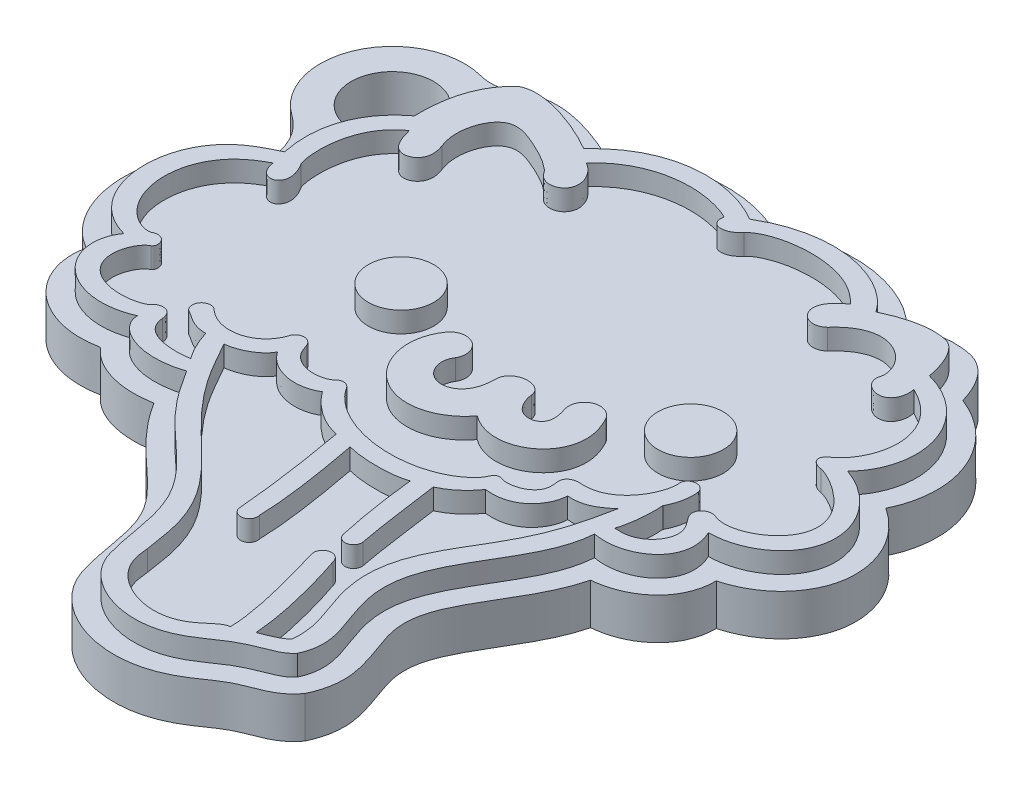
ISO-10303-21;
HEADER;
FILE_DESCRIPTION(('STEP AP214'),'2;1');
FILE_NAME('part.step','',(''),(''),'','','');
FILE_SCHEMA(('AUTOMOTIVE_DESIGN { 1 0 10303 214 1 1 1 1 }'));
ENDSEC;
DATA;
#1=APPLICATION_CONTEXT('core data for automotive mechanical design processes');
#2=APPLICATION_PROTOCOL_DEFINITION('international standard','automotive_design',2000,#1);
#3=PRODUCT_CONTEXT('',#1,'mechanical');
#4=PRODUCT('Part','Part','',(#3));
#5=PRODUCT_RELATED_PRODUCT_CATEGORY('part','',(#4));
#6=PRODUCT_DEFINITION_FORMATION('','',#4);
#7=PRODUCT_DEFINITION_CONTEXT('part definition',#1,'design');
#8=PRODUCT_DEFINITION('design','',#6,#7);
#9=PRODUCT_DEFINITION_SHAPE('','',#8);
#10=(LENGTH_UNIT() NAMED_UNIT(*) SI_UNIT(.MILLI.,.METRE.));
#11=(NAMED_UNIT(*) PLANE_ANGLE_UNIT() SI_UNIT($,.RADIAN.));
#12=(NAMED_UNIT(*) SI_UNIT($,.STERADIAN.) SOLID_ANGLE_UNIT());
#13=UNCERTAINTY_MEASURE_WITH_UNIT(LENGTH_MEASURE(1.E-05),#10,'distance_accuracy_value','');
#14=(GEOMETRIC_REPRESENTATION_CONTEXT(3) GLOBAL_UNCERTAINTY_ASSIGNED_CONTEXT((#13)) GLOBAL_UNIT_ASSIGNED_CONTEXT((#10,
#11,#12)) REPRESENTATION_CONTEXT('',''));
#15=CARTESIAN_POINT('',(0.,0.,0.));
#16=DIRECTION('',(0.,0.,1.));
#17=DIRECTION('',(1.,0.,0.));
#18=AXIS2_PLACEMENT_3D('',#15,#16,#17);
#19=CARTESIAN_POINT('',(-13.94802522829,3.,-6.34705292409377));
#20=CARTESIAN_POINT('',(-14.4919750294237,3.,-8.99697417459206));
#21=CARTESIAN_POINT('',(-13.0980680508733,3.,-10.4135463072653));
#22=CARTESIAN_POINT('',(-12.3071853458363,3.,-11.0065101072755));
#23=B_SPLINE_CURVE_WITH_KNOTS('',3,(#19,#20,#21,#22),.UNSPECIFIED.,.F.,.F.,(4,4),(0.,1.),.UNSPECIFIED.);
#24=DIRECTION('',(0.,-1.,0.));
#25=VECTOR('',#24,1.);
#26=SURFACE_OF_LINEAR_EXTRUSION('',#23,#25);
#27=DIRECTION('',(0.,-1.,0.));
#28=VECTOR('',#27,1.);
#29=CARTESIAN_POINT('',(-12.3071853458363,3.,-11.0065101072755));
#30=LINE('',#29,#28);
#31=CARTESIAN_POINT('',(-12.3071853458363,3.,-11.0065101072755));
#32=VERTEX_POINT('',#31);
#33=CARTESIAN_POINT('',(-12.3071853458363,2.,-11.0065101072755));
#34=VERTEX_POINT('',#33);
#35=EDGE_CURVE('E1676',#32,#34,#30,.T.);
#36=ORIENTED_EDGE('',*,*,#35,.T.);
#37=CARTESIAN_POINT('',(-13.94802522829,2.,-6.34705292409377));
#38=CARTESIAN_POINT('',(-14.4919750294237,2.,-8.99697417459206));
#39=CARTESIAN_POINT('',(-13.0980680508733,2.,-10.4135463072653));
#40=CARTESIAN_POINT('',(-12.3071853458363,2.,-11.0065101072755));
#41=B_SPLINE_CURVE_WITH_KNOTS('',3,(#37,#38,#39,#40),.UNSPECIFIED.,.F.,.F.,(4,4),(0.,1.),.UNSPECIFIED.);
#42=CARTESIAN_POINT('',(-12.8576793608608,2.,-10.5242977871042));
#43=VERTEX_POINT('',#42);
#44=EDGE_CURVE('E896',#34,#43,#41,.F.);
#45=ORIENTED_EDGE('',*,*,#44,.T.);
#46=CARTESIAN_POINT('',(-13.94802522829,2.,-6.34705292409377));
#47=VERTEX_POINT('',#46);
#48=EDGE_CURVE('E900',#43,#47,#41,.F.);
#49=ORIENTED_EDGE('',*,*,#48,.T.);
#50=DIRECTION('',(0.,-1.,0.));
#51=VECTOR('',#50,1.);
#52=CARTESIAN_POINT('',(-13.94802522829,3.,-6.34705292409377));
#53=LINE('',#52,#51);
#54=CARTESIAN_POINT('',(-13.94802522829,3.,-6.34705292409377));
#55=VERTEX_POINT('',#54);
#56=EDGE_CURVE('E1720',#55,#47,#53,.T.);
#57=ORIENTED_EDGE('',*,*,#56,.F.);
#58=EDGE_CURVE('E2142',#55,#32,#23,.T.);
#59=ORIENTED_EDGE('',*,*,#58,.T.);
#60=EDGE_LOOP('',(#36,#45,#49,#57,#59));
#61=FACE_BOUND('',#60,.T.);
#62=ADVANCED_FACE('F876',(#61),#26,.T.);
#63=CARTESIAN_POINT('',(-14.4072104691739,3.,0.983696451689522));
#64=CARTESIAN_POINT('',(-17.8267348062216,3.,0.068115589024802));
#65=CARTESIAN_POINT('',(-17.3628687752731,3.,-4.7580650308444));
#66=CARTESIAN_POINT('',(-15.6653164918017,3.,-5.53775474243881));
#67=CARTESIAN_POINT('',(-13.94802522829,3.,-6.34705292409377));
#68=B_SPLINE_CURVE_WITH_KNOTS('',4,(#63,#64,#65,#66,#67),.UNSPECIFIED.,.F.,.F.,(5,5),(0.,1.),.UNSPECIFIED.);
#69=DIRECTION('',(0.,-1.,0.));
#70=VECTOR('',#69,1.);
#71=SURFACE_OF_LINEAR_EXTRUSION('',#68,#70);
#72=ORIENTED_EDGE('',*,*,#56,.T.);
#73=CARTESIAN_POINT('',(-14.4072104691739,2.,0.983696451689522));
#74=CARTESIAN_POINT('',(-17.8267348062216,2.,0.068115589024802));
#75=CARTESIAN_POINT('',(-17.3628687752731,2.,-4.7580650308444));
#76=CARTESIAN_POINT('',(-15.6653164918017,2.,-5.53775474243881));
#77=CARTESIAN_POINT('',(-13.94802522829,2.,-6.34705292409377));
#78=B_SPLINE_CURVE_WITH_KNOTS('',4,(#73,#74,#75,#76,#77),.UNSPECIFIED.,.F.,.F.,(5,5),(0.,1.),.UNSPECIFIED.);
#79=CARTESIAN_POINT('',(-14.4072104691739,2.,0.983696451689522));
#80=VERTEX_POINT('',#79);
#81=EDGE_CURVE('E4007',#47,#80,#78,.F.);
#82=ORIENTED_EDGE('',*,*,#81,.T.);
#83=DIRECTION('',(0.,-1.,0.));
#84=VECTOR('',#83,1.);
#85=CARTESIAN_POINT('',(-14.4072104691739,3.,0.983696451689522));
#86=LINE('',#85,#84);
#87=CARTESIAN_POINT('',(-14.4072104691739,3.,0.983696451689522));
#88=VERTEX_POINT('',#87);
#89=EDGE_CURVE('E1717',#88,#80,#86,.T.);
#90=ORIENTED_EDGE('',*,*,#89,.F.);
#91=EDGE_CURVE('E2148',#88,#55,#68,.T.);
#92=ORIENTED_EDGE('',*,*,#91,.T.);
#93=EDGE_LOOP('',(#72,#82,#90,#92));
#94=FACE_BOUND('',#93,.T.);
#95=ADVANCED_FACE('F2127',(#94),#71,.T.);
#96=CARTESIAN_POINT('',(-10.6266398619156,3.,4.10588589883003));
#97=CARTESIAN_POINT('',(-12.9758548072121,3.,5.14931761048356));
#98=CARTESIAN_POINT('',(-15.3395606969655,3.,3.65946662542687));
#99=CARTESIAN_POINT('',(-15.0243999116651,3.,1.76850191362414));
#100=CARTESIAN_POINT('',(-14.4072104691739,3.,0.983696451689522));
#101=B_SPLINE_CURVE_WITH_KNOTS('',4,(#96,#97,#98,#99,#100),.UNSPECIFIED.,.F.,.F.,(5,5),(0.,1.),.UNSPECIFIED.);
#102=DIRECTION('',(0.,-1.,0.));
#103=VECTOR('',#102,1.);
#104=SURFACE_OF_LINEAR_EXTRUSION('',#101,#103);
#105=ORIENTED_EDGE('',*,*,#89,.T.);
#106=CARTESIAN_POINT('',(-10.6266398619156,2.,4.10588589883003));
#107=CARTESIAN_POINT('',(-12.9758548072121,2.,5.14931761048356));
#108=CARTESIAN_POINT('',(-15.3395606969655,2.,3.65946662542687));
#109=CARTESIAN_POINT('',(-15.0243999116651,2.,1.76850191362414));
#110=CARTESIAN_POINT('',(-14.4072104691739,2.,0.983696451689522));
#111=B_SPLINE_CURVE_WITH_KNOTS('',4,(#106,#107,#108,#109,#110),.UNSPECIFIED.,.F.,.F.,(5,5),(0.,
1.),.UNSPECIFIED.);
#112=CARTESIAN_POINT('',(-10.6266398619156,2.,4.10588589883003));
#113=VERTEX_POINT('',#112);
#114=EDGE_CURVE('E4001',#80,#113,#111,.F.);
#115=ORIENTED_EDGE('',*,*,#114,.T.);
#116=DIRECTION('',(0.,-1.,0.));
#117=VECTOR('',#116,1.);
#118=CARTESIAN_POINT('',(-10.6266398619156,3.,4.10588589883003));
#119=LINE('',#118,#117);
#120=CARTESIAN_POINT('',(-10.6266398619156,3.,4.10588589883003));
#121=VERTEX_POINT('',#120);
#122=EDGE_CURVE('E1714',#121,#113,#119,.T.);
#123=ORIENTED_EDGE('',*,*,#122,.F.);
#124=EDGE_CURVE('E2159',#121,#88,#101,.T.);
#125=ORIENTED_EDGE('',*,*,#124,.T.);
#126=EDGE_LOOP('',(#105,#115,#123,#125));
#127=FACE_BOUND('',#126,.T.);
#128=ADVANCED_FACE('F2133',(#127),#104,.T.);
#129=CARTESIAN_POINT('',(-7.1155173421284,3.,5.23560054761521));
#130=CARTESIAN_POINT('',(-8.90887046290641,3.,5.85064813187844));
#131=CARTESIAN_POINT('',(-10.6188805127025,3.,5.11402841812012));
#132=CARTESIAN_POINT('',(-10.6266398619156,3.,4.10588589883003));
#133=B_SPLINE_CURVE_WITH_KNOTS('',3,(#129,#130,#131,#132),.UNSPECIFIED.,.F.,.F.,(4,4),(0.,1.),.UNSPECIFIED.);
#134=DIRECTION('',(0.,-1.,0.));
#135=VECTOR('',#134,1.);
#136=SURFACE_OF_LINEAR_EXTRUSION('',#133,#135);
#137=ORIENTED_EDGE('',*,*,#122,.T.);
#138=CARTESIAN_POINT('',(-7.1155173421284,2.,5.23560054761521));
#139=CARTESIAN_POINT('',(-8.90887046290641,2.,5.85064813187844));
#140=CARTESIAN_POINT('',(-10.6188805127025,2.,5.11402841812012));
#141=CARTESIAN_POINT('',(-10.6266398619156,2.,4.10588589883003));
#142=B_SPLINE_CURVE_WITH_KNOTS('',3,(#138,#139,#140,#141),.UNSPECIFIED.,.F.,.F.,(4,4),(0.,1.),.UNSPECIFIED.);
#143=CARTESIAN_POINT('',(-7.1155173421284,2.,5.23560054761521));
#144=VERTEX_POINT('',#143);
#145=EDGE_CURVE('E3994',#113,#144,#142,.F.);
#146=ORIENTED_EDGE('',*,*,#145,.T.);
#147=DIRECTION('',(0.,-1.,0.));
#148=VECTOR('',#147,1.);
#149=CARTESIAN_POINT('',(-7.1155173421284,3.,5.23560054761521));
#150=LINE('',#149,#148);
#151=CARTESIAN_POINT('',(-7.1155173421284,3.,5.23560054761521));
#152=VERTEX_POINT('',#151);
#153=EDGE_CURVE('E1711',#152,#144,#150,.T.);
#154=ORIENTED_EDGE('',*,*,#153,.F.);
#155=EDGE_CURVE('E2168',#152,#121,#133,.T.);
#156=ORIENTED_EDGE('',*,*,#155,.T.);
#157=EDGE_LOOP('',(#137,#146,#154,#156));
#158=FACE_BOUND('',#157,.T.);
#159=ADVANCED_FACE('F2178',(#158),#136,.T.);
#160=CARTESIAN_POINT('',(-1.317685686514,3.,14.7337669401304));
#161=CARTESIAN_POINT('',(-2.03264211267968,3.,12.2341322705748));
#162=CARTESIAN_POINT('',(-1.54734246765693,3.,10.5738966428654));
#163=CARTESIAN_POINT('',(-2.92661514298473,3.,8.99028727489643));
#164=CARTESIAN_POINT('',(-5.68516049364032,3.,8.41559032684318));
#165=CARTESIAN_POINT('',(-6.37479683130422,3.,6.19342879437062));
#166=CARTESIAN_POINT('',(-7.1155173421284,3.,5.23560054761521));
#167=B_SPLINE_CURVE_WITH_KNOTS('',6,(#160,#161,#162,#163,#164,#165,#166),.UNSPECIFIED.,.F.,.F.,
(7,7),(0.,1.),.UNSPECIFIED.);
#168=DIRECTION('',(0.,-1.,0.));
#169=VECTOR('',#168,1.);
#170=SURFACE_OF_LINEAR_EXTRUSION('',#167,#169);
#171=ORIENTED_EDGE('',*,*,#153,.T.);
#172=CARTESIAN_POINT('',(-1.317685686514,2.,14.7337669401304));
#173=CARTESIAN_POINT('',(-2.03264211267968,2.,12.2341322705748));
#174=CARTESIAN_POINT('',(-1.54734246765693,2.,10.5738966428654));
#175=CARTESIAN_POINT('',(-2.92661514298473,2.,8.99028727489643));
#176=CARTESIAN_POINT('',(-5.68516049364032,2.,8.41559032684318));
#177=CARTESIAN_POINT('',(-6.37479683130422,2.,6.19342879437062));
#178=CARTESIAN_POINT('',(-7.1155173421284,2.,5.23560054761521));
#179=B_SPLINE_CURVE_WITH_KNOTS('',6,(#172,#173,#174,#175,#176,#177,#178),.UNSPECIFIED.,.F.,.F.,
(7,7),(0.,1.),.UNSPECIFIED.);
#180=CARTESIAN_POINT('',(-1.317685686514,2.,14.7337669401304));
#181=VERTEX_POINT('',#180);
#182=EDGE_CURVE('E3987',#144,#181,#179,.F.);
#183=ORIENTED_EDGE('',*,*,#182,.T.);
#184=DIRECTION('',(0.,-1.,0.));
#185=VECTOR('',#184,1.);
#186=CARTESIAN_POINT('',(-1.317685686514,3.,14.7337669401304));
#187=LINE('',#186,#185);
#188=CARTESIAN_POINT('',(-1.317685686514,3.,14.7337669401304));
#189=VERTEX_POINT('',#188);
#190=EDGE_CURVE('E1708',#189,#181,#187,.T.);
#191=ORIENTED_EDGE('',*,*,#190,.F.);
#192=EDGE_CURVE('E2190',#189,#152,#167,.T.);
#193=ORIENTED_EDGE('',*,*,#192,.T.);
#194=EDGE_LOOP('',(#171,#183,#191,#193));
#195=FACE_BOUND('',#194,.T.);
#196=ADVANCED_FACE('F2182',(#195),#170,.T.);
#197=CARTESIAN_POINT('',(7.43664265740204,3.,14.3973816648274));
#198=CARTESIAN_POINT('',(6.43252358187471,3.,15.6828990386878));
#199=CARTESIAN_POINT('',(3.53249646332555,3.,14.45757684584));
#200=CARTESIAN_POINT('',(6.06527321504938,3.,17.9753223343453));
#201=CARTESIAN_POINT('',(-0.426139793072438,3.,18.0222256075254));
#202=CARTESIAN_POINT('',(-1.317685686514,3.,14.7337669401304));
#203=B_SPLINE_CURVE_WITH_KNOTS('',5,(#197,#198,#199,#200,#201,#202),.UNSPECIFIED.,.F.,.F.,(6,6),
(0.,1.),.UNSPECIFIED.);
#204=DIRECTION('',(0.,-1.,0.));
#205=VECTOR('',#204,1.);
#206=SURFACE_OF_LINEAR_EXTRUSION('',#203,#205);
#207=ORIENTED_EDGE('',*,*,#190,.T.);
#208=CARTESIAN_POINT('',(7.43664265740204,2.,14.3973816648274));
#209=CARTESIAN_POINT('',(6.43252358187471,2.,15.6828990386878));
#210=CARTESIAN_POINT('',(3.53249646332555,2.,14.45757684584));
#211=CARTESIAN_POINT('',(6.06527321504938,2.,17.9753223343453));
#212=CARTESIAN_POINT('',(-0.426139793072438,2.,18.0222256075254));
#213=CARTESIAN_POINT('',(-1.317685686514,2.,14.7337669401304));
#214=B_SPLINE_CURVE_WITH_KNOTS('',5,(#208,#209,#210,#211,#212,#213),.UNSPECIFIED.,.F.,.F.,(6,6),
(0.,1.),.UNSPECIFIED.);
#215=CARTESIAN_POINT('',(7.43664265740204,2.,14.3973816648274));
#216=VERTEX_POINT('',#215);
#217=EDGE_CURVE('E3980',#181,#216,#214,.F.);
#218=ORIENTED_EDGE('',*,*,#217,.T.);
#219=DIRECTION('',(0.,-1.,0.));
#220=VECTOR('',#219,1.);
#221=CARTESIAN_POINT('',(7.43664265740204,3.,14.3973816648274));
#222=LINE('',#221,#220);
#223=CARTESIAN_POINT('',(7.43664265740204,3.,14.3973816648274));
#224=VERTEX_POINT('',#223);
#225=EDGE_CURVE('E1705',#224,#216,#222,.T.);
#226=ORIENTED_EDGE('',*,*,#225,.F.);
#227=EDGE_CURVE('E2195',#224,#189,#203,.T.);
#228=ORIENTED_EDGE('',*,*,#227,.T.);
#229=EDGE_LOOP('',(#207,#218,#226,#228));
#230=FACE_BOUND('',#229,.T.);
#231=ADVANCED_FACE('F2186',(#230),#206,.T.);
#232=CARTESIAN_POINT('',(9.62833811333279,3.,2.18690555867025));
#233=CARTESIAN_POINT('',(9.37699520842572,3.,5.77631136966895));
#234=CARTESIAN_POINT('',(5.40283884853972,3.,7.85161077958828));
#235=CARTESIAN_POINT('',(5.6308113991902,3.,10.6799827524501));
#236=CARTESIAN_POINT('',(8.56587959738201,3.,11.8856336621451));
#237=CARTESIAN_POINT('',(7.43664265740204,3.,14.3973816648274));
#238=B_SPLINE_CURVE_WITH_KNOTS('',5,(#232,#233,#234,#235,#236,#237),.UNSPECIFIED.,.F.,.F.,(6,6),
(0.,1.),.UNSPECIFIED.);
#239=DIRECTION('',(0.,-1.,0.));
#240=VECTOR('',#239,1.);
#241=SURFACE_OF_LINEAR_EXTRUSION('',#238,#240);
#242=ORIENTED_EDGE('',*,*,#225,.T.);
#243=CARTESIAN_POINT('',(9.62833811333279,2.,2.18690555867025));
#244=CARTESIAN_POINT('',(9.37699520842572,2.,5.77631136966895));
#245=CARTESIAN_POINT('',(5.40283884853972,2.,7.85161077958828));
#246=CARTESIAN_POINT('',(5.6308113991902,2.,10.6799827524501));
#247=CARTESIAN_POINT('',(8.56587959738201,2.,11.8856336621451));
#248=CARTESIAN_POINT('',(7.43664265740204,2.,14.3973816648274));
#249=B_SPLINE_CURVE_WITH_KNOTS('',5,(#243,#244,#245,#246,#247,#248),.UNSPECIFIED.,.F.,.F.,(6,6),
(0.,1.),.UNSPECIFIED.);
#250=CARTESIAN_POINT('',(9.62833811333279,2.,2.18690555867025));
#251=VERTEX_POINT('',#250);
#252=EDGE_CURVE('E3973',#216,#251,#249,.F.);
#253=ORIENTED_EDGE('',*,*,#252,.T.);
#254=DIRECTION('',(0.,-1.,0.));
#255=VECTOR('',#254,1.);
#256=CARTESIAN_POINT('',(9.62833811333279,3.,2.18690555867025));
#257=LINE('',#256,#255);
#258=CARTESIAN_POINT('',(9.62833811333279,3.,2.18690555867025));
#259=VERTEX_POINT('',#258);
#260=EDGE_CURVE('E1702',#259,#251,#257,.T.);
#261=ORIENTED_EDGE('',*,*,#260,.F.);
#262=EDGE_CURVE('E2204',#259,#224,#238,.T.);
#263=ORIENTED_EDGE('',*,*,#262,.T.);
#264=EDGE_LOOP('',(#242,#253,#261,#263));
#265=FACE_BOUND('',#264,.T.);
#266=ADVANCED_FACE('F2221',(#265),#241,.T.);
#267=CARTESIAN_POINT('',(12.3360133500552,3.,-0.63313613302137));
#268=CARTESIAN_POINT('',(13.1976440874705,3.,1.23822160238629));
#269=CARTESIAN_POINT('',(11.2976472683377,3.,2.50168748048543));
#270=CARTESIAN_POINT('',(9.62833811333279,3.,2.18690555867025));
#271=B_SPLINE_CURVE_WITH_KNOTS('',3,(#267,#268,#269,#270),.UNSPECIFIED.,.F.,.F.,(4,4),(0.,1.),.UNSPECIFIED.);
#272=DIRECTION('',(0.,-1.,0.));
#273=VECTOR('',#272,1.);
#274=SURFACE_OF_LINEAR_EXTRUSION('',#271,#273);
#275=ORIENTED_EDGE('',*,*,#260,.T.);
#276=CARTESIAN_POINT('',(12.3360133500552,2.,-0.63313613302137));
#277=CARTESIAN_POINT('',(13.1976440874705,2.,1.23822160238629));
#278=CARTESIAN_POINT('',(11.2976472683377,2.,2.50168748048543));
#279=CARTESIAN_POINT('',(9.62833811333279,2.,2.18690555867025));
#280=B_SPLINE_CURVE_WITH_KNOTS('',3,(#276,#277,#278,#279),.UNSPECIFIED.,.F.,.F.,(4,4),(0.,1.),.UNSPECIFIED.);
#281=CARTESIAN_POINT('',(12.3360133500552,2.,-0.63313613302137));
#282=VERTEX_POINT('',#281);
#283=EDGE_CURVE('E3966',#251,#282,#280,.F.);
#284=ORIENTED_EDGE('',*,*,#283,.T.);
#285=DIRECTION('',(0.,-1.,0.));
#286=VECTOR('',#285,1.);
#287=CARTESIAN_POINT('',(12.3360133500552,3.,-0.63313613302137));
#288=LINE('',#287,#286);
#289=CARTESIAN_POINT('',(12.3360133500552,3.,-0.63313613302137));
#290=VERTEX_POINT('',#289);
#291=EDGE_CURVE('E1699',#290,#282,#288,.T.);
#292=ORIENTED_EDGE('',*,*,#291,.F.);
#293=EDGE_CURVE('E2213',#290,#259,#271,.T.);
#294=ORIENTED_EDGE('',*,*,#293,.T.);
#295=EDGE_LOOP('',(#275,#284,#292,#294));
#296=FACE_BOUND('',#295,.T.);
#297=ADVANCED_FACE('F2224',(#296),#274,.T.);
#298=CARTESIAN_POINT('',(13.1193090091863,3.,-6.59527301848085));
#299=CARTESIAN_POINT('',(15.8032840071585,3.,-5.66453266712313));
#300=CARTESIAN_POINT('',(17.2303864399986,3.,-2.41735756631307));
#301=CARTESIAN_POINT('',(14.3658402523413,3.,-0.607626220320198));
#302=CARTESIAN_POINT('',(12.3360133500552,3.,-0.63313613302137));
#303=B_SPLINE_CURVE_WITH_KNOTS('',4,(#298,#299,#300,#301,#302),.UNSPECIFIED.,.F.,.F.,(5,5),(0.,
1.),.UNSPECIFIED.);
#304=DIRECTION('',(0.,-1.,0.));
#305=VECTOR('',#304,1.);
#306=SURFACE_OF_LINEAR_EXTRUSION('',#303,#305);
#307=ORIENTED_EDGE('',*,*,#291,.T.);
#308=CARTESIAN_POINT('',(13.1193090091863,2.,-6.59527301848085));
#309=CARTESIAN_POINT('',(15.8032840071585,2.,-5.66453266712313));
#310=CARTESIAN_POINT('',(17.2303864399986,2.,-2.41735756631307));
#311=CARTESIAN_POINT('',(14.3658402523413,2.,-0.607626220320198));
#312=CARTESIAN_POINT('',(12.3360133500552,2.,-0.63313613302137));
#313=B_SPLINE_CURVE_WITH_KNOTS('',4,(#308,#309,#310,#311,#312),.UNSPECIFIED.,.F.,.F.,(5,5),(0.,
1.),.UNSPECIFIED.);
#314=CARTESIAN_POINT('',(13.1193090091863,2.,-6.59527301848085));
#315=VERTEX_POINT('',#314);
#316=EDGE_CURVE('E3959',#282,#315,#313,.F.);
#317=ORIENTED_EDGE('',*,*,#316,.T.);
#318=DIRECTION('',(0.,-1.,0.));
#319=VECTOR('',#318,1.);
#320=CARTESIAN_POINT('',(13.1193090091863,3.,-6.59527301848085));
#321=LINE('',#320,#319);
#322=CARTESIAN_POINT('',(13.1193090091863,3.,-6.59527301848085));
#323=VERTEX_POINT('',#322);
#324=EDGE_CURVE('E1696',#323,#315,#321,.T.);
#325=ORIENTED_EDGE('',*,*,#324,.F.);
#326=EDGE_CURVE('E2236',#323,#290,#303,.T.);
#327=ORIENTED_EDGE('',*,*,#326,.T.);
#328=EDGE_LOOP('',(#307,#317,#325,#327));
#329=FACE_BOUND('',#328,.T.);
#330=ADVANCED_FACE('F2228',(#329),#306,.T.);
#331=CARTESIAN_POINT('',(11.1059387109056,3.,-12.5810213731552));
#332=CARTESIAN_POINT('',(13.720909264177,3.,-11.9002934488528));
#333=CARTESIAN_POINT('',(14.9879158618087,3.,-9.35716509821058));
#334=CARTESIAN_POINT('',(13.9032123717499,3.,-7.32448544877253));
#335=CARTESIAN_POINT('',(13.1193090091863,3.,-6.59527301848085));
#336=B_SPLINE_CURVE_WITH_KNOTS('',4,(#331,#332,#333,#334,#335),.UNSPECIFIED.,.F.,.F.,(5,5),(0.,
1.),.UNSPECIFIED.);
#337=DIRECTION('',(0.,-1.,0.));
#338=VECTOR('',#337,1.);
#339=SURFACE_OF_LINEAR_EXTRUSION('',#336,#338);
#340=ORIENTED_EDGE('',*,*,#324,.T.);
#341=CARTESIAN_POINT('',(11.1059387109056,2.,-12.5810213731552));
#342=CARTESIAN_POINT('',(13.720909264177,2.,-11.9002934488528));
#343=CARTESIAN_POINT('',(14.9879158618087,2.,-9.35716509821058));
#344=CARTESIAN_POINT('',(13.9032123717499,2.,-7.32448544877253));
#345=CARTESIAN_POINT('',(13.1193090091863,2.,-6.59527301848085));
#346=B_SPLINE_CURVE_WITH_KNOTS('',4,(#341,#342,#343,#344,#345),.UNSPECIFIED.,.F.,.F.,(5,5),(0.,
1.),.UNSPECIFIED.);
#347=CARTESIAN_POINT('',(11.1059387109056,2.,-12.5810213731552));
#348=VERTEX_POINT('',#347);
#349=EDGE_CURVE('E3952',#315,#348,#346,.F.);
#350=ORIENTED_EDGE('',*,*,#349,.T.);
#351=DIRECTION('',(0.,-1.,0.));
#352=VECTOR('',#351,1.);
#353=CARTESIAN_POINT('',(11.1059387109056,3.,-12.5810213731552));
#354=LINE('',#353,#352);
#355=CARTESIAN_POINT('',(11.1059387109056,3.,-12.5810213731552));
#356=VERTEX_POINT('',#355);
#357=EDGE_CURVE('E1693',#356,#348,#354,.T.);
#358=ORIENTED_EDGE('',*,*,#357,.F.);
#359=EDGE_CURVE('E2241',#356,#323,#336,.T.);
#360=ORIENTED_EDGE('',*,*,#359,.T.);
#361=EDGE_LOOP('',(#340,#350,#358,#360));
#362=FACE_BOUND('',#361,.T.);
#363=ADVANCED_FACE('F2232',(#362),#339,.T.);
#364=CARTESIAN_POINT('',(10.0037414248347,3.,-14.4843752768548));
#365=CARTESIAN_POINT('',(10.4553024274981,3.,-14.3435659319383));
#366=CARTESIAN_POINT('',(10.8874414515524,3.,-13.7172071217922));
#367=CARTESIAN_POINT('',(11.1059387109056,3.,-12.5810213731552));
#368=B_SPLINE_CURVE_WITH_KNOTS('',3,(#364,#365,#366,#367),.UNSPECIFIED.,.F.,.F.,(4,4),(0.,1.),.UNSPECIFIED.);
#369=DIRECTION('',(0.,-1.,0.));
#370=VECTOR('',#369,1.);
#371=SURFACE_OF_LINEAR_EXTRUSION('',#368,#370);
#372=ORIENTED_EDGE('',*,*,#357,.T.);
#373=CARTESIAN_POINT('',(10.0037414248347,2.,-14.4843752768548));
#374=CARTESIAN_POINT('',(10.4553024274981,2.,-14.3435659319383));
#375=CARTESIAN_POINT('',(10.8874414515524,2.,-13.7172071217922));
#376=CARTESIAN_POINT('',(11.1059387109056,2.,-12.5810213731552));
#377=B_SPLINE_CURVE_WITH_KNOTS('',3,(#373,#374,#375,#376),.UNSPECIFIED.,.F.,.F.,(4,4),(0.,1.),.UNSPECIFIED.);
#378=CARTESIAN_POINT('',(10.0037414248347,2.,-14.4843752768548));
#379=VERTEX_POINT('',#378);
#380=EDGE_CURVE('E3945',#348,#379,#377,.F.);
#381=ORIENTED_EDGE('',*,*,#380,.T.);
#382=DIRECTION('',(0.,-1.,0.));
#383=VECTOR('',#382,1.);
#384=CARTESIAN_POINT('',(10.0037414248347,3.,-14.4843752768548));
#385=LINE('',#384,#383);
#386=CARTESIAN_POINT('',(10.0037414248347,3.,-14.4843752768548));
#387=VERTEX_POINT('',#386);
#388=EDGE_CURVE('E1690',#387,#379,#385,.T.);
#389=ORIENTED_EDGE('',*,*,#388,.F.);
#390=EDGE_CURVE('E2250',#387,#356,#368,.T.);
#391=ORIENTED_EDGE('',*,*,#390,.T.);
#392=EDGE_LOOP('',(#372,#381,#389,#391));
#393=FACE_BOUND('',#392,.T.);
#394=ADVANCED_FACE('F2267',(#393),#371,.T.);
#395=CARTESIAN_POINT('',(7.11957760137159,3.,-13.9648373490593));
#396=CARTESIAN_POINT('',(8.78501226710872,3.,-14.7659939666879));
#397=CARTESIAN_POINT('',(10.0037414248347,3.,-14.4843752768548));
#398=B_SPLINE_CURVE_WITH_KNOTS('',2,(#395,#396,#397),.UNSPECIFIED.,.F.,.F.,(3,3),(0.,1.),.UNSPECIFIED.);
#399=DIRECTION('',(0.,-1.,0.));
#400=VECTOR('',#399,1.);
#401=SURFACE_OF_LINEAR_EXTRUSION('',#398,#400);
#402=ORIENTED_EDGE('',*,*,#388,.T.);
#403=CARTESIAN_POINT('',(7.11957760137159,2.,-13.9648373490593));
#404=CARTESIAN_POINT('',(8.78501226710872,2.,-14.7659939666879));
#405=CARTESIAN_POINT('',(10.0037414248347,2.,-14.4843752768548));
#406=B_SPLINE_CURVE_WITH_KNOTS('',2,(#403,#404,#405),.UNSPECIFIED.,.F.,.F.,(3,3),(0.,1.),.UNSPECIFIED.);
#407=CARTESIAN_POINT('',(7.11957760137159,2.,-13.9648373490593));
#408=VERTEX_POINT('',#407);
#409=EDGE_CURVE('E3938',#379,#408,#406,.F.);
#410=ORIENTED_EDGE('',*,*,#409,.T.);
#411=DIRECTION('',(0.,-1.,0.));
#412=VECTOR('',#411,1.);
#413=CARTESIAN_POINT('',(7.11957760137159,3.,-13.9648373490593));
#414=LINE('',#413,#412);
#415=CARTESIAN_POINT('',(7.11957760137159,3.,-13.9648373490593));
#416=VERTEX_POINT('',#415);
#417=EDGE_CURVE('E1687',#416,#408,#414,.T.);
#418=ORIENTED_EDGE('',*,*,#417,.F.);
#419=EDGE_CURVE('E2259',#416,#387,#398,.T.);
#420=ORIENTED_EDGE('',*,*,#419,.T.);
#421=EDGE_LOOP('',(#402,#410,#418,#420));
#422=FACE_BOUND('',#421,.T.);
#423=ADVANCED_FACE('F2270',(#422),#401,.T.);
#424=CARTESIAN_POINT('',(0.161951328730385,3.,-14.8022447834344));
#425=CARTESIAN_POINT('',(3.12503912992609,3.,-16.5641231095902));
#426=CARTESIAN_POINT('',(6.13222948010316,3.,-15.4651992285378));
#427=CARTESIAN_POINT('',(7.11957760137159,3.,-13.9648373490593));
#428=B_SPLINE_CURVE_WITH_KNOTS('',3,(#424,#425,#426,#427),.UNSPECIFIED.,.F.,.F.,(4,4),(0.,1.),.UNSPECIFIED.);
#429=DIRECTION('',(0.,-1.,0.));
#430=VECTOR('',#429,1.);
#431=SURFACE_OF_LINEAR_EXTRUSION('',#428,#430);
#432=ORIENTED_EDGE('',*,*,#417,.T.);
#433=CARTESIAN_POINT('',(0.161951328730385,2.,-14.8022447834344));
#434=CARTESIAN_POINT('',(3.12503912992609,2.,-16.5641231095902));
#435=CARTESIAN_POINT('',(6.13222948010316,2.,-15.4651992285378));
#436=CARTESIAN_POINT('',(7.11957760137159,2.,-13.9648373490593));
#437=B_SPLINE_CURVE_WITH_KNOTS('',3,(#433,#434,#435,#436),.UNSPECIFIED.,.F.,.F.,(4,4),(0.,1.),.UNSPECIFIED.);
#438=CARTESIAN_POINT('',(0.161951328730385,2.,-14.8022447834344));
#439=VERTEX_POINT('',#438);
#440=EDGE_CURVE('E3931',#408,#439,#437,.F.);
#441=ORIENTED_EDGE('',*,*,#440,.T.);
#442=DIRECTION('',(0.,-1.,0.));
#443=VECTOR('',#442,1.);
#444=CARTESIAN_POINT('',(0.161951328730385,3.,-14.8022447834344));
#445=LINE('',#444,#443);
#446=CARTESIAN_POINT('',(0.161951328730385,3.,-14.8022447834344));
#447=VERTEX_POINT('',#446);
#448=EDGE_CURVE('E1684',#447,#439,#445,.T.);
#449=ORIENTED_EDGE('',*,*,#448,.F.);
#450=EDGE_CURVE('E2282',#447,#416,#428,.T.);
#451=ORIENTED_EDGE('',*,*,#450,.T.);
#452=EDGE_LOOP('',(#432,#441,#449,#451));
#453=FACE_BOUND('',#452,.T.);
#454=ADVANCED_FACE('F2274',(#453),#431,.T.);
#455=CARTESIAN_POINT('',(-6.82286298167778,3.,-13.7396548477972));
#456=CARTESIAN_POINT('',(-4.66228297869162,3.,-16.0953385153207));
#457=CARTESIAN_POINT('',(-1.720849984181,3.,-15.9248206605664));
#458=CARTESIAN_POINT('',(0.161951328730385,3.,-14.8022447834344));
#459=B_SPLINE_CURVE_WITH_KNOTS('',3,(#455,#456,#457,#458),.UNSPECIFIED.,.F.,.F.,(4,4),(0.,1.),.UNSPECIFIED.);
#460=DIRECTION('',(0.,-1.,0.));
#461=VECTOR('',#460,1.);
#462=SURFACE_OF_LINEAR_EXTRUSION('',#459,#461);
#463=ORIENTED_EDGE('',*,*,#448,.T.);
#464=CARTESIAN_POINT('',(-6.82286298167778,2.,-13.7396548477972));
#465=CARTESIAN_POINT('',(-4.66228297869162,2.,-16.0953385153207));
#466=CARTESIAN_POINT('',(-1.720849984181,2.,-15.9248206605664));
#467=CARTESIAN_POINT('',(0.161951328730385,2.,-14.8022447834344));
#468=B_SPLINE_CURVE_WITH_KNOTS('',3,(#464,#465,#466,#467),.UNSPECIFIED.,.F.,.F.,(4,4),(0.,1.),.UNSPECIFIED.);
#469=CARTESIAN_POINT('',(-6.82286298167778,2.,-13.7396548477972));
#470=VERTEX_POINT('',#469);
#471=EDGE_CURVE('E3924',#439,#470,#468,.F.);
#472=ORIENTED_EDGE('',*,*,#471,.T.);
#473=DIRECTION('',(0.,-1.,0.));
#474=VECTOR('',#473,1.);
#475=CARTESIAN_POINT('',(-6.82286298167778,3.,-13.7396548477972));
#476=LINE('',#475,#474);
#477=CARTESIAN_POINT('',(-6.82286298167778,3.,-13.7396548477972));
#478=VERTEX_POINT('',#477);
#479=EDGE_CURVE('E1681',#478,#470,#476,.T.);
#480=ORIENTED_EDGE('',*,*,#479,.F.);
#481=EDGE_CURVE('E2287',#478,#447,#459,.T.);
#482=ORIENTED_EDGE('',*,*,#481,.T.);
#483=EDGE_LOOP('',(#463,#472,#480,#482));
#484=FACE_BOUND('',#483,.T.);
#485=ADVANCED_FACE('F2278',(#484),#462,.T.);
#486=CARTESIAN_POINT('',(-11.0463399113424,3.,-14.756223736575));
#487=CARTESIAN_POINT('',(-10.2184126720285,3.,-15.2592681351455));
#488=CARTESIAN_POINT('',(-8.21671516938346,3.,-14.5466219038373));
#489=CARTESIAN_POINT('',(-6.82286298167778,3.,-13.7396548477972));
#490=B_SPLINE_CURVE_WITH_KNOTS('',3,(#486,#487,#488,#489),.UNSPECIFIED.,.F.,.F.,(4,4),(0.,1.),.UNSPECIFIED.);
#491=DIRECTION('',(0.,-1.,0.));
#492=VECTOR('',#491,1.);
#493=SURFACE_OF_LINEAR_EXTRUSION('',#490,#492);
#494=ORIENTED_EDGE('',*,*,#479,.T.);
#495=CARTESIAN_POINT('',(-11.0463399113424,2.,-14.756223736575));
#496=CARTESIAN_POINT('',(-10.2184126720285,2.,-15.2592681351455));
#497=CARTESIAN_POINT('',(-8.21671516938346,2.,-14.5466219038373));
#498=CARTESIAN_POINT('',(-6.82286298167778,2.,-13.7396548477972));
#499=B_SPLINE_CURVE_WITH_KNOTS('',3,(#495,#496,#497,#498),.UNSPECIFIED.,.F.,.F.,(4,4),(0.,1.),.UNSPECIFIED.);
#500=CARTESIAN_POINT('',(-11.0463399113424,2.,-14.756223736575));
#501=VERTEX_POINT('',#500);
#502=EDGE_CURVE('E3916',#470,#501,#499,.F.);
#503=ORIENTED_EDGE('',*,*,#502,.T.);
#504=DIRECTION('',(0.,-1.,0.));
#505=VECTOR('',#504,1.);
#506=CARTESIAN_POINT('',(-11.0463399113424,3.,-14.756223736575));
#507=LINE('',#506,#505);
#508=CARTESIAN_POINT('',(-11.0463399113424,3.,-14.756223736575));
#509=VERTEX_POINT('',#508);
#510=EDGE_CURVE('E1678',#509,#501,#507,.T.);
#511=ORIENTED_EDGE('',*,*,#510,.F.);
#512=EDGE_CURVE('E2296',#509,#478,#490,.T.);
#513=ORIENTED_EDGE('',*,*,#512,.T.);
#514=EDGE_LOOP('',(#494,#503,#511,#513));
#515=FACE_BOUND('',#514,.T.);
#516=ADVANCED_FACE('F2313',(#515),#493,.T.);
#517=CARTESIAN_POINT('',(-11.0463399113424,3.,-14.756223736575));
#518=CARTESIAN_POINT('',(-12.3773115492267,3.,-13.5195729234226));
#519=CARTESIAN_POINT('',(-12.3071853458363,3.,-11.0065101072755));
#520=B_SPLINE_CURVE_WITH_KNOTS('',2,(#517,#518,#519),.UNSPECIFIED.,.F.,.F.,(3,3),(0.,1.),.UNSPECIFIED.);
#521=DIRECTION('',(0.,-1.,0.));
#522=VECTOR('',#521,1.);
#523=SURFACE_OF_LINEAR_EXTRUSION('',#520,#522);
#524=CARTESIAN_POINT('',(-11.0463399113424,2.,-14.756223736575));
#525=CARTESIAN_POINT('',(-12.3773115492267,2.,-13.5195729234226));
#526=CARTESIAN_POINT('',(-12.3071853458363,2.,-11.0065101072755));
#527=B_SPLINE_CURVE_WITH_KNOTS('',2,(#524,#525,#526),.UNSPECIFIED.,.F.,.F.,(3,3),(0.,1.),.UNSPECIFIED.);
#528=CARTESIAN_POINT('',(-12.2932085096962,2.,-11.7861743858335));
#529=VERTEX_POINT('',#528);
#530=EDGE_CURVE('E3915',#34,#529,#527,.F.);
#531=ORIENTED_EDGE('',*,*,#530,.F.);
#532=ORIENTED_EDGE('',*,*,#35,.F.);
#533=EDGE_CURVE('E2305',#509,#32,#520,.T.);
#534=ORIENTED_EDGE('',*,*,#533,.F.);
#535=ORIENTED_EDGE('',*,*,#510,.T.);
#536=EDGE_CURVE('E3881',#529,#501,#527,.F.);
#537=ORIENTED_EDGE('',*,*,#536,.F.);
#538=EDGE_LOOP('',(#531,#532,#534,#535,#537));
#539=FACE_BOUND('',#538,.T.);
#540=ADVANCED_FACE('F2316',(#539),#523,.F.);
#541=CARTESIAN_POINT('',(9.13283203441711,3.,0.551245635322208));
#542=CARTESIAN_POINT('',(8.58656791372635,3.,3.37021770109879));
#543=CARTESIAN_POINT('',(7.92906882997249,3.,6.00760462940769));
#544=CARTESIAN_POINT('',(5.62586013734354,3.,6.27836226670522));
#545=CARTESIAN_POINT('',(4.5277756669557,3.,9.2465933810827));
#546=CARTESIAN_POINT('',(5.88489186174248,3.,11.1855271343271));
#547=CARTESIAN_POINT('',(6.85399901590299,3.,11.9199874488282));
#548=CARTESIAN_POINT('',(6.70917079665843,3.,13.8696224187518));
#549=B_SPLINE_CURVE_WITH_KNOTS('',7,(#541,#542,#543,#544,#545,#546,#547,#548),.UNSPECIFIED.,.F.,
.F.,(8,8),(0.,1.),.UNSPECIFIED.);
#550=DIRECTION('',(0.,-1.,0.));
#551=VECTOR('',#550,1.);
#552=SURFACE_OF_LINEAR_EXTRUSION('',#549,#551);
#553=DIRECTION('',(0.,-1.,0.));
#554=VECTOR('',#553,1.);
#555=CARTESIAN_POINT('',(9.13283203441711,3.,0.551245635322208));
#556=LINE('',#555,#554);
#557=CARTESIAN_POINT('',(9.13283203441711,3.,0.551245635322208));
#558=VERTEX_POINT('',#557);
#559=CARTESIAN_POINT('',(9.13283203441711,2.,0.551245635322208));
#560=VERTEX_POINT('',#559);
#561=EDGE_CURVE('E1722',#558,#560,#556,.T.);
#562=ORIENTED_EDGE('',*,*,#561,.T.);
#563=CARTESIAN_POINT('',(9.13283203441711,2.,0.551245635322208));
#564=CARTESIAN_POINT('',(8.58656791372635,2.,3.37021770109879));
#565=CARTESIAN_POINT('',(7.92906882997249,2.,6.00760462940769));
#566=CARTESIAN_POINT('',(5.62586013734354,2.,6.27836226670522));
#567=CARTESIAN_POINT('',(4.5277756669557,2.,9.2465933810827));
#568=CARTESIAN_POINT('',(5.88489186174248,2.,11.1855271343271));
#569=CARTESIAN_POINT('',(6.85399901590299,2.,11.9199874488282));
#570=CARTESIAN_POINT('',(6.70917079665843,2.,13.8696224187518));
#571=B_SPLINE_CURVE_WITH_KNOTS('',7,(#563,#564,#565,#566,#567,#568,#569,#570),.UNSPECIFIED.,.F.,
.F.,(8,8),(0.,1.),.UNSPECIFIED.);
#572=CARTESIAN_POINT('',(6.70917079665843,2.,13.8696224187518));
#573=VERTEX_POINT('',#572);
#574=EDGE_CURVE('E2785',#560,#573,#571,.T.);
#575=ORIENTED_EDGE('',*,*,#574,.T.);
#576=DIRECTION('',(0.,-1.,0.));
#577=VECTOR('',#576,1.);
#578=CARTESIAN_POINT('',(6.70917079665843,3.,13.8696224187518));
#579=LINE('',#578,#577);
#580=CARTESIAN_POINT('',(6.70917079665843,3.,13.8696224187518));
#581=VERTEX_POINT('',#580);
#582=EDGE_CURVE('E12',#581,#573,#579,.T.);
#583=ORIENTED_EDGE('',*,*,#582,.F.);
#584=EDGE_CURVE('E2328',#558,#581,#549,.T.);
#585=ORIENTED_EDGE('',*,*,#584,.F.);
#586=EDGE_LOOP('',(#562,#575,#583,#585));
#587=FACE_BOUND('',#586,.T.);
#588=ADVANCED_FACE('F2320',(#587),#552,.F.);
#589=CARTESIAN_POINT('',(6.70917079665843,3.,13.8696224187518));
#590=CARTESIAN_POINT('',(6.71411512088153,3.,14.0992926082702));
#591=CARTESIAN_POINT('',(5.55677437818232,3.,14.5345985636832));
#592=B_SPLINE_CURVE_WITH_KNOTS('',2,(#589,#590,#591),.UNSPECIFIED.,.F.,.F.,(3,3),(0.,1.),.UNSPECIFIED.);
#593=DIRECTION('',(0.,-1.,0.));
#594=VECTOR('',#593,1.);
#595=SURFACE_OF_LINEAR_EXTRUSION('',#592,#594);
#596=ORIENTED_EDGE('',*,*,#582,.T.);
#597=CARTESIAN_POINT('',(6.70917079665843,2.,13.8696224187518));
#598=CARTESIAN_POINT('',(6.71411512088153,2.,14.0992926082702));
#599=CARTESIAN_POINT('',(5.55677437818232,2.,14.5345985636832));
#600=B_SPLINE_CURVE_WITH_KNOTS('',2,(#597,#598,#599),.UNSPECIFIED.,.F.,.F.,(3,3),(0.,1.),.UNSPECIFIED.);
#601=CARTESIAN_POINT('',(5.55677437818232,2.,14.5345985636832));
#602=VERTEX_POINT('',#601);
#603=EDGE_CURVE('E2783',#573,#602,#600,.T.);
#604=ORIENTED_EDGE('',*,*,#603,.T.);
#605=DIRECTION('',(0.,-1.,0.));
#606=VECTOR('',#605,1.);
#607=CARTESIAN_POINT('',(5.55677437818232,3.,14.5345985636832));
#608=LINE('',#607,#606);
#609=CARTESIAN_POINT('',(5.55677437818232,3.,14.5345985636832));
#610=VERTEX_POINT('',#609);
#611=EDGE_CURVE('E888',#610,#602,#608,.T.);
#612=ORIENTED_EDGE('',*,*,#611,.F.);
#613=EDGE_CURVE('E2333',#581,#610,#592,.T.);
#614=ORIENTED_EDGE('',*,*,#613,.F.);
#615=EDGE_LOOP('',(#596,#604,#612,#614));
#616=FACE_BOUND('',#615,.T.);
#617=ADVANCED_FACE('F2324',(#616),#595,.F.);
#618=CARTESIAN_POINT('',(5.55677437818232,3.,14.5345985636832));
#619=CARTESIAN_POINT('',(5.42945239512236,3.,12.8453986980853));
#620=CARTESIAN_POINT('',(4.82245118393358,3.,10.7701808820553));
#621=CARTESIAN_POINT('',(4.44705313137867,3.,9.68645467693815));
#622=B_SPLINE_CURVE_WITH_KNOTS('',3,(#618,#619,#620,#621),.UNSPECIFIED.,.F.,.F.,(4,4),(0.,1.),.UNSPECIFIED.);
#623=DIRECTION('',(0.,-1.,0.));
#624=VECTOR('',#623,1.);
#625=SURFACE_OF_LINEAR_EXTRUSION('',#622,#624);
#626=ORIENTED_EDGE('',*,*,#611,.T.);
#627=CARTESIAN_POINT('',(5.55677437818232,2.,14.5345985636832));
#628=CARTESIAN_POINT('',(5.42945239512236,2.,12.8453986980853));
#629=CARTESIAN_POINT('',(4.82245118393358,2.,10.7701808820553));
#630=CARTESIAN_POINT('',(4.44705313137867,2.,9.68645467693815));
#631=B_SPLINE_CURVE_WITH_KNOTS('',3,(#627,#628,#629,#630),.UNSPECIFIED.,.F.,.F.,(4,4),(0.,1.),.UNSPECIFIED.);
#632=CARTESIAN_POINT('',(4.44705313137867,2.,9.68645467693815));
#633=VERTEX_POINT('',#632);
#634=EDGE_CURVE('E2610',#602,#633,#631,.T.);
#635=ORIENTED_EDGE('',*,*,#634,.T.);
#636=DIRECTION('',(0.,-1.,0.));
#637=VECTOR('',#636,1.);
#638=CARTESIAN_POINT('',(4.44705313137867,3.,9.68645467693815));
#639=LINE('',#638,#637);
#640=CARTESIAN_POINT('',(4.44705313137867,3.,9.68645467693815));
#641=VERTEX_POINT('',#640);
#642=EDGE_CURVE('E1665',#641,#633,#639,.T.);
#643=ORIENTED_EDGE('',*,*,#642,.F.);
#644=EDGE_CURVE('E2341',#610,#641,#622,.T.);
#645=ORIENTED_EDGE('',*,*,#644,.F.);
#646=EDGE_LOOP('',(#626,#635,#643,#645));
#647=FACE_BOUND('',#646,.T.);
#648=ADVANCED_FACE('F2354',(#647),#625,.F.);
#649=CARTESIAN_POINT('',(4.02424453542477,3.,9.77074413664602));
#650=DIRECTION('',(0.,-1.,0.));
#651=DIRECTION('',(0.,0.,-1.));
#652=AXIS2_PLACEMENT_3D('',#649,#650,#651);
#653=CYLINDRICAL_SURFACE('',#652,0.4311285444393);
#654=ORIENTED_EDGE('',*,*,#642,.T.);
#655=CARTESIAN_POINT('',(4.02424453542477,2.,9.77074413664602));
#656=DIRECTION('',(0.,1.,0.));
#657=DIRECTION('',(0.,0.,1.));
#658=AXIS2_PLACEMENT_3D('',#655,#656,#657);
#659=CIRCLE('',#658,0.4311285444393);
#660=CARTESIAN_POINT('',(3.60143593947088,2.,9.85503359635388));
#661=VERTEX_POINT('',#660);
#662=EDGE_CURVE('E2612',#633,#661,#659,.T.);
#663=ORIENTED_EDGE('',*,*,#662,.T.);
#664=DIRECTION('',(0.,-1.,0.));
#665=VECTOR('',#664,1.);
#666=CARTESIAN_POINT('',(3.60143593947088,3.,9.85503359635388));
#667=LINE('',#666,#665);
#668=CARTESIAN_POINT('',(3.60143593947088,3.,9.85503359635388));
#669=VERTEX_POINT('',#668);
#670=EDGE_CURVE('E1661',#669,#661,#667,.T.);
#671=ORIENTED_EDGE('',*,*,#670,.F.);
#672=CARTESIAN_POINT('',(4.02424453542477,3.,9.77074413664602));
#673=DIRECTION('',(0.,1.,0.));
#674=DIRECTION('',(0.,0.,1.));
#675=AXIS2_PLACEMENT_3D('',#672,#673,#674);
#676=CIRCLE('',#675,0.4311285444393);
#677=EDGE_CURVE('E2349',#641,#669,#676,.T.);
#678=ORIENTED_EDGE('',*,*,#677,.F.);
#679=EDGE_LOOP('',(#654,#663,#671,#678));
#680=FACE_BOUND('',#679,.T.);
#681=ADVANCED_FACE('F2357',(#680),#653,.T.);
#682=CARTESIAN_POINT('',(3.60143593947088,3.,9.85503359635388));
#683=CARTESIAN_POINT('',(4.28531904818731,3.,12.2023608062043));
#684=CARTESIAN_POINT('',(4.65764017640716,3.,13.7313595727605));
#685=CARTESIAN_POINT('',(4.68863540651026,3.,14.9021094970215));
#686=B_SPLINE_CURVE_WITH_KNOTS('',3,(#682,#683,#684,#685),.UNSPECIFIED.,.F.,.F.,(4,4),(0.,1.),.UNSPECIFIED.);
#687=DIRECTION('',(0.,-1.,0.));
#688=VECTOR('',#687,1.);
#689=SURFACE_OF_LINEAR_EXTRUSION('',#686,#688);
#690=ORIENTED_EDGE('',*,*,#670,.T.);
#691=CARTESIAN_POINT('',(3.60143593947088,2.,9.85503359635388));
#692=CARTESIAN_POINT('',(4.28531904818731,2.,12.2023608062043));
#693=CARTESIAN_POINT('',(4.65764017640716,2.,13.7313595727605));
#694=CARTESIAN_POINT('',(4.68863540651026,2.,14.9021094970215));
#695=B_SPLINE_CURVE_WITH_KNOTS('',3,(#691,#692,#693,#694),.UNSPECIFIED.,.F.,.F.,(4,4),(0.,1.),.UNSPECIFIED.);
#696=CARTESIAN_POINT('',(4.68863540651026,2.,14.9021094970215));
#697=VERTEX_POINT('',#696);
#698=EDGE_CURVE('E2616',#661,#697,#695,.T.);
#699=ORIENTED_EDGE('',*,*,#698,.T.);
#700=DIRECTION('',(0.,-1.,0.));
#701=VECTOR('',#700,1.);
#702=CARTESIAN_POINT('',(4.68863540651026,3.,14.9021094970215));
#703=LINE('',#702,#701);
#704=CARTESIAN_POINT('',(4.68863540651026,3.,14.9021094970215));
#705=VERTEX_POINT('',#704);
#706=EDGE_CURVE('E1666',#705,#697,#703,.T.);
#707=ORIENTED_EDGE('',*,*,#706,.F.);
#708=EDGE_CURVE('E2369',#669,#705,#686,.T.);
#709=ORIENTED_EDGE('',*,*,#708,.F.);
#710=EDGE_LOOP('',(#690,#699,#707,#709));
#711=FACE_BOUND('',#710,.T.);
#712=ADVANCED_FACE('F2361',(#711),#689,.F.);
#713=CARTESIAN_POINT('',(4.68863540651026,3.,14.9021094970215));
#714=CARTESIAN_POINT('',(3.39746898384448,3.,15.1861419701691));
#715=CARTESIAN_POINT('',(3.87164282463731,3.,17.3765093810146));
#716=CARTESIAN_POINT('',(-1.01248297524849,3.,16.2557536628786));
#717=CARTESIAN_POINT('',(-0.463606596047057,3.,14.3228961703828));
#718=CARTESIAN_POINT('',(-0.603413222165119,3.,13.649583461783));
#719=B_SPLINE_CURVE_WITH_KNOTS('',5,(#713,#714,#715,#716,#717,#718),.UNSPECIFIED.,.F.,.F.,(6,6),
(0.,1.),.UNSPECIFIED.);
#720=DIRECTION('',(0.,-1.,0.));
#721=VECTOR('',#720,1.);
#722=SURFACE_OF_LINEAR_EXTRUSION('',#719,#721);
#723=ORIENTED_EDGE('',*,*,#706,.T.);
#724=CARTESIAN_POINT('',(4.68863540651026,2.,14.9021094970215));
#725=CARTESIAN_POINT('',(3.39746898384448,2.,15.1861419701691));
#726=CARTESIAN_POINT('',(3.87164282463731,2.,17.3765093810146));
#727=CARTESIAN_POINT('',(-1.01248297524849,2.,16.2557536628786));
#728=CARTESIAN_POINT('',(-0.463606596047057,2.,14.3228961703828));
#729=CARTESIAN_POINT('',(-0.603413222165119,2.,13.649583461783));
#730=B_SPLINE_CURVE_WITH_KNOTS('',5,(#724,#725,#726,#727,#728,#729),.UNSPECIFIED.,.F.,.F.,(6,6),
(0.,1.),.UNSPECIFIED.);
#731=CARTESIAN_POINT('',(-0.603413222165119,2.,13.649583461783));
#732=VERTEX_POINT('',#731);
#733=EDGE_CURVE('E2630',#697,#732,#730,.T.);
#734=ORIENTED_EDGE('',*,*,#733,.T.);
#735=DIRECTION('',(0.,-1.,0.));
#736=VECTOR('',#735,1.);
#737=CARTESIAN_POINT('',(-0.603413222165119,3.,13.649583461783));
#738=LINE('',#737,#736);
#739=CARTESIAN_POINT('',(-0.603413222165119,3.,13.649583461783));
#740=VERTEX_POINT('',#739);
#741=EDGE_CURVE('E2750',#740,#732,#738,.T.);
#742=ORIENTED_EDGE('',*,*,#741,.F.);
#743=EDGE_CURVE('E2373',#705,#740,#719,.T.);
#744=ORIENTED_EDGE('',*,*,#743,.F.);
#745=EDGE_LOOP('',(#723,#734,#742,#744));
#746=FACE_BOUND('',#745,.T.);
#747=ADVANCED_FACE('F2365',(#746),#722,.F.);
#748=CARTESIAN_POINT('',(-0.603413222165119,3.,13.649583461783));
#749=CARTESIAN_POINT('',(-0.930257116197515,3.,11.5954843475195));
#750=CARTESIAN_POINT('',(-0.991157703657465,3.,8.30685262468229));
#751=CARTESIAN_POINT('',(-5.20344833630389,3.,8.37790331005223));
#752=CARTESIAN_POINT('',(-6.36762390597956,3.,4.75305592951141));
#753=CARTESIAN_POINT('',(-7.3433370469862,3.,3.19795523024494));
#754=B_SPLINE_CURVE_WITH_KNOTS('',5,(#748,#749,#750,#751,#752,#753),.UNSPECIFIED.,.F.,.F.,(6,6),
(0.,1.),.UNSPECIFIED.);
#755=DIRECTION('',(0.,-1.,0.));
#756=VECTOR('',#755,1.);
#757=SURFACE_OF_LINEAR_EXTRUSION('',#754,#756);
#758=ORIENTED_EDGE('',*,*,#741,.T.);
#759=CARTESIAN_POINT('',(-0.603413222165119,2.,13.649583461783));
#760=CARTESIAN_POINT('',(-0.930257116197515,2.,11.5954843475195));
#761=CARTESIAN_POINT('',(-0.991157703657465,2.,8.30685262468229));
#762=CARTESIAN_POINT('',(-5.20344833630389,2.,8.37790331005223));
#763=CARTESIAN_POINT('',(-6.36762390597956,2.,4.75305592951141));
#764=CARTESIAN_POINT('',(-7.3433370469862,2.,3.19795523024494));
#765=B_SPLINE_CURVE_WITH_KNOTS('',5,(#759,#760,#761,#762,#763,#764),.UNSPECIFIED.,.F.,.F.,(6,6),
(0.,1.),.UNSPECIFIED.);
#766=CARTESIAN_POINT('',(-7.3433370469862,2.,3.19795523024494));
#767=VERTEX_POINT('',#766);
#768=EDGE_CURVE('E2729',#732,#767,#765,.T.);
#769=ORIENTED_EDGE('',*,*,#768,.T.);
#770=DIRECTION('',(0.,-1.,0.));
#771=VECTOR('',#770,1.);
#772=CARTESIAN_POINT('',(-7.3433370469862,3.,3.19795523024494));
#773=LINE('',#772,#771);
#774=CARTESIAN_POINT('',(-7.3433370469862,3.,3.19795523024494));
#775=VERTEX_POINT('',#774);
#776=EDGE_CURVE('E2755',#775,#767,#773,.T.);
#777=ORIENTED_EDGE('',*,*,#776,.F.);
#778=EDGE_CURVE('E2381',#740,#775,#754,.T.);
#779=ORIENTED_EDGE('',*,*,#778,.F.);
#780=EDGE_LOOP('',(#758,#769,#777,#779));
#781=FACE_BOUND('',#780,.T.);
#782=ADVANCED_FACE('F2397',(#781),#757,.F.);
#783=CARTESIAN_POINT('',(-7.3433370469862,3.,3.19795523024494));
#784=CARTESIAN_POINT('',(-6.74294376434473,3.,3.13577000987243));
#785=CARTESIAN_POINT('',(-5.97362071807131,3.,2.75110848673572));
#786=CARTESIAN_POINT('',(-5.71290568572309,3.,2.22540440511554));
#787=B_SPLINE_CURVE_WITH_KNOTS('',3,(#783,#784,#785,#786),.UNSPECIFIED.,.F.,.F.,(4,4),(0.,1.),.UNSPECIFIED.);
#788=DIRECTION('',(0.,-1.,0.));
#789=VECTOR('',#788,1.);
#790=SURFACE_OF_LINEAR_EXTRUSION('',#787,#789);
#791=ORIENTED_EDGE('',*,*,#776,.T.);
#792=CARTESIAN_POINT('',(-7.3433370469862,2.,3.19795523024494));
#793=CARTESIAN_POINT('',(-6.74294376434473,2.,3.13577000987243));
#794=CARTESIAN_POINT('',(-5.97362071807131,2.,2.75110848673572));
#795=CARTESIAN_POINT('',(-5.71290568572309,2.,2.22540440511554));
#796=B_SPLINE_CURVE_WITH_KNOTS('',3,(#792,#793,#794,#795),.UNSPECIFIED.,.F.,.F.,(4,4),(0.,1.),.UNSPECIFIED.);
#797=CARTESIAN_POINT('',(-5.71290568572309,2.,2.22540440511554));
#798=VERTEX_POINT('',#797);
#799=EDGE_CURVE('E2721',#767,#798,#796,.T.);
#800=ORIENTED_EDGE('',*,*,#799,.T.);
#801=DIRECTION('',(0.,-1.,0.));
#802=VECTOR('',#801,1.);
#803=CARTESIAN_POINT('',(-5.71290568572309,3.,2.22540440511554));
#804=LINE('',#803,#802);
#805=CARTESIAN_POINT('',(-5.71290568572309,3.,2.22540440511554));
#806=VERTEX_POINT('',#805);
#807=EDGE_CURVE('E2756',#806,#798,#804,.T.);
#808=ORIENTED_EDGE('',*,*,#807,.F.);
#809=EDGE_CURVE('E2389',#775,#806,#787,.T.);
#810=ORIENTED_EDGE('',*,*,#809,.F.);
#811=EDGE_LOOP('',(#791,#800,#808,#810));
#812=FACE_BOUND('',#811,.T.);
#813=ADVANCED_FACE('F2400',(#812),#790,.F.);
#814=CARTESIAN_POINT('',(-5.71290568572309,3.,2.22540440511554));
#815=CARTESIAN_POINT('',(-5.02076316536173,3.,3.22971200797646));
#816=CARTESIAN_POINT('',(-3.66948826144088,3.,3.29440604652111));
#817=CARTESIAN_POINT('',(-2.95467457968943,3.,2.80763950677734));
#818=B_SPLINE_CURVE_WITH_KNOTS('',3,(#814,#815,#816,#817),.UNSPECIFIED.,.F.,.F.,(4,4),(0.,1.),.UNSPECIFIED.);
#819=DIRECTION('',(0.,-1.,0.));
#820=VECTOR('',#819,1.);
#821=SURFACE_OF_LINEAR_EXTRUSION('',#818,#820);
#822=ORIENTED_EDGE('',*,*,#807,.T.);
#823=CARTESIAN_POINT('',(-5.71290568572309,2.,2.22540440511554));
#824=CARTESIAN_POINT('',(-5.02076316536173,2.,3.22971200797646));
#825=CARTESIAN_POINT('',(-3.66948826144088,2.,3.29440604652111));
#826=CARTESIAN_POINT('',(-2.95467457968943,2.,2.80763950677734));
#827=B_SPLINE_CURVE_WITH_KNOTS('',3,(#823,#824,#825,#826),.UNSPECIFIED.,.F.,.F.,(4,4),(0.,1.),.UNSPECIFIED.);
#828=CARTESIAN_POINT('',(-2.95467457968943,2.,2.80763950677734));
#829=VERTEX_POINT('',#828);
#830=EDGE_CURVE('E2713',#798,#829,#827,.T.);
#831=ORIENTED_EDGE('',*,*,#830,.T.);
#832=DIRECTION('',(0.,-1.,0.));
#833=VECTOR('',#832,1.);
#834=CARTESIAN_POINT('',(-2.95467457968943,3.,2.80763950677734));
#835=LINE('',#834,#833);
#836=CARTESIAN_POINT('',(-2.95467457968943,3.,2.80763950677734));
#837=VERTEX_POINT('',#836);
#838=EDGE_CURVE('E2761',#837,#829,#835,.T.);
#839=ORIENTED_EDGE('',*,*,#838,.F.);
#840=EDGE_CURVE('E2412',#806,#837,#818,.T.);
#841=ORIENTED_EDGE('',*,*,#840,.F.);
#842=EDGE_LOOP('',(#822,#831,#839,#841));
#843=FACE_BOUND('',#842,.T.);
#844=ADVANCED_FACE('F2404',(#843),#821,.F.);
#845=CARTESIAN_POINT('',(-2.95467457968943,3.,2.80763950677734));
#846=CARTESIAN_POINT('',(-2.714190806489,3.,3.1621989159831));
#847=CARTESIAN_POINT('',(-1.88791322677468,3.,4.05938837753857));
#848=CARTESIAN_POINT('',(-0.839650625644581,3.,4.24437589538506));
#849=B_SPLINE_CURVE_WITH_KNOTS('',3,(#845,#846,#847,#848),.UNSPECIFIED.,.F.,.F.,(4,4),(0.,1.),.UNSPECIFIED.);
#850=DIRECTION('',(0.,-1.,0.));
#851=VECTOR('',#850,1.);
#852=SURFACE_OF_LINEAR_EXTRUSION('',#849,#851);
#853=ORIENTED_EDGE('',*,*,#838,.T.);
#854=CARTESIAN_POINT('',(-2.95467457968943,2.,2.80763950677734));
#855=CARTESIAN_POINT('',(-2.714190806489,2.,3.1621989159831));
#856=CARTESIAN_POINT('',(-1.88791322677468,2.,4.05938837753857));
#857=CARTESIAN_POINT('',(-0.839650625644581,2.,4.24437589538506));
#858=B_SPLINE_CURVE_WITH_KNOTS('',3,(#854,#855,#856,#857),.UNSPECIFIED.,.F.,.F.,(4,4),(0.,1.),.UNSPECIFIED.);
#859=CARTESIAN_POINT('',(-0.839650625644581,2.,4.24437589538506));
#860=VERTEX_POINT('',#859);
#861=EDGE_CURVE('E2641',#829,#860,#858,.T.);
#862=ORIENTED_EDGE('',*,*,#861,.T.);
#863=DIRECTION('',(0.,-1.,0.));
#864=VECTOR('',#863,1.);
#865=CARTESIAN_POINT('',(-0.839650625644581,3.,4.24437589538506));
#866=LINE('',#865,#864);
#867=CARTESIAN_POINT('',(-0.839650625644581,3.,4.24437589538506));
#868=VERTEX_POINT('',#867);
#869=EDGE_CURVE('E1660',#868,#860,#866,.T.);
#870=ORIENTED_EDGE('',*,*,#869,.F.);
#871=EDGE_CURVE('E2416',#837,#868,#849,.T.);
#872=ORIENTED_EDGE('',*,*,#871,.F.);
#873=EDGE_LOOP('',(#853,#862,#870,#872));
#874=FACE_BOUND('',#873,.T.);
#875=ADVANCED_FACE('F2408',(#874),#852,.F.);
#876=CARTESIAN_POINT('',(-0.839650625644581,3.,4.24437589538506));
#877=CARTESIAN_POINT('',(-0.279301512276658,3.,7.31350360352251));
#878=CARTESIAN_POINT('',(-0.0810968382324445,3.,9.74334608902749));
#879=B_SPLINE_CURVE_WITH_KNOTS('',2,(#876,#877,#878),.UNSPECIFIED.,.F.,.F.,(3,3),(0.,1.),.UNSPECIFIED.);
#880=DIRECTION('',(0.,-1.,0.));
#881=VECTOR('',#880,1.);
#882=SURFACE_OF_LINEAR_EXTRUSION('',#879,#881);
#883=ORIENTED_EDGE('',*,*,#869,.T.);
#884=CARTESIAN_POINT('',(-0.839650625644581,2.,4.24437589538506));
#885=CARTESIAN_POINT('',(-0.279301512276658,2.,7.31350360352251));
#886=CARTESIAN_POINT('',(-0.0810968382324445,2.,9.74334608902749));
#887=B_SPLINE_CURVE_WITH_KNOTS('',2,(#884,#885,#886),.UNSPECIFIED.,.F.,.F.,(3,3),(0.,1.),.UNSPECIFIED.);
#888=CARTESIAN_POINT('',(-0.0810968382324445,2.,9.74334608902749));
#889=VERTEX_POINT('',#888);
#890=EDGE_CURVE('E2635',#860,#889,#887,.T.);
#891=ORIENTED_EDGE('',*,*,#890,.T.);
#892=DIRECTION('',(0.,-1.,0.));
#893=VECTOR('',#892,1.);
#894=CARTESIAN_POINT('',(-0.0810968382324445,3.,9.74334608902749));
#895=LINE('',#894,#893);
#896=CARTESIAN_POINT('',(-0.0810968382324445,3.,9.74334608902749));
#897=VERTEX_POINT('',#896);
#898=EDGE_CURVE('E1657',#897,#889,#895,.T.);
#899=ORIENTED_EDGE('',*,*,#898,.F.);
#900=EDGE_CURVE('E2424',#868,#897,#879,.T.);
#901=ORIENTED_EDGE('',*,*,#900,.F.);
#902=EDGE_LOOP('',(#883,#891,#899,#901));
#903=FACE_BOUND('',#902,.T.);
#904=ADVANCED_FACE('F2437',(#903),#882,.F.);
#905=CARTESIAN_POINT('',(0.314813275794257,3.,9.63083549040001));
#906=DIRECTION('',(0.,-1.,0.));
#907=DIRECTION('',(0.,0.,-1.));
#908=AXIS2_PLACEMENT_3D('',#905,#906,#907);
#909=CYLINDRICAL_SURFACE('',#908,0.411586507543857);
#910=ORIENTED_EDGE('',*,*,#898,.T.);
#911=CARTESIAN_POINT('',(0.314813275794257,2.,9.63083549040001));
#912=DIRECTION('',(0.,1.,0.));
#913=DIRECTION('',(0.,0.,1.));
#914=AXIS2_PLACEMENT_3D('',#911,#912,#913);
#915=CIRCLE('',#914,0.411586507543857);
#916=CARTESIAN_POINT('',(0.710723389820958,2.,9.51832489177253));
#917=VERTEX_POINT('',#916);
#918=EDGE_CURVE('E2642',#889,#917,#915,.T.);
#919=ORIENTED_EDGE('',*,*,#918,.T.);
#920=DIRECTION('',(0.,-1.,0.));
#921=VECTOR('',#920,1.);
#922=CARTESIAN_POINT('',(0.710723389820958,3.,9.51832489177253));
#923=LINE('',#922,#921);
#924=CARTESIAN_POINT('',(0.710723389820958,3.,9.51832489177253));
#925=VERTEX_POINT('',#924);
#926=EDGE_CURVE('E1650',#925,#917,#923,.T.);
#927=ORIENTED_EDGE('',*,*,#926,.F.);
#928=CARTESIAN_POINT('',(0.314813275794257,3.,9.63083549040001));
#929=DIRECTION('',(0.,1.,0.));
#930=DIRECTION('',(0.,0.,1.));
#931=AXIS2_PLACEMENT_3D('',#928,#929,#930);
#932=CIRCLE('',#931,0.411586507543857);
#933=EDGE_CURVE('E2432',#897,#925,#932,.T.);
#934=ORIENTED_EDGE('',*,*,#933,.F.);
#935=EDGE_LOOP('',(#910,#919,#927,#934));
#936=FACE_BOUND('',#935,.T.);
#937=ADVANCED_FACE('F2440',(#936),#909,.T.);
#938=CARTESIAN_POINT('',(0.710723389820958,3.,9.51832489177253));
#939=CARTESIAN_POINT('',(0.682595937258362,3.,7.83256308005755));
#940=CARTESIAN_POINT('',(0.0405420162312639,3.,4.46027986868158));
#941=B_SPLINE_CURVE_WITH_KNOTS('',2,(#938,#939,#940),.UNSPECIFIED.,.F.,.F.,(3,3),(0.,1.),.UNSPECIFIED.);
#942=DIRECTION('',(0.,-1.,0.));
#943=VECTOR('',#942,1.);
#944=SURFACE_OF_LINEAR_EXTRUSION('',#941,#943);
#945=ORIENTED_EDGE('',*,*,#926,.T.);
#946=CARTESIAN_POINT('',(0.710723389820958,2.,9.51832489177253));
#947=CARTESIAN_POINT('',(0.682595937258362,2.,7.83256308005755));
#948=CARTESIAN_POINT('',(0.0405420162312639,2.,4.46027986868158));
#949=B_SPLINE_CURVE_WITH_KNOTS('',2,(#946,#947,#948),.UNSPECIFIED.,.F.,.F.,(3,3),(0.,1.),.UNSPECIFIED.);
#950=CARTESIAN_POINT('',(0.0405420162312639,2.,4.46027986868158));
#951=VERTEX_POINT('',#950);
#952=EDGE_CURVE('E2647',#917,#951,#949,.T.);
#953=ORIENTED_EDGE('',*,*,#952,.T.);
#954=DIRECTION('',(0.,-1.,0.));
#955=VECTOR('',#954,1.);
#956=CARTESIAN_POINT('',(0.0405420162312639,3.,4.46027986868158));
#957=LINE('',#956,#955);
#958=CARTESIAN_POINT('',(0.0405420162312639,3.,4.46027986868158));
#959=VERTEX_POINT('',#958);
#960=EDGE_CURVE('E1647',#959,#951,#957,.T.);
#961=ORIENTED_EDGE('',*,*,#960,.F.);
#962=EDGE_CURVE('E2452',#925,#959,#941,.T.);
#963=ORIENTED_EDGE('',*,*,#962,.F.);
#964=EDGE_LOOP('',(#945,#953,#961,#963));
#965=FACE_BOUND('',#964,.T.);
#966=ADVANCED_FACE('F2444',(#965),#944,.F.);
#967=CARTESIAN_POINT('',(0.0405420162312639,3.,4.46027986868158));
#968=CARTESIAN_POINT('',(0.857464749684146,3.,4.67702110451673));
#969=CARTESIAN_POINT('',(2.29868748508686,3.,4.67280700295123));
#970=CARTESIAN_POINT('',(2.92658861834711,3.,4.42417501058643));
#971=B_SPLINE_CURVE_WITH_KNOTS('',3,(#967,#968,#969,#970),.UNSPECIFIED.,.F.,.F.,(4,4),(0.,1.),.UNSPECIFIED.);
#972=DIRECTION('',(0.,-1.,0.));
#973=VECTOR('',#972,1.);
#974=SURFACE_OF_LINEAR_EXTRUSION('',#971,#973);
#975=ORIENTED_EDGE('',*,*,#960,.T.);
#976=CARTESIAN_POINT('',(0.0405420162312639,2.,4.46027986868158));
#977=CARTESIAN_POINT('',(0.857464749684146,2.,4.67702110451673));
#978=CARTESIAN_POINT('',(2.29868748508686,2.,4.67280700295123));
#979=CARTESIAN_POINT('',(2.92658861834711,2.,4.42417501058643));
#980=B_SPLINE_CURVE_WITH_KNOTS('',3,(#976,#977,#978,#979),.UNSPECIFIED.,.F.,.F.,(4,4),(0.,1.),.UNSPECIFIED.);
#981=CARTESIAN_POINT('',(2.92658861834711,2.,4.42417501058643));
#982=VERTEX_POINT('',#981);
#983=EDGE_CURVE('E2657',#951,#982,#980,.T.);
#984=ORIENTED_EDGE('',*,*,#983,.T.);
#985=DIRECTION('',(0.,-1.,0.));
#986=VECTOR('',#985,1.);
#987=CARTESIAN_POINT('',(2.92658861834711,3.,4.42417501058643));
#988=LINE('',#987,#986);
#989=CARTESIAN_POINT('',(2.92658861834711,3.,4.42417501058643));
#990=VERTEX_POINT('',#989);
#991=EDGE_CURVE('E1644',#990,#982,#988,.T.);
#992=ORIENTED_EDGE('',*,*,#991,.F.);
#993=EDGE_CURVE('E2456',#959,#990,#971,.T.);
#994=ORIENTED_EDGE('',*,*,#993,.F.);
#995=EDGE_LOOP('',(#975,#984,#992,#994));
#996=FACE_BOUND('',#995,.T.);
#997=ADVANCED_FACE('F2448',(#996),#974,.F.);
#998=CARTESIAN_POINT('',(2.92658861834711,3.,4.42417501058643));
#999=CARTESIAN_POINT('',(3.04994798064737,3.,5.66575827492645));
#1000=CARTESIAN_POINT('',(3.30311594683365,3.,7.23413477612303));
#1001=CARTESIAN_POINT('',(3.53249646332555,3.,8.24023315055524));
#1002=B_SPLINE_CURVE_WITH_KNOTS('',3,(#998,#999,#1000,#1001),.UNSPECIFIED.,.F.,.F.,(4,4),(0.,
1.),.UNSPECIFIED.);
#1003=DIRECTION('',(0.,-1.,0.));
#1004=VECTOR('',#1003,1.);
#1005=SURFACE_OF_LINEAR_EXTRUSION('',#1002,#1004);
#1006=ORIENTED_EDGE('',*,*,#991,.T.);
#1007=CARTESIAN_POINT('',(2.92658861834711,2.,4.42417501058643));
#1008=CARTESIAN_POINT('',(3.04994798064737,2.,5.66575827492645));
#1009=CARTESIAN_POINT('',(3.30311594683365,2.,7.23413477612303));
#1010=CARTESIAN_POINT('',(3.53249646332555,2.,8.24023315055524));
#1011=B_SPLINE_CURVE_WITH_KNOTS('',3,(#1007,#1008,#1009,#1010),.UNSPECIFIED.,.F.,.F.,(4,4),(0.,
1.),.UNSPECIFIED.);
#1012=CARTESIAN_POINT('',(3.53249646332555,2.,8.24023315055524));
#1013=VERTEX_POINT('',#1012);
#1014=EDGE_CURVE('E2662',#982,#1013,#1011,.T.);
#1015=ORIENTED_EDGE('',*,*,#1014,.T.);
#1016=DIRECTION('',(0.,-1.,0.));
#1017=VECTOR('',#1016,1.);
#1018=CARTESIAN_POINT('',(3.53249646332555,3.,8.24023315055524));
#1019=LINE('',#1018,#1017);
#1020=CARTESIAN_POINT('',(3.53249646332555,3.,8.24023315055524));
#1021=VERTEX_POINT('',#1020);
#1022=EDGE_CURVE('E1635',#1021,#1013,#1019,.T.);
#1023=ORIENTED_EDGE('',*,*,#1022,.F.);
#1024=EDGE_CURVE('E2464',#990,#1021,#1002,.T.);
#1025=ORIENTED_EDGE('',*,*,#1024,.F.);
#1026=EDGE_LOOP('',(#1006,#1015,#1023,#1025));
#1027=FACE_BOUND('',#1026,.T.);
#1028=ADVANCED_FACE('F2477',(#1027),#1005,.F.);
#1029=CARTESIAN_POINT('',(3.94030935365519,3.,8.19613857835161));
#1030=DIRECTION('',(0.,-1.,0.));
#1031=DIRECTION('',(0.,0.,-1.));
#1032=AXIS2_PLACEMENT_3D('',#1029,#1030,#1031);
#1033=CYLINDRICAL_SURFACE('',#1032,0.410189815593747);
#1034=ORIENTED_EDGE('',*,*,#1022,.T.);
#1035=CARTESIAN_POINT('',(3.94030935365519,2.,8.19613857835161));
#1036=DIRECTION('',(0.,1.,0.));
#1037=DIRECTION('',(0.,0.,1.));
#1038=AXIS2_PLACEMENT_3D('',#1035,#1036,#1037);
#1039=CIRCLE('',#1038,0.410189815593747);
#1040=CARTESIAN_POINT('',(4.34812224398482,2.,8.15204400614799));
#1041=VERTEX_POINT('',#1040);
#1042=EDGE_CURVE('E2668',#1013,#1041,#1039,.T.);
#1043=ORIENTED_EDGE('',*,*,#1042,.T.);
#1044=DIRECTION('',(0.,-1.,0.));
#1045=VECTOR('',#1044,1.);
#1046=CARTESIAN_POINT('',(4.34812224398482,3.,8.15204400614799));
#1047=LINE('',#1046,#1045);
#1048=CARTESIAN_POINT('',(4.34812224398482,3.,8.15204400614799));
#1049=VERTEX_POINT('',#1048);
#1050=EDGE_CURVE('E1628',#1049,#1041,#1047,.T.);
#1051=ORIENTED_EDGE('',*,*,#1050,.F.);
#1052=CARTESIAN_POINT('',(3.94030935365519,3.,8.19613857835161));
#1053=DIRECTION('',(0.,1.,0.));
#1054=DIRECTION('',(0.,0.,1.));
#1055=AXIS2_PLACEMENT_3D('',#1052,#1053,#1054);
#1056=CIRCLE('',#1055,0.410189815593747);
#1057=EDGE_CURVE('E2472',#1021,#1049,#1056,.T.);
#1058=ORIENTED_EDGE('',*,*,#1057,.F.);
#1059=EDGE_LOOP('',(#1034,#1043,#1051,#1058));
#1060=FACE_BOUND('',#1059,.T.);
#1061=ADVANCED_FACE('F2480',(#1060),#1033,.T.);
#1062=CARTESIAN_POINT('',(4.34812224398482,3.,8.15204400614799));
#1063=CARTESIAN_POINT('',(4.04908301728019,3.,6.57893615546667));
#1064=CARTESIAN_POINT('',(3.89800342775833,3.,5.08645293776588));
#1065=CARTESIAN_POINT('',(3.74234566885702,3.,4.12503736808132));
#1066=B_SPLINE_CURVE_WITH_KNOTS('',3,(#1062,#1063,#1064,#1065),.UNSPECIFIED.,.F.,.F.,(4,4),(0.,
1.),.UNSPECIFIED.);
#1067=DIRECTION('',(0.,-1.,0.));
#1068=VECTOR('',#1067,1.);
#1069=SURFACE_OF_LINEAR_EXTRUSION('',#1066,#1068);
#1070=ORIENTED_EDGE('',*,*,#1050,.T.);
#1071=CARTESIAN_POINT('',(4.34812224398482,2.,8.15204400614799));
#1072=CARTESIAN_POINT('',(4.04908301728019,2.,6.57893615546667));
#1073=CARTESIAN_POINT('',(3.89800342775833,2.,5.08645293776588));
#1074=CARTESIAN_POINT('',(3.74234566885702,2.,4.12503736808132));
#1075=B_SPLINE_CURVE_WITH_KNOTS('',3,(#1071,#1072,#1073,#1074),.UNSPECIFIED.,.F.,.F.,(4,4),(0.,
1.),.UNSPECIFIED.);
#1076=CARTESIAN_POINT('',(3.74234566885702,2.,4.12503736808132));
#1077=VERTEX_POINT('',#1076);
#1078=EDGE_CURVE('E2673',#1041,#1077,#1075,.T.);
#1079=ORIENTED_EDGE('',*,*,#1078,.T.);
#1080=DIRECTION('',(0.,-1.,0.));
#1081=VECTOR('',#1080,1.);
#1082=CARTESIAN_POINT('',(3.74234566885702,3.,4.12503736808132));
#1083=LINE('',#1082,#1081);
#1084=CARTESIAN_POINT('',(3.74234566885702,3.,4.12503736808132));
#1085=VERTEX_POINT('',#1084);
#1086=EDGE_CURVE('E1636',#1085,#1077,#1083,.T.);
#1087=ORIENTED_EDGE('',*,*,#1086,.F.);
#1088=EDGE_CURVE('E2492',#1049,#1085,#1066,.T.);
#1089=ORIENTED_EDGE('',*,*,#1088,.F.);
#1090=EDGE_LOOP('',(#1070,#1079,#1087,#1089));
#1091=FACE_BOUND('',#1090,.T.);
#1092=ADVANCED_FACE('F2484',(#1091),#1069,.F.);
#1093=CARTESIAN_POINT('',(3.74234566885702,3.,4.12503736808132));
#1094=CARTESIAN_POINT('',(4.52711214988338,3.,3.76626474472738));
#1095=CARTESIAN_POINT('',(5.11314706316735,3.,2.96570364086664));
#1096=B_SPLINE_CURVE_WITH_KNOTS('',2,(#1093,#1094,#1095),.UNSPECIFIED.,.F.,.F.,(3,3),(0.,1.),.UNSPECIFIED.);
#1097=DIRECTION('',(0.,-1.,0.));
#1098=VECTOR('',#1097,1.);
#1099=SURFACE_OF_LINEAR_EXTRUSION('',#1096,#1098);
#1100=ORIENTED_EDGE('',*,*,#1086,.T.);
#1101=CARTESIAN_POINT('',(3.74234566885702,2.,4.12503736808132));
#1102=CARTESIAN_POINT('',(4.52711214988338,2.,3.76626474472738));
#1103=CARTESIAN_POINT('',(5.11314706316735,2.,2.96570364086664));
#1104=B_SPLINE_CURVE_WITH_KNOTS('',2,(#1101,#1102,#1103),.UNSPECIFIED.,.F.,.F.,(3,3),(0.,1.),.UNSPECIFIED.);
#1105=CARTESIAN_POINT('',(5.11314706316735,2.,2.96570364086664));
#1106=VERTEX_POINT('',#1105);
#1107=EDGE_CURVE('E2681',#1077,#1106,#1104,.T.);
#1108=ORIENTED_EDGE('',*,*,#1107,.T.);
#1109=DIRECTION('',(0.,-1.,0.));
#1110=VECTOR('',#1109,1.);
#1111=CARTESIAN_POINT('',(5.11314706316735,3.,2.96570364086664));
#1112=LINE('',#1111,#1110);
#1113=CARTESIAN_POINT('',(5.11314706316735,3.,2.96570364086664));
#1114=VERTEX_POINT('',#1113);
#1115=EDGE_CURVE('E2814',#1114,#1106,#1112,.T.);
#1116=ORIENTED_EDGE('',*,*,#1115,.F.);
#1117=EDGE_CURVE('E2496',#1085,#1114,#1096,.T.);
#1118=ORIENTED_EDGE('',*,*,#1117,.F.);
#1119=EDGE_LOOP('',(#1100,#1108,#1116,#1118));
#1120=FACE_BOUND('',#1119,.T.);
#1121=ADVANCED_FACE('F2488',(#1120),#1099,.F.);
#1122=CARTESIAN_POINT('',(5.11314706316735,3.,2.96570364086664));
#1123=CARTESIAN_POINT('',(6.7798206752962,3.,3.14588107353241));
#1124=CARTESIAN_POINT('',(7.37224288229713,3.,1.84819433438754));
#1125=CARTESIAN_POINT('',(7.37224288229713,3.,1.23822160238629));
#1126=B_SPLINE_CURVE_WITH_KNOTS('',3,(#1122,#1123,#1124,#1125),.UNSPECIFIED.,.F.,.F.,(4,4),(0.,
1.),.UNSPECIFIED.);
#1127=DIRECTION('',(0.,-1.,0.));
#1128=VECTOR('',#1127,1.);
#1129=SURFACE_OF_LINEAR_EXTRUSION('',#1126,#1128);
#1130=ORIENTED_EDGE('',*,*,#1115,.T.);
#1131=CARTESIAN_POINT('',(5.11314706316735,2.,2.96570364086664));
#1132=CARTESIAN_POINT('',(6.7798206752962,2.,3.14588107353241));
#1133=CARTESIAN_POINT('',(7.37224288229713,2.,1.84819433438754));
#1134=CARTESIAN_POINT('',(7.37224288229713,2.,1.23822160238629));
#1135=B_SPLINE_CURVE_WITH_KNOTS('',3,(#1131,#1132,#1133,#1134),.UNSPECIFIED.,.F.,.F.,(4,4),(0.,
1.),.UNSPECIFIED.);
#1136=CARTESIAN_POINT('',(7.37224288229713,2.,1.23822160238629));
#1137=VERTEX_POINT('',#1136);
#1138=EDGE_CURVE('E2685',#1106,#1137,#1135,.T.);
#1139=ORIENTED_EDGE('',*,*,#1138,.T.);
#1140=DIRECTION('',(0.,-1.,0.));
#1141=VECTOR('',#1140,1.);
#1142=CARTESIAN_POINT('',(7.37224288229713,3.,1.23822160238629));
#1143=LINE('',#1142,#1141);
#1144=CARTESIAN_POINT('',(7.37224288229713,3.,1.23822160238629));
#1145=VERTEX_POINT('',#1144);
#1146=EDGE_CURVE('E2813',#1145,#1137,#1143,.T.);
#1147=ORIENTED_EDGE('',*,*,#1146,.F.);
#1148=EDGE_CURVE('E2504',#1114,#1145,#1126,.T.);
#1149=ORIENTED_EDGE('',*,*,#1148,.F.);
#1150=EDGE_LOOP('',(#1130,#1139,#1147,#1149));
#1151=FACE_BOUND('',#1150,.T.);
#1152=ADVANCED_FACE('F2123',(#1151),#1129,.F.);
#1153=CARTESIAN_POINT('',(-5.28440665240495,3.,1.23822160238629));
#1154=CARTESIAN_POINT('',(-5.16389243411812,3.,1.55656702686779));
#1155=CARTESIAN_POINT('',(-5.07176886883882,3.,2.22340020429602));
#1156=CARTESIAN_POINT('',(-4.22810009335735,3.,2.4225613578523));
#1157=CARTESIAN_POINT('',(-3.39272969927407,3.,2.32021465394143));
#1158=CARTESIAN_POINT('',(-3.10028640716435,3.,1.96898808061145));
#1159=B_SPLINE_CURVE_WITH_KNOTS('',5,(#1153,#1154,#1155,#1156,#1157,#1158),.UNSPECIFIED.,.F.,
.F.,(6,6),(0.,1.),.UNSPECIFIED.);
#1160=DIRECTION('',(0.,-1.,0.));
#1161=VECTOR('',#1160,1.);
#1162=SURFACE_OF_LINEAR_EXTRUSION('',#1159,#1161);
#1163=CARTESIAN_POINT('',(-5.28440665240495,2.,1.23822160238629));
#1164=CARTESIAN_POINT('',(-5.16389243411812,2.,1.55656702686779));
#1165=CARTESIAN_POINT('',(-5.07176886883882,2.,2.22340020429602));
#1166=CARTESIAN_POINT('',(-4.22810009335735,2.,2.4225613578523));
#1167=CARTESIAN_POINT('',(-3.39272969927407,2.,2.32021465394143));
#1168=CARTESIAN_POINT('',(-3.10028640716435,2.,1.96898808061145));
#1169=B_SPLINE_CURVE_WITH_KNOTS('',5,(#1163,#1164,#1165,#1166,#1167,#1168),.UNSPECIFIED.,.F.,
.F.,(6,6),(0.,1.),.UNSPECIFIED.);
#1170=CARTESIAN_POINT('',(-5.28440665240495,2.,1.23822160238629));
#1171=VERTEX_POINT('',#1170);
#1172=CARTESIAN_POINT('',(-3.10028640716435,2.,1.96898808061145));
#1173=VERTEX_POINT('',#1172);
#1174=EDGE_CURVE('E4140',#1171,#1173,#1169,.T.);
#1175=ORIENTED_EDGE('',*,*,#1174,.F.);
#1176=DIRECTION('',(0.,-1.,0.));
#1177=VECTOR('',#1176,1.);
#1178=CARTESIAN_POINT('',(-5.28440665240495,3.,1.23822160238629));
#1179=LINE('',#1178,#1177);
#1180=CARTESIAN_POINT('',(-5.28440665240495,3.,1.23822160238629));
#1181=VERTEX_POINT('',#1180);
#1182=EDGE_CURVE('E1679',#1181,#1171,#1179,.T.);
#1183=ORIENTED_EDGE('',*,*,#1182,.F.);
#1184=CARTESIAN_POINT('',(-3.10028640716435,3.,1.96898808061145));
#1185=VERTEX_POINT('',#1184);
#1186=EDGE_CURVE('E2082',#1181,#1185,#1159,.T.);
#1187=ORIENTED_EDGE('',*,*,#1186,.T.);
#1188=DIRECTION('',(0.,-1.,0.));
#1189=VECTOR('',#1188,1.);
#1190=CARTESIAN_POINT('',(-3.10028640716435,3.,1.96898808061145));
#1191=LINE('',#1190,#1189);
#1192=EDGE_CURVE('E1728',#1185,#1173,#1191,.T.);
#1193=ORIENTED_EDGE('',*,*,#1192,.T.);
#1194=EDGE_LOOP('',(#1175,#1183,#1187,#1193));
#1195=FACE_BOUND('',#1194,.T.);
#1196=ADVANCED_FACE('F878',(#1195),#1162,.T.);
#1197=CARTESIAN_POINT('',(-5.69653996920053,3.,1.39424057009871));
#1198=DIRECTION('',(0.,-1.,0.));
#1199=DIRECTION('',(0.,0.,-1.));
#1200=AXIS2_PLACEMENT_3D('',#1197,#1198,#1199);
#1201=CYLINDRICAL_SURFACE('',#1200,0.440676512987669);
#1202=CARTESIAN_POINT('',(-5.69653996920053,2.,1.39424057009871));
#1203=DIRECTION('',(0.,1.,0.));
#1204=DIRECTION('',(0.,0.,1.));
#1205=AXIS2_PLACEMENT_3D('',#1202,#1203,#1204);
#1206=CIRCLE('',#1205,0.440676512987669);
#1207=CARTESIAN_POINT('',(-6.0909665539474,2.,1.19771205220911));
#1208=VERTEX_POINT('',#1207);
#1209=EDGE_CURVE('E1601',#1208,#1171,#1206,.F.);
#1210=ORIENTED_EDGE('',*,*,#1209,.F.);
#1211=DIRECTION('',(0.,-1.,0.));
#1212=VECTOR('',#1211,1.);
#1213=CARTESIAN_POINT('',(-6.0909665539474,3.,1.19771205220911));
#1214=LINE('',#1213,#1212);
#1215=CARTESIAN_POINT('',(-6.0909665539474,3.,1.19771205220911));
#1216=VERTEX_POINT('',#1215);
#1217=EDGE_CURVE('E1739',#1216,#1208,#1214,.T.);
#1218=ORIENTED_EDGE('',*,*,#1217,.F.);
#1219=CARTESIAN_POINT('',(-5.69653996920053,3.,1.39424057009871));
#1220=DIRECTION('',(0.,1.,0.));
#1221=DIRECTION('',(0.,0.,1.));
#1222=AXIS2_PLACEMENT_3D('',#1219,#1220,#1221);
#1223=CIRCLE('',#1222,0.440676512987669);
#1224=EDGE_CURVE('E2091',#1216,#1181,#1223,.F.);
#1225=ORIENTED_EDGE('',*,*,#1224,.T.);
#1226=ORIENTED_EDGE('',*,*,#1182,.T.);
#1227=EDGE_LOOP('',(#1210,#1218,#1225,#1226));
#1228=FACE_BOUND('',#1227,.T.);
#1229=ADVANCED_FACE('F2115',(#1228),#1201,.T.);
#1230=CARTESIAN_POINT('',(-6.0909665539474,3.,1.19771205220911));
#1231=CARTESIAN_POINT('',(-6.44503520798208,3.,2.46320356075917));
#1232=CARTESIAN_POINT('',(-8.06307331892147,3.,2.92786226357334));
#1233=CARTESIAN_POINT('',(-9.0797953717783,3.,1.94397897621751));
#1234=B_SPLINE_CURVE_WITH_KNOTS('',3,(#1230,#1231,#1232,#1233),.UNSPECIFIED.,.F.,.F.,(4,4),(0.,
1.),.UNSPECIFIED.);
#1235=DIRECTION('',(0.,-1.,0.));
#1236=VECTOR('',#1235,1.);
#1237=SURFACE_OF_LINEAR_EXTRUSION('',#1234,#1236);
#1238=ORIENTED_EDGE('',*,*,#1217,.T.);
#1239=CARTESIAN_POINT('',(-6.0909665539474,2.,1.19771205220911));
#1240=CARTESIAN_POINT('',(-6.44503520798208,2.,2.46320356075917));
#1241=CARTESIAN_POINT('',(-8.06307331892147,2.,2.92786226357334));
#1242=CARTESIAN_POINT('',(-9.0797953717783,2.,1.94397897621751));
#1243=B_SPLINE_CURVE_WITH_KNOTS('',3,(#1239,#1240,#1241,#1242),.UNSPECIFIED.,.F.,.F.,(4,4),(0.,
1.),.UNSPECIFIED.);
#1244=CARTESIAN_POINT('',(-9.0797953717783,2.,1.94397897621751));
#1245=VERTEX_POINT('',#1244);
#1246=EDGE_CURVE('E2081',#1208,#1245,#1243,.T.);
#1247=ORIENTED_EDGE('',*,*,#1246,.T.);
#1248=DIRECTION('',(0.,-1.,0.));
#1249=VECTOR('',#1248,1.);
#1250=CARTESIAN_POINT('',(-9.0797953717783,3.,1.94397897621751));
#1251=LINE('',#1250,#1249);
#1252=CARTESIAN_POINT('',(-9.0797953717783,3.,1.94397897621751));
#1253=VERTEX_POINT('',#1252);
#1254=EDGE_CURVE('E1742',#1253,#1245,#1251,.T.);
#1255=ORIENTED_EDGE('',*,*,#1254,.F.);
#1256=EDGE_CURVE('E2097',#1216,#1253,#1234,.T.);
#1257=ORIENTED_EDGE('',*,*,#1256,.F.);
#1258=EDGE_LOOP('',(#1238,#1247,#1255,#1257));
#1259=FACE_BOUND('',#1258,.T.);
#1260=ADVANCED_FACE('F2111',(#1259),#1237,.F.);
#1261=CARTESIAN_POINT('',(-9.0797953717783,3.,1.94397897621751));
#1262=CARTESIAN_POINT('',(-9.28517747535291,3.,1.76963214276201));
#1263=CARTESIAN_POINT('',(-9.91297781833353,3.,1.85737222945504));
#1264=CARTESIAN_POINT('',(-9.86393393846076,3.,2.53137778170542));
#1265=CARTESIAN_POINT('',(-9.5575334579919,3.,2.67181133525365));
#1266=B_SPLINE_CURVE_WITH_KNOTS('',4,(#1261,#1262,#1263,#1264,#1265),.UNSPECIFIED.,.F.,.F.,(5,
5),(0.,1.),.UNSPECIFIED.);
#1267=DIRECTION('',(0.,-1.,0.));
#1268=VECTOR('',#1267,1.);
#1269=SURFACE_OF_LINEAR_EXTRUSION('',#1266,#1268);
#1270=ORIENTED_EDGE('',*,*,#1254,.T.);
#1271=CARTESIAN_POINT('',(-9.0797953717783,2.,1.94397897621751));
#1272=CARTESIAN_POINT('',(-9.28517747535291,2.,1.76963214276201));
#1273=CARTESIAN_POINT('',(-9.91297781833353,2.,1.85737222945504));
#1274=CARTESIAN_POINT('',(-9.86393393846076,2.,2.53137778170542));
#1275=CARTESIAN_POINT('',(-9.5575334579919,2.,2.67181133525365));
#1276=B_SPLINE_CURVE_WITH_KNOTS('',4,(#1271,#1272,#1273,#1274,#1275),.UNSPECIFIED.,.F.,.F.,(5,
5),(0.,1.),.UNSPECIFIED.);
#1277=CARTESIAN_POINT('',(-9.5575334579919,2.,2.67181133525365));
#1278=VERTEX_POINT('',#1277);
#1279=EDGE_CURVE('E2074',#1245,#1278,#1276,.T.);
#1280=ORIENTED_EDGE('',*,*,#1279,.T.);
#1281=DIRECTION('',(0.,-1.,0.));
#1282=VECTOR('',#1281,1.);
#1283=CARTESIAN_POINT('',(-9.5575334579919,3.,2.67181133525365));
#1284=LINE('',#1283,#1282);
#1285=CARTESIAN_POINT('',(-9.5575334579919,3.,2.67181133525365));
#1286=VERTEX_POINT('',#1285);
#1287=EDGE_CURVE('E1748',#1286,#1278,#1284,.T.);
#1288=ORIENTED_EDGE('',*,*,#1287,.F.);
#1289=EDGE_CURVE('E2102',#1253,#1286,#1266,.T.);
#1290=ORIENTED_EDGE('',*,*,#1289,.F.);
#1291=EDGE_LOOP('',(#1270,#1280,#1288,#1290));
#1292=FACE_BOUND('',#1291,.T.);
#1293=ADVANCED_FACE('F2114',(#1292),#1269,.F.);
#1294=CARTESIAN_POINT('',(-9.5575334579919,3.,2.67181133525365));
#1295=CARTESIAN_POINT('',(-9.34104751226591,3.,2.7602807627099));
#1296=CARTESIAN_POINT('',(-8.93915671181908,3.,3.20435899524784));
#1297=CARTESIAN_POINT('',(-8.24040364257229,3.,3.18477448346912));
#1298=B_SPLINE_CURVE_WITH_KNOTS('',3,(#1294,#1295,#1296,#1297),.UNSPECIFIED.,.F.,.F.,(4,4),(0.,
1.),.UNSPECIFIED.);
#1299=DIRECTION('',(0.,-1.,0.));
#1300=VECTOR('',#1299,1.);
#1301=SURFACE_OF_LINEAR_EXTRUSION('',#1298,#1300);
#1302=ORIENTED_EDGE('',*,*,#1287,.T.);
#1303=CARTESIAN_POINT('',(-9.5575334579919,2.,2.67181133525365));
#1304=CARTESIAN_POINT('',(-9.34104751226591,2.,2.7602807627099));
#1305=CARTESIAN_POINT('',(-8.93915671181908,2.,3.20435899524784));
#1306=CARTESIAN_POINT('',(-8.24040364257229,2.,3.18477448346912));
#1307=B_SPLINE_CURVE_WITH_KNOTS('',3,(#1303,#1304,#1305,#1306),.UNSPECIFIED.,.F.,.F.,(4,4),(0.,
1.),.UNSPECIFIED.);
#1308=CARTESIAN_POINT('',(-8.24040364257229,2.,3.18477448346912));
#1309=VERTEX_POINT('',#1308);
#1310=EDGE_CURVE('E2066',#1278,#1309,#1307,.T.);
#1311=ORIENTED_EDGE('',*,*,#1310,.T.);
#1312=DIRECTION('',(0.,-1.,0.));
#1313=VECTOR('',#1312,1.);
#1314=CARTESIAN_POINT('',(-8.24040364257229,3.,3.18477448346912));
#1315=LINE('',#1314,#1313);
#1316=CARTESIAN_POINT('',(-8.24040364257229,3.,3.18477448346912));
#1317=VERTEX_POINT('',#1316);
#1318=EDGE_CURVE('E1751',#1317,#1309,#1315,.T.);
#1319=ORIENTED_EDGE('',*,*,#1318,.F.);
#1320=EDGE_CURVE('E4169',#1286,#1317,#1298,.T.);
#1321=ORIENTED_EDGE('',*,*,#1320,.F.);
#1322=EDGE_LOOP('',(#1302,#1311,#1319,#1321));
#1323=FACE_BOUND('',#1322,.T.);
#1324=ADVANCED_FACE('F2880',(#1323),#1301,.F.);
#1325=CARTESIAN_POINT('',(-8.24040364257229,3.,3.18477448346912));
#1326=CARTESIAN_POINT('',(-7.96184538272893,3.,4.0396807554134));
#1327=CARTESIAN_POINT('',(-7.54123676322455,3.,4.6101647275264));
#1328=B_SPLINE_CURVE_WITH_KNOTS('',2,(#1325,#1326,#1327),.UNSPECIFIED.,.F.,.F.,(3,3),(0.,1.),.UNSPECIFIED.);
#1329=DIRECTION('',(0.,-1.,0.));
#1330=VECTOR('',#1329,1.);
#1331=SURFACE_OF_LINEAR_EXTRUSION('',#1328,#1330);
#1332=ORIENTED_EDGE('',*,*,#1318,.T.);
#1333=CARTESIAN_POINT('',(-8.24040364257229,2.,3.18477448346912));
#1334=CARTESIAN_POINT('',(-7.96184538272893,2.,4.0396807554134));
#1335=CARTESIAN_POINT('',(-7.54123676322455,2.,4.6101647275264));
#1336=B_SPLINE_CURVE_WITH_KNOTS('',2,(#1333,#1334,#1335),.UNSPECIFIED.,.F.,.F.,(3,3),(0.,1.),.UNSPECIFIED.);
#1337=CARTESIAN_POINT('',(-7.54123676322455,2.,4.6101647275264));
#1338=VERTEX_POINT('',#1337);
#1339=EDGE_CURVE('E2058',#1309,#1338,#1336,.T.);
#1340=ORIENTED_EDGE('',*,*,#1339,.T.);
#1341=DIRECTION('',(0.,-1.,0.));
#1342=VECTOR('',#1341,1.);
#1343=CARTESIAN_POINT('',(-7.54123676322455,3.,4.6101647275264));
#1344=LINE('',#1343,#1342);
#1345=CARTESIAN_POINT('',(-7.54123676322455,3.,4.6101647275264));
#1346=VERTEX_POINT('',#1345);
#1347=EDGE_CURVE('E1754',#1346,#1338,#1344,.T.);
#1348=ORIENTED_EDGE('',*,*,#1347,.F.);
#1349=EDGE_CURVE('E4172',#1317,#1346,#1328,.T.);
#1350=ORIENTED_EDGE('',*,*,#1349,.F.);
#1351=EDGE_LOOP('',(#1332,#1340,#1348,#1350));
#1352=FACE_BOUND('',#1351,.T.);
#1353=ADVANCED_FACE('F2889',(#1352),#1331,.F.);
#1354=CARTESIAN_POINT('',(-7.54123676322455,3.,4.6101647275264));
#1355=CARTESIAN_POINT('',(-8.04803713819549,3.,4.72198770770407));
#1356=CARTESIAN_POINT('',(-9.47474183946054,3.,4.7505034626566));
#1357=CARTESIAN_POINT('',(-9.84060634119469,3.,4.25591971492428));
#1358=CARTESIAN_POINT('',(-9.91297781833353,3.,3.59762088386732));
#1359=B_SPLINE_CURVE_WITH_KNOTS('',4,(#1354,#1355,#1356,#1357,#1358),.UNSPECIFIED.,.F.,.F.,(5,
5),(0.,1.),.UNSPECIFIED.);
#1360=DIRECTION('',(0.,-1.,0.));
#1361=VECTOR('',#1360,1.);
#1362=SURFACE_OF_LINEAR_EXTRUSION('',#1359,#1361);
#1363=ORIENTED_EDGE('',*,*,#1347,.T.);
#1364=CARTESIAN_POINT('',(-7.54123676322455,2.,4.6101647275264));
#1365=CARTESIAN_POINT('',(-8.04803713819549,2.,4.72198770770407));
#1366=CARTESIAN_POINT('',(-9.47474183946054,2.,4.7505034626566));
#1367=CARTESIAN_POINT('',(-9.84060634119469,2.,4.25591971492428));
#1368=CARTESIAN_POINT('',(-9.91297781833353,2.,3.59762088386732));
#1369=B_SPLINE_CURVE_WITH_KNOTS('',4,(#1364,#1365,#1366,#1367,#1368),.UNSPECIFIED.,.F.,.F.,(5,
5),(0.,1.),.UNSPECIFIED.);
#1370=CARTESIAN_POINT('',(-9.91297781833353,2.,3.59762088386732));
#1371=VERTEX_POINT('',#1370);
#1372=EDGE_CURVE('E2050',#1338,#1371,#1369,.T.);
#1373=ORIENTED_EDGE('',*,*,#1372,.T.);
#1374=DIRECTION('',(0.,-1.,0.));
#1375=VECTOR('',#1374,1.);
#1376=CARTESIAN_POINT('',(-9.91297781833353,3.,3.59762088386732));
#1377=LINE('',#1376,#1375);
#1378=CARTESIAN_POINT('',(-9.91297781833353,3.,3.59762088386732));
#1379=VERTEX_POINT('',#1378);
#1380=EDGE_CURVE('E1757',#1379,#1371,#1377,.T.);
#1381=ORIENTED_EDGE('',*,*,#1380,.F.);
#1382=EDGE_CURVE('E4173',#1346,#1379,#1359,.T.);
#1383=ORIENTED_EDGE('',*,*,#1382,.F.);
#1384=EDGE_LOOP('',(#1363,#1373,#1381,#1383));
#1385=FACE_BOUND('',#1384,.T.);
#1386=ADVANCED_FACE('F2898',(#1385),#1362,.F.);
#1387=CARTESIAN_POINT('',(-9.91297781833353,3.,3.59762088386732));
#1388=CARTESIAN_POINT('',(-9.94686528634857,3.,3.25070066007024));
#1389=CARTESIAN_POINT('',(-10.1444025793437,3.,2.99893323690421));
#1390=CARTESIAN_POINT('',(-10.6167736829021,3.,3.06117044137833));
#1391=CARTESIAN_POINT('',(-10.7490363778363,3.,3.29440604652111));
#1392=B_SPLINE_CURVE_WITH_KNOTS('',4,(#1387,#1388,#1389,#1390,#1391),.UNSPECIFIED.,.F.,.F.,(5,
5),(0.,1.),.UNSPECIFIED.);
#1393=DIRECTION('',(0.,-1.,0.));
#1394=VECTOR('',#1393,1.);
#1395=SURFACE_OF_LINEAR_EXTRUSION('',#1392,#1394);
#1396=ORIENTED_EDGE('',*,*,#1380,.T.);
#1397=CARTESIAN_POINT('',(-9.91297781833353,2.,3.59762088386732));
#1398=CARTESIAN_POINT('',(-9.94686528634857,2.,3.25070066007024));
#1399=CARTESIAN_POINT('',(-10.1444025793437,2.,2.99893323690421));
#1400=CARTESIAN_POINT('',(-10.6167736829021,2.,3.06117044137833));
#1401=CARTESIAN_POINT('',(-10.7490363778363,2.,3.29440604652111));
#1402=B_SPLINE_CURVE_WITH_KNOTS('',4,(#1397,#1398,#1399,#1400,#1401),.UNSPECIFIED.,.F.,.F.,(5,
5),(0.,1.),.UNSPECIFIED.);
#1403=CARTESIAN_POINT('',(-10.7490363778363,2.,3.29440604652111));
#1404=VERTEX_POINT('',#1403);
#1405=EDGE_CURVE('E2042',#1371,#1404,#1402,.T.);
#1406=ORIENTED_EDGE('',*,*,#1405,.T.);
#1407=DIRECTION('',(0.,-1.,0.));
#1408=VECTOR('',#1407,1.);
#1409=CARTESIAN_POINT('',(-10.7490363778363,3.,3.29440604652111));
#1410=LINE('',#1409,#1408);
#1411=CARTESIAN_POINT('',(-10.7490363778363,3.,3.29440604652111));
#1412=VERTEX_POINT('',#1411);
#1413=EDGE_CURVE('E1760',#1412,#1404,#1410,.T.);
#1414=ORIENTED_EDGE('',*,*,#1413,.F.);
#1415=EDGE_CURVE('E4189',#1379,#1412,#1392,.T.);
#1416=ORIENTED_EDGE('',*,*,#1415,.F.);
#1417=EDGE_LOOP('',(#1396,#1406,#1414,#1416));
#1418=FACE_BOUND('',#1417,.T.);
#1419=ADVANCED_FACE('F2908',(#1418),#1395,.F.);
#1420=CARTESIAN_POINT('',(-10.7490363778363,3.,3.29440604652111));
#1421=CARTESIAN_POINT('',(-10.8290344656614,3.,3.42126920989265));
#1422=CARTESIAN_POINT('',(-11.7276042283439,3.,4.0105741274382));
#1423=CARTESIAN_POINT('',(-14.1612587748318,3.,3.8562062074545));
#1424=CARTESIAN_POINT('',(-14.309763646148,3.,2.73460362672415));
#1425=CARTESIAN_POINT('',(-13.8755697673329,3.,1.14165444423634));
#1426=CARTESIAN_POINT('',(-13.2467814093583,3.,0.839212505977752));
#1427=B_SPLINE_CURVE_WITH_KNOTS('',6,(#1420,#1421,#1422,#1423,#1424,#1425,#1426),.UNSPECIFIED.,
.F.,.F.,(7,7),(0.,1.),.UNSPECIFIED.);
#1428=DIRECTION('',(0.,-1.,0.));
#1429=VECTOR('',#1428,1.);
#1430=SURFACE_OF_LINEAR_EXTRUSION('',#1427,#1429);
#1431=ORIENTED_EDGE('',*,*,#1413,.T.);
#1432=CARTESIAN_POINT('',(-10.7490363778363,2.,3.29440604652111));
#1433=CARTESIAN_POINT('',(-10.8290344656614,2.,3.42126920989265));
#1434=CARTESIAN_POINT('',(-11.7276042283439,2.,4.0105741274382));
#1435=CARTESIAN_POINT('',(-14.1612587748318,2.,3.8562062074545));
#1436=CARTESIAN_POINT('',(-14.309763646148,2.,2.73460362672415));
#1437=CARTESIAN_POINT('',(-13.8755697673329,2.,1.14165444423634));
#1438=CARTESIAN_POINT('',(-13.2467814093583,2.,0.839212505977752));
#1439=B_SPLINE_CURVE_WITH_KNOTS('',6,(#1432,#1433,#1434,#1435,#1436,#1437,#1438),.UNSPECIFIED.,
.F.,.F.,(7,7),(0.,1.),.UNSPECIFIED.);
#1440=CARTESIAN_POINT('',(-13.2467814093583,2.,0.839212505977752));
#1441=VERTEX_POINT('',#1440);
#1442=EDGE_CURVE('E2034',#1404,#1441,#1439,.T.);
#1443=ORIENTED_EDGE('',*,*,#1442,.T.);
#1444=DIRECTION('',(0.,-1.,0.));
#1445=VECTOR('',#1444,1.);
#1446=CARTESIAN_POINT('',(-13.2467814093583,3.,0.839212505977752));
#1447=LINE('',#1446,#1445);
#1448=CARTESIAN_POINT('',(-13.2467814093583,3.,0.839212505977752));
#1449=VERTEX_POINT('',#1448);
#1450=EDGE_CURVE('E1763',#1449,#1441,#1447,.T.);
#1451=ORIENTED_EDGE('',*,*,#1450,.F.);
#1452=EDGE_CURVE('E4197',#1412,#1449,#1427,.T.);
#1453=ORIENTED_EDGE('',*,*,#1452,.F.);
#1454=EDGE_LOOP('',(#1431,#1443,#1451,#1453));
#1455=FACE_BOUND('',#1454,.T.);
#1456=ADVANCED_FACE('F2918',(#1455),#1430,.F.);
#1457=CARTESIAN_POINT('',(-13.2467814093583,3.,0.839212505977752));
#1458=CARTESIAN_POINT('',(-13.0324702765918,3.,0.715502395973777));
#1459=CARTESIAN_POINT('',(-13.1026093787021,3.,0.274941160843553));
#1460=CARTESIAN_POINT('',(-13.4072761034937,3.,0.0623320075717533));
#1461=CARTESIAN_POINT('',(-13.801212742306,3.,0.263468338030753));
#1462=B_SPLINE_CURVE_WITH_KNOTS('',4,(#1457,#1458,#1459,#1460,#1461),.UNSPECIFIED.,.F.,.F.,(5,
5),(0.,1.),.UNSPECIFIED.);
#1463=DIRECTION('',(0.,-1.,0.));
#1464=VECTOR('',#1463,1.);
#1465=SURFACE_OF_LINEAR_EXTRUSION('',#1462,#1464);
#1466=ORIENTED_EDGE('',*,*,#1450,.T.);
#1467=CARTESIAN_POINT('',(-13.2467814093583,2.,0.839212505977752));
#1468=CARTESIAN_POINT('',(-13.0324702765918,2.,0.715502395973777));
#1469=CARTESIAN_POINT('',(-13.1026093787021,2.,0.274941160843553));
#1470=CARTESIAN_POINT('',(-13.4072761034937,2.,0.0623320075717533));
#1471=CARTESIAN_POINT('',(-13.801212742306,2.,0.263468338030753));
#1472=B_SPLINE_CURVE_WITH_KNOTS('',4,(#1467,#1468,#1469,#1470,#1471),.UNSPECIFIED.,.F.,.F.,(5,
5),(0.,1.),.UNSPECIFIED.);
#1473=CARTESIAN_POINT('',(-13.801212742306,2.,0.263468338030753));
#1474=VERTEX_POINT('',#1473);
#1475=EDGE_CURVE('E2026',#1441,#1474,#1472,.T.);
#1476=ORIENTED_EDGE('',*,*,#1475,.T.);
#1477=DIRECTION('',(0.,-1.,0.));
#1478=VECTOR('',#1477,1.);
#1479=CARTESIAN_POINT('',(-13.801212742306,3.,0.263468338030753));
#1480=LINE('',#1479,#1478);
#1481=CARTESIAN_POINT('',(-13.801212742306,3.,0.263468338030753));
#1482=VERTEX_POINT('',#1481);
#1483=EDGE_CURVE('E1766',#1482,#1474,#1480,.T.);
#1484=ORIENTED_EDGE('',*,*,#1483,.F.);
#1485=EDGE_CURVE('E4205',#1449,#1482,#1462,.T.);
#1486=ORIENTED_EDGE('',*,*,#1485,.F.);
#1487=EDGE_LOOP('',(#1466,#1476,#1484,#1486));
#1488=FACE_BOUND('',#1487,.T.);
#1489=ADVANCED_FACE('F2928',(#1488),#1465,.F.);
#1490=CARTESIAN_POINT('',(-13.801212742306,3.,0.263468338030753));
#1491=CARTESIAN_POINT('',(-14.1088743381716,3.,0.399626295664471));
#1492=CARTESIAN_POINT('',(-16.5498678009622,3.,0.114764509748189));
#1493=CARTESIAN_POINT('',(-16.8172589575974,3.,-3.93430157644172));
#1494=CARTESIAN_POINT('',(-14.9327879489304,3.,-4.95293455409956));
#1495=CARTESIAN_POINT('',(-13.7547345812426,3.,-5.60473859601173));
#1496=B_SPLINE_CURVE_WITH_KNOTS('',5,(#1490,#1491,#1492,#1493,#1494,#1495),.UNSPECIFIED.,.F.,
.F.,(6,6),(0.,1.),.UNSPECIFIED.);
#1497=DIRECTION('',(0.,-1.,0.));
#1498=VECTOR('',#1497,1.);
#1499=SURFACE_OF_LINEAR_EXTRUSION('',#1496,#1498);
#1500=ORIENTED_EDGE('',*,*,#1483,.T.);
#1501=CARTESIAN_POINT('',(-13.801212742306,2.,0.263468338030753));
#1502=CARTESIAN_POINT('',(-14.1088743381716,2.,0.399626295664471));
#1503=CARTESIAN_POINT('',(-16.5498678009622,2.,0.114764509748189));
#1504=CARTESIAN_POINT('',(-16.8172589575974,2.,-3.93430157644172));
#1505=CARTESIAN_POINT('',(-14.9327879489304,2.,-4.95293455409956));
#1506=CARTESIAN_POINT('',(-13.7547345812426,2.,-5.60473859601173));
#1507=B_SPLINE_CURVE_WITH_KNOTS('',5,(#1501,#1502,#1503,#1504,#1505,#1506),.UNSPECIFIED.,.F.,
.F.,(6,6),(0.,1.),.UNSPECIFIED.);
#1508=CARTESIAN_POINT('',(-13.7547345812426,2.,-5.60473859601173));
#1509=VERTEX_POINT('',#1508);
#1510=EDGE_CURVE('E2018',#1474,#1509,#1507,.T.);
#1511=ORIENTED_EDGE('',*,*,#1510,.T.);
#1512=DIRECTION('',(0.,-1.,0.));
#1513=VECTOR('',#1512,1.);
#1514=CARTESIAN_POINT('',(-13.7547345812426,3.,-5.60473859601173));
#1515=LINE('',#1514,#1513);
#1516=CARTESIAN_POINT('',(-13.7547345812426,3.,-5.60473859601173));
#1517=VERTEX_POINT('',#1516);
#1518=EDGE_CURVE('E1769',#1517,#1509,#1515,.T.);
#1519=ORIENTED_EDGE('',*,*,#1518,.F.);
#1520=EDGE_CURVE('E4214',#1482,#1517,#1496,.T.);
#1521=ORIENTED_EDGE('',*,*,#1520,.F.);
#1522=EDGE_LOOP('',(#1500,#1511,#1519,#1521));
#1523=FACE_BOUND('',#1522,.T.);
#1524=ADVANCED_FACE('F2938',(#1523),#1499,.F.);
#1525=CARTESIAN_POINT('',(-13.7547345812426,3.,-5.60473859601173));
#1526=CARTESIAN_POINT('',(-13.687191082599,3.,-4.98980611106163));
#1527=CARTESIAN_POINT('',(-13.2764003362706,3.,-4.51081531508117));
#1528=CARTESIAN_POINT('',(-12.5266816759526,3.,-4.85237736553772));
#1529=CARTESIAN_POINT('',(-12.5648563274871,3.,-5.49880146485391));
#1530=CARTESIAN_POINT('',(-13.0324702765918,3.,-6.22920979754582));
#1531=B_SPLINE_CURVE_WITH_KNOTS('',5,(#1525,#1526,#1527,#1528,#1529,#1530),.UNSPECIFIED.,.F.,
.F.,(6,6),(0.,1.),.UNSPECIFIED.);
#1532=DIRECTION('',(0.,-1.,0.));
#1533=VECTOR('',#1532,1.);
#1534=SURFACE_OF_LINEAR_EXTRUSION('',#1531,#1533);
#1535=ORIENTED_EDGE('',*,*,#1518,.T.);
#1536=CARTESIAN_POINT('',(-13.7547345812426,2.,-5.60473859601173));
#1537=CARTESIAN_POINT('',(-13.687191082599,2.,-4.98980611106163));
#1538=CARTESIAN_POINT('',(-13.2764003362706,2.,-4.51081531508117));
#1539=CARTESIAN_POINT('',(-12.5266816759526,2.,-4.85237736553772));
#1540=CARTESIAN_POINT('',(-12.5648563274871,2.,-5.49880146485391));
#1541=CARTESIAN_POINT('',(-13.0324702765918,2.,-6.22920979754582));
#1542=B_SPLINE_CURVE_WITH_KNOTS('',5,(#1536,#1537,#1538,#1539,#1540,#1541),.UNSPECIFIED.,.F.,
.F.,(6,6),(0.,1.),.UNSPECIFIED.);
#1543=CARTESIAN_POINT('',(-13.0324702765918,2.,-6.22920979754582));
#1544=VERTEX_POINT('',#1543);
#1545=EDGE_CURVE('E2010',#1509,#1544,#1542,.T.);
#1546=ORIENTED_EDGE('',*,*,#1545,.T.);
#1547=DIRECTION('',(0.,-1.,0.));
#1548=VECTOR('',#1547,1.);
#1549=CARTESIAN_POINT('',(-13.0324702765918,3.,-6.22920979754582));
#1550=LINE('',#1549,#1548);
#1551=CARTESIAN_POINT('',(-13.0324702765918,3.,-6.22920979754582));
#1552=VERTEX_POINT('',#1551);
#1553=EDGE_CURVE('E1772',#1552,#1544,#1550,.T.);
#1554=ORIENTED_EDGE('',*,*,#1553,.F.);
#1555=EDGE_CURVE('E4218',#1517,#1552,#1531,.T.);
#1556=ORIENTED_EDGE('',*,*,#1555,.F.);
#1557=EDGE_LOOP('',(#1535,#1546,#1554,#1556));
#1558=FACE_BOUND('',#1557,.T.);
#1559=ADVANCED_FACE('F2948',(#1558),#1534,.F.);
#1560=CARTESIAN_POINT('',(-13.0324702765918,3.,-6.22920979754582));
#1561=CARTESIAN_POINT('',(-13.2135161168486,3.,-6.51200159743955));
#1562=CARTESIAN_POINT('',(-13.4555467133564,3.,-8.46225765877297));
#1563=CARTESIAN_POINT('',(-12.7876982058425,3.,-9.56822466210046));
#1564=CARTESIAN_POINT('',(-11.8150342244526,3.,-10.27081213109));
#1565=B_SPLINE_CURVE_WITH_KNOTS('',4,(#1560,#1561,#1562,#1563,#1564),.UNSPECIFIED.,.F.,.F.,(5,
5),(0.,1.),.UNSPECIFIED.);
#1566=DIRECTION('',(0.,-1.,0.));
#1567=VECTOR('',#1566,1.);
#1568=SURFACE_OF_LINEAR_EXTRUSION('',#1565,#1567);
#1569=ORIENTED_EDGE('',*,*,#1553,.T.);
#1570=CARTESIAN_POINT('',(-13.0324702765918,2.,-6.22920979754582));
#1571=CARTESIAN_POINT('',(-13.2135161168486,2.,-6.51200159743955));
#1572=CARTESIAN_POINT('',(-13.4555467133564,2.,-8.46225765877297));
#1573=CARTESIAN_POINT('',(-12.7876982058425,2.,-9.56822466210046));
#1574=CARTESIAN_POINT('',(-11.8150342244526,2.,-10.27081213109));
#1575=B_SPLINE_CURVE_WITH_KNOTS('',4,(#1570,#1571,#1572,#1573,#1574),.UNSPECIFIED.,.F.,.F.,(5,
5),(0.,1.),.UNSPECIFIED.);
#1576=CARTESIAN_POINT('',(-11.8150342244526,2.,-10.27081213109));
#1577=VERTEX_POINT('',#1576);
#1578=EDGE_CURVE('E2002',#1544,#1577,#1575,.T.);
#1579=ORIENTED_EDGE('',*,*,#1578,.T.);
#1580=DIRECTION('',(0.,-1.,0.));
#1581=VECTOR('',#1580,1.);
#1582=CARTESIAN_POINT('',(-11.8150342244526,3.,-10.27081213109));
#1583=LINE('',#1582,#1581);
#1584=CARTESIAN_POINT('',(-11.8150342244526,3.,-10.27081213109));
#1585=VERTEX_POINT('',#1584);
#1586=EDGE_CURVE('E1775',#1585,#1577,#1583,.T.);
#1587=ORIENTED_EDGE('',*,*,#1586,.F.);
#1588=EDGE_CURVE('E4226',#1552,#1585,#1565,.T.);
#1589=ORIENTED_EDGE('',*,*,#1588,.F.);
#1590=EDGE_LOOP('',(#1569,#1579,#1587,#1589));
#1591=FACE_BOUND('',#1590,.T.);
#1592=ADVANCED_FACE('F2958',(#1591),#1568,.F.);
#1593=CARTESIAN_POINT('',(-11.8150342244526,3.,-10.27081213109));
#1594=CARTESIAN_POINT('',(-11.6290784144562,3.,-9.55374705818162));
#1595=CARTESIAN_POINT('',(-11.4058160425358,3.,-8.88968461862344));
#1596=CARTESIAN_POINT('',(-10.927805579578,3.,-8.83816253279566));
#1597=CARTESIAN_POINT('',(-9.98609634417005,3.,-9.19595479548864));
#1598=CARTESIAN_POINT('',(-10.1979093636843,3.,-9.90581464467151));
#1599=CARTESIAN_POINT('',(-10.3865143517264,3.,-10.425150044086));
#1600=B_SPLINE_CURVE_WITH_KNOTS('',6,(#1593,#1594,#1595,#1596,#1597,#1598,#1599),.UNSPECIFIED.,
.F.,.F.,(7,7),(0.,1.),.UNSPECIFIED.);
#1601=DIRECTION('',(0.,-1.,0.));
#1602=VECTOR('',#1601,1.);
#1603=SURFACE_OF_LINEAR_EXTRUSION('',#1600,#1602);
#1604=ORIENTED_EDGE('',*,*,#1586,.T.);
#1605=CARTESIAN_POINT('',(-11.8150342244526,2.,-10.27081213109));
#1606=CARTESIAN_POINT('',(-11.6290784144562,2.,-9.55374705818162));
#1607=CARTESIAN_POINT('',(-11.4058160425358,2.,-8.88968461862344));
#1608=CARTESIAN_POINT('',(-10.927805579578,2.,-8.83816253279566));
#1609=CARTESIAN_POINT('',(-9.98609634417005,2.,-9.19595479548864));
#1610=CARTESIAN_POINT('',(-10.1979093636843,2.,-9.90581464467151));
#1611=CARTESIAN_POINT('',(-10.3865143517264,2.,-10.425150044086));
#1612=B_SPLINE_CURVE_WITH_KNOTS('',6,(#1605,#1606,#1607,#1608,#1609,#1610,#1611),.UNSPECIFIED.,
.F.,.F.,(7,7),(0.,1.),.UNSPECIFIED.);
#1613=CARTESIAN_POINT('',(-10.3865143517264,2.,-10.425150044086));
#1614=VERTEX_POINT('',#1613);
#1615=EDGE_CURVE('E1994',#1577,#1614,#1612,.T.);
#1616=ORIENTED_EDGE('',*,*,#1615,.T.);
#1617=DIRECTION('',(0.,-1.,0.));
#1618=VECTOR('',#1617,1.);
#1619=CARTESIAN_POINT('',(-10.3865143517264,3.,-10.425150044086));
#1620=LINE('',#1619,#1618);
#1621=CARTESIAN_POINT('',(-10.3865143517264,3.,-10.425150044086));
#1622=VERTEX_POINT('',#1621);
#1623=EDGE_CURVE('E1778',#1622,#1614,#1620,.T.);
#1624=ORIENTED_EDGE('',*,*,#1623,.F.);
#1625=EDGE_CURVE('E4234',#1585,#1622,#1600,.T.);
#1626=ORIENTED_EDGE('',*,*,#1625,.F.);
#1627=EDGE_LOOP('',(#1604,#1616,#1624,#1626));
#1628=FACE_BOUND('',#1627,.T.);
#1629=ADVANCED_FACE('F2968',(#1628),#1603,.F.);
#1630=CARTESIAN_POINT('',(-10.3865143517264,3.,-10.425150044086));
#1631=CARTESIAN_POINT('',(-10.7526822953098,3.,-11.4334159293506));
#1632=CARTESIAN_POINT('',(-10.7502280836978,3.,-12.2551805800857));
#1633=CARTESIAN_POINT('',(-9.59127892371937,3.,-14.9651846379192));
#1634=CARTESIAN_POINT('',(-9.09614526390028,3.,-12.2356276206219));
#1635=CARTESIAN_POINT('',(-7.97068079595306,3.,-12.8665698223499));
#1636=CARTESIAN_POINT('',(-7.57165248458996,3.,-12.416384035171));
#1637=CARTESIAN_POINT('',(-6.88955280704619,3.,-11.9002934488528));
#1638=B_SPLINE_CURVE_WITH_KNOTS('',7,(#1630,#1631,#1632,#1633,#1634,#1635,#1636,#1637),
.UNSPECIFIED.,.F.,.F.,(8,8),(0.,1.),.UNSPECIFIED.);
#1639=DIRECTION('',(0.,-1.,0.));
#1640=VECTOR('',#1639,1.);
#1641=SURFACE_OF_LINEAR_EXTRUSION('',#1638,#1640);
#1642=ORIENTED_EDGE('',*,*,#1623,.T.);
#1643=CARTESIAN_POINT('',(-10.3865143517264,2.,-10.425150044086));
#1644=CARTESIAN_POINT('',(-10.7526822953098,2.,-11.4334159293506));
#1645=CARTESIAN_POINT('',(-10.7502280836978,2.,-12.2551805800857));
#1646=CARTESIAN_POINT('',(-9.59127892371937,2.,-14.9651846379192));
#1647=CARTESIAN_POINT('',(-9.09614526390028,2.,-12.2356276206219));
#1648=CARTESIAN_POINT('',(-7.97068079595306,2.,-12.8665698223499));
#1649=CARTESIAN_POINT('',(-7.57165248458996,2.,-12.416384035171));
#1650=CARTESIAN_POINT('',(-6.88955280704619,2.,-11.9002934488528));
#1651=B_SPLINE_CURVE_WITH_KNOTS('',7,(#1643,#1644,#1645,#1646,#1647,#1648,#1649,#1650),
.UNSPECIFIED.,.F.,.F.,(8,8),(0.,1.),.UNSPECIFIED.);
#1652=CARTESIAN_POINT('',(-6.88955280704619,2.,-11.9002934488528));
#1653=VERTEX_POINT('',#1652);
#1654=EDGE_CURVE('E1986',#1614,#1653,#1651,.T.);
#1655=ORIENTED_EDGE('',*,*,#1654,.T.);
#1656=DIRECTION('',(0.,-1.,0.));
#1657=VECTOR('',#1656,1.);
#1658=CARTESIAN_POINT('',(-6.88955280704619,3.,-11.9002934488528));
#1659=LINE('',#1658,#1657);
#1660=CARTESIAN_POINT('',(-6.88955280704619,3.,-11.9002934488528));
#1661=VERTEX_POINT('',#1660);
#1662=EDGE_CURVE('E1781',#1661,#1653,#1659,.T.);
#1663=ORIENTED_EDGE('',*,*,#1662,.F.);
#1664=EDGE_CURVE('E4243',#1622,#1661,#1638,.T.);
#1665=ORIENTED_EDGE('',*,*,#1664,.F.);
#1666=EDGE_LOOP('',(#1642,#1655,#1663,#1665));
#1667=FACE_BOUND('',#1666,.T.);
#1668=ADVANCED_FACE('F2978',(#1667),#1641,.F.);
#1669=CARTESIAN_POINT('',(-6.88955280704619,3.,-11.9002934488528));
#1670=CARTESIAN_POINT('',(-6.6844436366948,3.,-11.7451036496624));
#1671=CARTESIAN_POINT('',(-6.65130848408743,3.,-11.0552549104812));
#1672=CARTESIAN_POINT('',(-5.55031560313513,3.,-11.1352028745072));
#1673=CARTESIAN_POINT('',(-5.02721057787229,3.,-11.6687312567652));
#1674=CARTESIAN_POINT('',(-5.2074261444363,3.,-12.4098018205));
#1675=CARTESIAN_POINT('',(-5.77952630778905,3.,-13.0248368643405));
#1676=CARTESIAN_POINT('',(-6.16852915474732,3.,-13.1980742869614));
#1677=B_SPLINE_CURVE_WITH_KNOTS('',7,(#1669,#1670,#1671,#1672,#1673,#1674,#1675,#1676),
.UNSPECIFIED.,.F.,.F.,(8,8),(0.,1.),.UNSPECIFIED.);
#1678=DIRECTION('',(0.,-1.,0.));
#1679=VECTOR('',#1678,1.);
#1680=SURFACE_OF_LINEAR_EXTRUSION('',#1677,#1679);
#1681=ORIENTED_EDGE('',*,*,#1662,.T.);
#1682=CARTESIAN_POINT('',(-6.88955280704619,2.,-11.9002934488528));
#1683=CARTESIAN_POINT('',(-6.6844436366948,2.,-11.7451036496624));
#1684=CARTESIAN_POINT('',(-6.65130848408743,2.,-11.0552549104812));
#1685=CARTESIAN_POINT('',(-5.55031560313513,2.,-11.1352028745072));
#1686=CARTESIAN_POINT('',(-5.02721057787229,2.,-11.6687312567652));
#1687=CARTESIAN_POINT('',(-5.2074261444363,2.,-12.4098018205));
#1688=CARTESIAN_POINT('',(-5.77952630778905,2.,-13.0248368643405));
#1689=CARTESIAN_POINT('',(-6.16852915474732,2.,-13.1980742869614));
#1690=B_SPLINE_CURVE_WITH_KNOTS('',7,(#1682,#1683,#1684,#1685,#1686,#1687,#1688,#1689),
.UNSPECIFIED.,.F.,.F.,(8,8),(0.,1.),.UNSPECIFIED.);
#1691=CARTESIAN_POINT('',(-6.16852915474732,2.,-13.1980742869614));
#1692=VERTEX_POINT('',#1691);
#1693=EDGE_CURVE('E1978',#1653,#1692,#1690,.T.);
#1694=ORIENTED_EDGE('',*,*,#1693,.T.);
#1695=DIRECTION('',(0.,-1.,0.));
#1696=VECTOR('',#1695,1.);
#1697=CARTESIAN_POINT('',(-6.16852915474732,3.,-13.1980742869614));
#1698=LINE('',#1697,#1696);
#1699=CARTESIAN_POINT('',(-6.16852915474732,3.,-13.1980742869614));
#1700=VERTEX_POINT('',#1699);
#1701=EDGE_CURVE('E1784',#1700,#1692,#1698,.T.);
#1702=ORIENTED_EDGE('',*,*,#1701,.F.);
#1703=EDGE_CURVE('E4247',#1661,#1700,#1677,.T.);
#1704=ORIENTED_EDGE('',*,*,#1703,.F.);
#1705=EDGE_LOOP('',(#1681,#1694,#1702,#1704));
#1706=FACE_BOUND('',#1705,.T.);
#1707=ADVANCED_FACE('F2988',(#1706),#1680,.F.);
#1708=CARTESIAN_POINT('',(-6.16852915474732,3.,-13.1980742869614));
#1709=CARTESIAN_POINT('',(-4.72686776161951,3.,-14.805849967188));
#1710=CARTESIAN_POINT('',(-2.73990583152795,3.,-15.0235992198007));
#1711=CARTESIAN_POINT('',(-1.33360857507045,3.,-14.6561473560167));
#1712=CARTESIAN_POINT('',(-0.548420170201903,3.,-14.2751946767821));
#1713=B_SPLINE_CURVE_WITH_KNOTS('',4,(#1708,#1709,#1710,#1711,#1712),.UNSPECIFIED.,.F.,.F.,(5,
5),(0.,1.),.UNSPECIFIED.);
#1714=DIRECTION('',(0.,-1.,0.));
#1715=VECTOR('',#1714,1.);
#1716=SURFACE_OF_LINEAR_EXTRUSION('',#1713,#1715);
#1717=ORIENTED_EDGE('',*,*,#1701,.T.);
#1718=CARTESIAN_POINT('',(-6.16852915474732,2.,-13.1980742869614));
#1719=CARTESIAN_POINT('',(-4.72686776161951,2.,-14.805849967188));
#1720=CARTESIAN_POINT('',(-2.73990583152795,2.,-15.0235992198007));
#1721=CARTESIAN_POINT('',(-1.33360857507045,2.,-14.6561473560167));
#1722=CARTESIAN_POINT('',(-0.548420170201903,2.,-14.2751946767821));
#1723=B_SPLINE_CURVE_WITH_KNOTS('',4,(#1718,#1719,#1720,#1721,#1722),.UNSPECIFIED.,.F.,.F.,(5,
5),(0.,1.),.UNSPECIFIED.);
#1724=CARTESIAN_POINT('',(-0.548420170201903,2.,-14.2751946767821));
#1725=VERTEX_POINT('',#1724);
#1726=EDGE_CURVE('E1970',#1692,#1725,#1723,.T.);
#1727=ORIENTED_EDGE('',*,*,#1726,.T.);
#1728=DIRECTION('',(0.,-1.,0.));
#1729=VECTOR('',#1728,1.);
#1730=CARTESIAN_POINT('',(-0.548420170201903,3.,-14.2751946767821));
#1731=LINE('',#1730,#1729);
#1732=CARTESIAN_POINT('',(-0.548420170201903,3.,-14.2751946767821));
#1733=VERTEX_POINT('',#1732);
#1734=EDGE_CURVE('E1787',#1733,#1725,#1731,.T.);
#1735=ORIENTED_EDGE('',*,*,#1734,.F.);
#1736=EDGE_CURVE('E4255',#1700,#1733,#1713,.T.);
#1737=ORIENTED_EDGE('',*,*,#1736,.F.);
#1738=EDGE_LOOP('',(#1717,#1727,#1735,#1737));
#1739=FACE_BOUND('',#1738,.T.);
#1740=ADVANCED_FACE('F2998',(#1739),#1716,.F.);
#1741=CARTESIAN_POINT('',(-0.548420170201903,3.,-14.2751946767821));
#1742=CARTESIAN_POINT('',(-0.673438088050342,3.,-13.7191684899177));
#1743=CARTESIAN_POINT('',(-0.167892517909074,3.,-13.4930859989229));
#1744=CARTESIAN_POINT('',(0.331372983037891,3.,-13.7882492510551));
#1745=CARTESIAN_POINT('',(0.595135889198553,3.,-14.1053927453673));
#1746=B_SPLINE_CURVE_WITH_KNOTS('',4,(#1741,#1742,#1743,#1744,#1745),.UNSPECIFIED.,.F.,.F.,(5,
5),(0.,1.),.UNSPECIFIED.);
#1747=DIRECTION('',(0.,-1.,0.));
#1748=VECTOR('',#1747,1.);
#1749=SURFACE_OF_LINEAR_EXTRUSION('',#1746,#1748);
#1750=ORIENTED_EDGE('',*,*,#1734,.T.);
#1751=CARTESIAN_POINT('',(-0.548420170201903,2.,-14.2751946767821));
#1752=CARTESIAN_POINT('',(-0.673438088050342,2.,-13.7191684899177));
#1753=CARTESIAN_POINT('',(-0.167892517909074,2.,-13.4930859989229));
#1754=CARTESIAN_POINT('',(0.331372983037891,2.,-13.7882492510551));
#1755=CARTESIAN_POINT('',(0.595135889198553,2.,-14.1053927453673));
#1756=B_SPLINE_CURVE_WITH_KNOTS('',4,(#1751,#1752,#1753,#1754,#1755),.UNSPECIFIED.,.F.,.F.,(5,
5),(0.,1.),.UNSPECIFIED.);
#1757=CARTESIAN_POINT('',(0.595135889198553,2.,-14.1053927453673));
#1758=VERTEX_POINT('',#1757);
#1759=EDGE_CURVE('E1962',#1725,#1758,#1756,.T.);
#1760=ORIENTED_EDGE('',*,*,#1759,.T.);
#1761=DIRECTION('',(0.,-1.,0.));
#1762=VECTOR('',#1761,1.);
#1763=CARTESIAN_POINT('',(0.595135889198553,3.,-14.1053927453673));
#1764=LINE('',#1763,#1762);
#1765=CARTESIAN_POINT('',(0.595135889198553,3.,-14.1053927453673));
#1766=VERTEX_POINT('',#1765);
#1767=EDGE_CURVE('E1790',#1766,#1758,#1764,.T.);
#1768=ORIENTED_EDGE('',*,*,#1767,.F.);
#1769=EDGE_CURVE('E4263',#1733,#1766,#1746,.T.);
#1770=ORIENTED_EDGE('',*,*,#1769,.F.);
#1771=EDGE_LOOP('',(#1750,#1760,#1768,#1770));
#1772=FACE_BOUND('',#1771,.T.);
#1773=ADVANCED_FACE('F3008',(#1772),#1749,.F.);
#1774=CARTESIAN_POINT('',(0.595135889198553,3.,-14.1053927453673));
#1775=CARTESIAN_POINT('',(0.897387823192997,3.,-14.4688147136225));
#1776=CARTESIAN_POINT('',(1.95702656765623,3.,-15.0971048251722));
#1777=CARTESIAN_POINT('',(4.33666077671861,3.,-15.2509841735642));
#1778=CARTESIAN_POINT('',(5.49075588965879,3.,-14.410143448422));
#1779=CARTESIAN_POINT('',(6.16565079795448,3.,-13.6796858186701));
#1780=B_SPLINE_CURVE_WITH_KNOTS('',5,(#1774,#1775,#1776,#1777,#1778,#1779),.UNSPECIFIED.,.F.,
.F.,(6,6),(0.,1.),.UNSPECIFIED.);
#1781=DIRECTION('',(0.,-1.,0.));
#1782=VECTOR('',#1781,1.);
#1783=SURFACE_OF_LINEAR_EXTRUSION('',#1780,#1782);
#1784=ORIENTED_EDGE('',*,*,#1767,.T.);
#1785=CARTESIAN_POINT('',(0.595135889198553,2.,-14.1053927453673));
#1786=CARTESIAN_POINT('',(0.897387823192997,2.,-14.4688147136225));
#1787=CARTESIAN_POINT('',(1.95702656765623,2.,-15.0971048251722));
#1788=CARTESIAN_POINT('',(4.33666077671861,2.,-15.2509841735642));
#1789=CARTESIAN_POINT('',(5.49075588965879,2.,-14.410143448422));
#1790=CARTESIAN_POINT('',(6.16565079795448,2.,-13.6796858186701));
#1791=B_SPLINE_CURVE_WITH_KNOTS('',5,(#1785,#1786,#1787,#1788,#1789,#1790),.UNSPECIFIED.,.F.,
.F.,(6,6),(0.,1.),.UNSPECIFIED.);
#1792=CARTESIAN_POINT('',(6.16565079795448,2.,-13.6796858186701));
#1793=VERTEX_POINT('',#1792);
#1794=EDGE_CURVE('E1954',#1758,#1793,#1791,.T.);
#1795=ORIENTED_EDGE('',*,*,#1794,.T.);
#1796=DIRECTION('',(0.,-1.,0.));
#1797=VECTOR('',#1796,1.);
#1798=CARTESIAN_POINT('',(6.16565079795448,3.,-13.6796858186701));
#1799=LINE('',#1798,#1797);
#1800=CARTESIAN_POINT('',(6.16565079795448,3.,-13.6796858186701));
#1801=VERTEX_POINT('',#1800);
#1802=EDGE_CURVE('E1793',#1801,#1793,#1799,.T.);
#1803=ORIENTED_EDGE('',*,*,#1802,.F.);
#1804=EDGE_CURVE('E4272',#1766,#1801,#1780,.T.);
#1805=ORIENTED_EDGE('',*,*,#1804,.F.);
#1806=EDGE_LOOP('',(#1784,#1795,#1803,#1805));
#1807=FACE_BOUND('',#1806,.T.);
#1808=ADVANCED_FACE('F3018',(#1807),#1783,.F.);
#1809=CARTESIAN_POINT('',(6.16565079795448,3.,-13.6796858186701));
#1810=CARTESIAN_POINT('',(5.60697083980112,3.,-13.2301230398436));
#1811=CARTESIAN_POINT('',(4.79950371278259,3.,-12.6539843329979));
#1812=CARTESIAN_POINT('',(5.57641802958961,3.,-11.6806590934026));
#1813=CARTESIAN_POINT('',(6.20929766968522,3.,-11.8115997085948));
#1814=CARTESIAN_POINT('',(6.58944019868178,3.,-12.1432154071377));
#1815=B_SPLINE_CURVE_WITH_KNOTS('',5,(#1809,#1810,#1811,#1812,#1813,#1814),.UNSPECIFIED.,.F.,
.F.,(6,6),(0.,1.),.UNSPECIFIED.);
#1816=DIRECTION('',(0.,-1.,0.));
#1817=VECTOR('',#1816,1.);
#1818=SURFACE_OF_LINEAR_EXTRUSION('',#1815,#1817);
#1819=ORIENTED_EDGE('',*,*,#1802,.T.);
#1820=CARTESIAN_POINT('',(6.16565079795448,2.,-13.6796858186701));
#1821=CARTESIAN_POINT('',(5.60697083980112,2.,-13.2301230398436));
#1822=CARTESIAN_POINT('',(4.79950371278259,2.,-12.6539843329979));
#1823=CARTESIAN_POINT('',(5.57641802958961,2.,-11.6806590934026));
#1824=CARTESIAN_POINT('',(6.20929766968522,2.,-11.8115997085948));
#1825=CARTESIAN_POINT('',(6.58944019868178,2.,-12.1432154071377));
#1826=B_SPLINE_CURVE_WITH_KNOTS('',5,(#1820,#1821,#1822,#1823,#1824,#1825),.UNSPECIFIED.,.F.,
.F.,(6,6),(0.,1.),.UNSPECIFIED.);
#1827=CARTESIAN_POINT('',(6.58944019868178,2.,-12.1432154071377));
#1828=VERTEX_POINT('',#1827);
#1829=EDGE_CURVE('E1946',#1793,#1828,#1826,.T.);
#1830=ORIENTED_EDGE('',*,*,#1829,.T.);
#1831=DIRECTION('',(0.,-1.,0.));
#1832=VECTOR('',#1831,1.);
#1833=CARTESIAN_POINT('',(6.58944019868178,3.,-12.1432154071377));
#1834=LINE('',#1833,#1832);
#1835=CARTESIAN_POINT('',(6.58944019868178,3.,-12.1432154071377));
#1836=VERTEX_POINT('',#1835);
#1837=EDGE_CURVE('E1796',#1836,#1828,#1834,.T.);
#1838=ORIENTED_EDGE('',*,*,#1837,.F.);
#1839=EDGE_CURVE('E4276',#1801,#1836,#1815,.T.);
#1840=ORIENTED_EDGE('',*,*,#1839,.F.);
#1841=EDGE_LOOP('',(#1819,#1830,#1838,#1840));
#1842=FACE_BOUND('',#1841,.T.);
#1843=ADVANCED_FACE('F3028',(#1842),#1818,.F.);
#1844=CARTESIAN_POINT('',(6.58944019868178,3.,-12.1432154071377));
#1845=CARTESIAN_POINT('',(7.26638078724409,3.,-12.9129390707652));
#1846=CARTESIAN_POINT('',(8.57156850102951,3.,-13.9570892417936));
#1847=CARTESIAN_POINT('',(10.2365647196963,3.,-12.3555886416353));
#1848=CARTESIAN_POINT('',(9.93319676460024,3.,-11.3255486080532));
#1849=B_SPLINE_CURVE_WITH_KNOTS('',4,(#1844,#1845,#1846,#1847,#1848),.UNSPECIFIED.,.F.,.F.,(5,
5),(0.,1.),.UNSPECIFIED.);
#1850=DIRECTION('',(0.,-1.,0.));
#1851=VECTOR('',#1850,1.);
#1852=SURFACE_OF_LINEAR_EXTRUSION('',#1849,#1851);
#1853=ORIENTED_EDGE('',*,*,#1837,.T.);
#1854=CARTESIAN_POINT('',(6.58944019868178,2.,-12.1432154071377));
#1855=CARTESIAN_POINT('',(7.26638078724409,2.,-12.9129390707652));
#1856=CARTESIAN_POINT('',(8.57156850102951,2.,-13.9570892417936));
#1857=CARTESIAN_POINT('',(10.2365647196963,2.,-12.3555886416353));
#1858=CARTESIAN_POINT('',(9.93319676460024,2.,-11.3255486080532));
#1859=B_SPLINE_CURVE_WITH_KNOTS('',4,(#1854,#1855,#1856,#1857,#1858),.UNSPECIFIED.,.F.,.F.,(5,
5),(0.,1.),.UNSPECIFIED.);
#1860=CARTESIAN_POINT('',(9.93319676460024,2.,-11.3255486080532));
#1861=VERTEX_POINT('',#1860);
#1862=EDGE_CURVE('E1938',#1828,#1861,#1859,.T.);
#1863=ORIENTED_EDGE('',*,*,#1862,.T.);
#1864=DIRECTION('',(0.,-1.,0.));
#1865=VECTOR('',#1864,1.);
#1866=CARTESIAN_POINT('',(9.93319676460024,3.,-11.3255486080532));
#1867=LINE('',#1866,#1865);
#1868=CARTESIAN_POINT('',(9.93319676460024,3.,-11.3255486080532));
#1869=VERTEX_POINT('',#1868);
#1870=EDGE_CURVE('E1799',#1869,#1861,#1867,.T.);
#1871=ORIENTED_EDGE('',*,*,#1870,.F.);
#1872=EDGE_CURVE('E4284',#1836,#1869,#1849,.T.);
#1873=ORIENTED_EDGE('',*,*,#1872,.F.);
#1874=EDGE_LOOP('',(#1853,#1863,#1871,#1873));
#1875=FACE_BOUND('',#1874,.T.);
#1876=ADVANCED_FACE('F3038',(#1875),#1852,.F.);
#1877=CARTESIAN_POINT('',(9.93319676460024,3.,-11.3255486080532));
#1878=CARTESIAN_POINT('',(9.73628527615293,3.,-10.6735618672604));
#1879=CARTESIAN_POINT('',(10.7885778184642,3.,-10.0973064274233));
#1880=CARTESIAN_POINT('',(11.425680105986,3.,-10.4910213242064));
#1881=CARTESIAN_POINT('',(11.3586655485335,3.,-11.3704491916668));
#1882=CARTESIAN_POINT('',(11.2976472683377,3.,-11.6310191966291));
#1883=B_SPLINE_CURVE_WITH_KNOTS('',5,(#1877,#1878,#1879,#1880,#1881,#1882),.UNSPECIFIED.,.F.,
.F.,(6,6),(0.,1.),.UNSPECIFIED.);
#1884=DIRECTION('',(0.,-1.,0.));
#1885=VECTOR('',#1884,1.);
#1886=SURFACE_OF_LINEAR_EXTRUSION('',#1883,#1885);
#1887=ORIENTED_EDGE('',*,*,#1870,.T.);
#1888=CARTESIAN_POINT('',(9.93319676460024,2.,-11.3255486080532));
#1889=CARTESIAN_POINT('',(9.73628527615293,2.,-10.6735618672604));
#1890=CARTESIAN_POINT('',(10.7885778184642,2.,-10.0973064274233));
#1891=CARTESIAN_POINT('',(11.425680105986,2.,-10.4910213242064));
#1892=CARTESIAN_POINT('',(11.3586655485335,2.,-11.3704491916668));
#1893=CARTESIAN_POINT('',(11.2976472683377,2.,-11.6310191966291));
#1894=B_SPLINE_CURVE_WITH_KNOTS('',5,(#1888,#1889,#1890,#1891,#1892,#1893),.UNSPECIFIED.,.F.,
.F.,(6,6),(0.,1.),.UNSPECIFIED.);
#1895=CARTESIAN_POINT('',(11.2976472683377,2.,-11.6310191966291));
#1896=VERTEX_POINT('',#1895);
#1897=EDGE_CURVE('E1930',#1861,#1896,#1894,.T.);
#1898=ORIENTED_EDGE('',*,*,#1897,.T.);
#1899=DIRECTION('',(0.,-1.,0.));
#1900=VECTOR('',#1899,1.);
#1901=CARTESIAN_POINT('',(11.2976472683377,3.,-11.6310191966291));
#1902=LINE('',#1901,#1900);
#1903=CARTESIAN_POINT('',(11.2976472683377,3.,-11.6310191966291));
#1904=VERTEX_POINT('',#1903);
#1905=EDGE_CURVE('E1802',#1904,#1896,#1902,.T.);
#1906=ORIENTED_EDGE('',*,*,#1905,.F.);
#1907=EDGE_CURVE('E4292',#1869,#1904,#1883,.T.);
#1908=ORIENTED_EDGE('',*,*,#1907,.F.);
#1909=EDGE_LOOP('',(#1887,#1898,#1906,#1908));
#1910=FACE_BOUND('',#1909,.T.);
#1911=ADVANCED_FACE('F3048',(#1910),#1886,.F.);
#1912=CARTESIAN_POINT('',(11.2976472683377,3.,-11.6310191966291));
#1913=CARTESIAN_POINT('',(13.3227344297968,3.,-10.6726664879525));
#1914=CARTESIAN_POINT('',(13.7879640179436,3.,-8.8782565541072));
#1915=CARTESIAN_POINT('',(12.8497481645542,3.,-7.30897884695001));
#1916=CARTESIAN_POINT('',(12.2410247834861,3.,-6.85662477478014));
#1917=B_SPLINE_CURVE_WITH_KNOTS('',4,(#1912,#1913,#1914,#1915,#1916),.UNSPECIFIED.,.F.,.F.,(5,
5),(0.,1.),.UNSPECIFIED.);
#1918=DIRECTION('',(0.,-1.,0.));
#1919=VECTOR('',#1918,1.);
#1920=SURFACE_OF_LINEAR_EXTRUSION('',#1917,#1919);
#1921=ORIENTED_EDGE('',*,*,#1905,.T.);
#1922=CARTESIAN_POINT('',(11.2976472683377,2.,-11.6310191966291));
#1923=CARTESIAN_POINT('',(13.3227344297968,2.,-10.6726664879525));
#1924=CARTESIAN_POINT('',(13.7879640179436,2.,-8.8782565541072));
#1925=CARTESIAN_POINT('',(12.8497481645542,2.,-7.30897884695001));
#1926=CARTESIAN_POINT('',(12.2410247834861,2.,-6.85662477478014));
#1927=B_SPLINE_CURVE_WITH_KNOTS('',4,(#1922,#1923,#1924,#1925,#1926),.UNSPECIFIED.,.F.,.F.,(5,
5),(0.,1.),.UNSPECIFIED.);
#1928=CARTESIAN_POINT('',(12.2410247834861,2.,-6.85662477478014));
#1929=VERTEX_POINT('',#1928);
#1930=EDGE_CURVE('E1922',#1896,#1929,#1927,.T.);
#1931=ORIENTED_EDGE('',*,*,#1930,.T.);
#1932=DIRECTION('',(0.,-1.,0.));
#1933=VECTOR('',#1932,1.);
#1934=CARTESIAN_POINT('',(12.2410247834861,3.,-6.85662477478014));
#1935=LINE('',#1934,#1933);
#1936=CARTESIAN_POINT('',(12.2410247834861,3.,-6.85662477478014));
#1937=VERTEX_POINT('',#1936);
#1938=EDGE_CURVE('E1805',#1937,#1929,#1935,.T.);
#1939=ORIENTED_EDGE('',*,*,#1938,.F.);
#1940=EDGE_CURVE('E4301',#1904,#1937,#1917,.T.);
#1941=ORIENTED_EDGE('',*,*,#1940,.F.);
#1942=EDGE_LOOP('',(#1921,#1931,#1939,#1941));
#1943=FACE_BOUND('',#1942,.T.);
#1944=ADVANCED_FACE('F3058',(#1943),#1920,.F.);
#1945=CARTESIAN_POINT('',(12.2410247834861,3.,-6.85662477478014));
#1946=CARTESIAN_POINT('',(11.8982800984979,3.,-6.60192459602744));
#1947=CARTESIAN_POINT('',(11.6620118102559,3.,-6.38140573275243));
#1948=CARTESIAN_POINT('',(11.9934737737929,3.,-6.08583497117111));
#1949=CARTESIAN_POINT('',(12.3956672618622,3.,-6.03895352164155));
#1950=B_SPLINE_CURVE_WITH_KNOTS('',4,(#1945,#1946,#1947,#1948,#1949),.UNSPECIFIED.,.F.,.F.,(5,
5),(0.,1.),.UNSPECIFIED.);
#1951=DIRECTION('',(0.,-1.,0.));
#1952=VECTOR('',#1951,1.);
#1953=SURFACE_OF_LINEAR_EXTRUSION('',#1950,#1952);
#1954=ORIENTED_EDGE('',*,*,#1938,.T.);
#1955=CARTESIAN_POINT('',(12.2410247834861,2.,-6.85662477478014));
#1956=CARTESIAN_POINT('',(11.8982800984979,2.,-6.60192459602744));
#1957=CARTESIAN_POINT('',(11.6620118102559,2.,-6.38140573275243));
#1958=CARTESIAN_POINT('',(11.9934737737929,2.,-6.08583497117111));
#1959=CARTESIAN_POINT('',(12.3956672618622,2.,-6.03895352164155));
#1960=B_SPLINE_CURVE_WITH_KNOTS('',4,(#1955,#1956,#1957,#1958,#1959),.UNSPECIFIED.,.F.,.F.,(5,
5),(0.,1.),.UNSPECIFIED.);
#1961=CARTESIAN_POINT('',(12.3956672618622,2.,-6.03895352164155));
#1962=VERTEX_POINT('',#1961);
#1963=EDGE_CURVE('E1914',#1929,#1962,#1960,.T.);
#1964=ORIENTED_EDGE('',*,*,#1963,.T.);
#1965=DIRECTION('',(0.,-1.,0.));
#1966=VECTOR('',#1965,1.);
#1967=CARTESIAN_POINT('',(12.3956672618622,3.,-6.03895352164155));
#1968=LINE('',#1967,#1966);
#1969=CARTESIAN_POINT('',(12.3956672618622,3.,-6.03895352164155));
#1970=VERTEX_POINT('',#1969);
#1971=EDGE_CURVE('E1808',#1970,#1962,#1968,.T.);
#1972=ORIENTED_EDGE('',*,*,#1971,.F.);
#1973=EDGE_CURVE('E4305',#1937,#1970,#1950,.T.);
#1974=ORIENTED_EDGE('',*,*,#1973,.F.);
#1975=EDGE_LOOP('',(#1954,#1964,#1972,#1974));
#1976=FACE_BOUND('',#1975,.T.);
#1977=ADVANCED_FACE('F3068',(#1976),#1953,.F.);
#1978=CARTESIAN_POINT('',(12.3956672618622,3.,-6.03895352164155));
#1979=CARTESIAN_POINT('',(12.8084495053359,3.,-5.99083780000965));
#1980=CARTESIAN_POINT('',(14.8784285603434,3.,-4.88997014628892));
#1981=CARTESIAN_POINT('',(17.0166870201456,3.,-3.23313245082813));
#1982=CARTESIAN_POINT('',(13.5154450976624,3.,-1.07611733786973));
#1983=CARTESIAN_POINT('',(12.5025858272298,3.,-1.22617056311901));
#1984=CARTESIAN_POINT('',(11.8085896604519,3.,-1.49008855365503));
#1985=B_SPLINE_CURVE_WITH_KNOTS('',6,(#1978,#1979,#1980,#1981,#1982,#1983,#1984),.UNSPECIFIED.,
.F.,.F.,(7,7),(0.,1.),.UNSPECIFIED.);
#1986=DIRECTION('',(0.,-1.,0.));
#1987=VECTOR('',#1986,1.);
#1988=SURFACE_OF_LINEAR_EXTRUSION('',#1985,#1987);
#1989=ORIENTED_EDGE('',*,*,#1971,.T.);
#1990=CARTESIAN_POINT('',(12.3956672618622,2.,-6.03895352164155));
#1991=CARTESIAN_POINT('',(12.8084495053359,2.,-5.99083780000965));
#1992=CARTESIAN_POINT('',(14.8784285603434,2.,-4.88997014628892));
#1993=CARTESIAN_POINT('',(17.0166870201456,2.,-3.23313245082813));
#1994=CARTESIAN_POINT('',(13.5154450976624,2.,-1.07611733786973));
#1995=CARTESIAN_POINT('',(12.5025858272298,2.,-1.22617056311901));
#1996=CARTESIAN_POINT('',(11.8085896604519,2.,-1.49008855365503));
#1997=B_SPLINE_CURVE_WITH_KNOTS('',6,(#1990,#1991,#1992,#1993,#1994,#1995,#1996),.UNSPECIFIED.,
.F.,.F.,(7,7),(0.,1.),.UNSPECIFIED.);
#1998=CARTESIAN_POINT('',(11.8085896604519,2.,-1.49008855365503));
#1999=VERTEX_POINT('',#1998);
#2000=EDGE_CURVE('E1906',#1962,#1999,#1997,.T.);
#2001=ORIENTED_EDGE('',*,*,#2000,.T.);
#2002=DIRECTION('',(0.,-1.,0.));
#2003=VECTOR('',#2002,1.);
#2004=CARTESIAN_POINT('',(11.8085896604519,3.,-1.49008855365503));
#2005=LINE('',#2004,#2003);
#2006=CARTESIAN_POINT('',(11.8085896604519,3.,-1.49008855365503));
#2007=VERTEX_POINT('',#2006);
#2008=EDGE_CURVE('E1811',#2007,#1999,#2005,.T.);
#2009=ORIENTED_EDGE('',*,*,#2008,.F.);
#2010=EDGE_CURVE('E4313',#1970,#2007,#1985,.T.);
#2011=ORIENTED_EDGE('',*,*,#2010,.F.);
#2012=EDGE_LOOP('',(#1989,#2001,#2009,#2011));
#2013=FACE_BOUND('',#2012,.T.);
#2014=ADVANCED_FACE('F3078',(#2013),#1988,.F.);
#2015=CARTESIAN_POINT('',(11.8085896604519,3.,-1.49008855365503));
#2016=CARTESIAN_POINT('',(11.3436914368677,3.,-1.66688348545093));
#2017=CARTESIAN_POINT('',(10.5518964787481,3.,-1.42265396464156));
#2018=CARTESIAN_POINT('',(10.8751922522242,3.,0.203333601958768));
#2019=CARTESIAN_POINT('',(11.7357295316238,3.,-1.15165603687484));
#2020=CARTESIAN_POINT('',(12.6295472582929,3.,-0.400468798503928));
#2021=CARTESIAN_POINT('',(11.7207791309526,3.,2.0780778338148));
#2022=CARTESIAN_POINT('',(10.1726723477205,3.,1.38541851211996));
#2023=CARTESIAN_POINT('',(9.86251578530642,3.,1.45848189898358));
#2024=B_SPLINE_CURVE_WITH_KNOTS('',8,(#2015,#2016,#2017,#2018,#2019,#2020,#2021,#2022,#2023),
.UNSPECIFIED.,.F.,.F.,(9,9),(0.,1.),.UNSPECIFIED.);
#2025=DIRECTION('',(0.,-1.,0.));
#2026=VECTOR('',#2025,1.);
#2027=SURFACE_OF_LINEAR_EXTRUSION('',#2024,#2026);
#2028=ORIENTED_EDGE('',*,*,#2008,.T.);
#2029=CARTESIAN_POINT('',(11.8085896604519,2.,-1.49008855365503));
#2030=CARTESIAN_POINT('',(11.3436914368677,2.,-1.66688348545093));
#2031=CARTESIAN_POINT('',(10.5518964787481,2.,-1.42265396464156));
#2032=CARTESIAN_POINT('',(10.8751922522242,2.,0.203333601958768));
#2033=CARTESIAN_POINT('',(11.7357295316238,2.,-1.15165603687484));
#2034=CARTESIAN_POINT('',(12.6295472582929,2.,-0.400468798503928));
#2035=CARTESIAN_POINT('',(11.7207791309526,2.,2.0780778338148));
#2036=CARTESIAN_POINT('',(10.1726723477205,2.,1.38541851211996));
#2037=CARTESIAN_POINT('',(9.86251578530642,2.,1.45848189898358));
#2038=B_SPLINE_CURVE_WITH_KNOTS('',8,(#2029,#2030,#2031,#2032,#2033,#2034,#2035,#2036,#2037),
.UNSPECIFIED.,.F.,.F.,(9,9),(0.,1.),.UNSPECIFIED.);
#2039=CARTESIAN_POINT('',(9.86251578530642,2.,1.45848189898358));
#2040=VERTEX_POINT('',#2039);
#2041=EDGE_CURVE('E1898',#1999,#2040,#2038,.T.);
#2042=ORIENTED_EDGE('',*,*,#2041,.T.);
#2043=DIRECTION('',(0.,-1.,0.));
#2044=VECTOR('',#2043,1.);
#2045=CARTESIAN_POINT('',(9.86251578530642,3.,1.45848189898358));
#2046=LINE('',#2045,#2044);
#2047=CARTESIAN_POINT('',(9.86251578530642,3.,1.45848189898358));
#2048=VERTEX_POINT('',#2047);
#2049=EDGE_CURVE('E1814',#2048,#2040,#2046,.T.);
#2050=ORIENTED_EDGE('',*,*,#2049,.F.);
#2051=EDGE_CURVE('E4321',#2007,#2048,#2024,.T.);
#2052=ORIENTED_EDGE('',*,*,#2051,.F.);
#2053=EDGE_LOOP('',(#2028,#2042,#2050,#2052));
#2054=FACE_BOUND('',#2053,.T.);
#2055=ADVANCED_FACE('F3088',(#2054),#2027,.F.);
#2056=CARTESIAN_POINT('',(9.86251578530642,3.,1.45848189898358));
#2057=CARTESIAN_POINT('',(10.0467669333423,3.,1.03348555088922));
#2058=CARTESIAN_POINT('',(10.1515261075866,3.,-0.0783134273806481));
#2059=CARTESIAN_POINT('',(10.0906981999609,3.,-0.659557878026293));
#2060=B_SPLINE_CURVE_WITH_KNOTS('',3,(#2056,#2057,#2058,#2059),.UNSPECIFIED.,.F.,.F.,(4,4),(0.,
1.),.UNSPECIFIED.);
#2061=DIRECTION('',(0.,-1.,0.));
#2062=VECTOR('',#2061,1.);
#2063=SURFACE_OF_LINEAR_EXTRUSION('',#2060,#2062);
#2064=ORIENTED_EDGE('',*,*,#2049,.T.);
#2065=CARTESIAN_POINT('',(9.86251578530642,2.,1.45848189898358));
#2066=CARTESIAN_POINT('',(10.0467669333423,2.,1.03348555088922));
#2067=CARTESIAN_POINT('',(10.1515261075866,2.,-0.0783134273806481));
#2068=CARTESIAN_POINT('',(10.0906981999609,2.,-0.659557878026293));
#2069=B_SPLINE_CURVE_WITH_KNOTS('',3,(#2065,#2066,#2067,#2068),.UNSPECIFIED.,.F.,.F.,(4,4),(0.,
1.),.UNSPECIFIED.);
#2070=CARTESIAN_POINT('',(10.0906981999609,2.,-0.659557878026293));
#2071=VERTEX_POINT('',#2070);
#2072=EDGE_CURVE('E1890',#2040,#2071,#2069,.T.);
#2073=ORIENTED_EDGE('',*,*,#2072,.T.);
#2074=DIRECTION('',(0.,-1.,0.));
#2075=VECTOR('',#2074,1.);
#2076=CARTESIAN_POINT('',(10.0906981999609,3.,-0.659557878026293));
#2077=LINE('',#2076,#2075);
#2078=CARTESIAN_POINT('',(10.0906981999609,3.,-0.659557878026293));
#2079=VERTEX_POINT('',#2078);
#2080=EDGE_CURVE('E1817',#2079,#2071,#2077,.T.);
#2081=ORIENTED_EDGE('',*,*,#2080,.F.);
#2082=EDGE_CURVE('E4330',#2048,#2079,#2060,.T.);
#2083=ORIENTED_EDGE('',*,*,#2082,.F.);
#2084=EDGE_LOOP('',(#2064,#2073,#2081,#2083));
#2085=FACE_BOUND('',#2084,.T.);
#2086=ADVANCED_FACE('F3098',(#2085),#2063,.F.);
#2087=CARTESIAN_POINT('',(10.0906981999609,3.,-0.659557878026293));
#2088=CARTESIAN_POINT('',(10.30453498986,3.,-1.02454471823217));
#2089=CARTESIAN_POINT('',(10.4531458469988,3.,-1.63384923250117));
#2090=CARTESIAN_POINT('',(10.3749825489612,3.,-2.09918717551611));
#2091=B_SPLINE_CURVE_WITH_KNOTS('',3,(#2087,#2088,#2089,#2090),.UNSPECIFIED.,.F.,.F.,(4,4),(0.,
1.),.UNSPECIFIED.);
#2092=DIRECTION('',(0.,-1.,0.));
#2093=VECTOR('',#2092,1.);
#2094=SURFACE_OF_LINEAR_EXTRUSION('',#2091,#2093);
#2095=ORIENTED_EDGE('',*,*,#2080,.T.);
#2096=CARTESIAN_POINT('',(10.0906981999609,2.,-0.659557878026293));
#2097=CARTESIAN_POINT('',(10.30453498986,2.,-1.02454471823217));
#2098=CARTESIAN_POINT('',(10.4531458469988,2.,-1.63384923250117));
#2099=CARTESIAN_POINT('',(10.3749825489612,2.,-2.09918717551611));
#2100=B_SPLINE_CURVE_WITH_KNOTS('',3,(#2096,#2097,#2098,#2099),.UNSPECIFIED.,.F.,.F.,(4,4),(0.,
1.),.UNSPECIFIED.);
#2101=CARTESIAN_POINT('',(10.3749825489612,2.,-2.09918717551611));
#2102=VERTEX_POINT('',#2101);
#2103=EDGE_CURVE('E1882',#2071,#2102,#2100,.T.);
#2104=ORIENTED_EDGE('',*,*,#2103,.T.);
#2105=DIRECTION('',(0.,-1.,0.));
#2106=VECTOR('',#2105,1.);
#2107=CARTESIAN_POINT('',(10.3749825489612,3.,-2.09918717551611));
#2108=LINE('',#2107,#2106);
#2109=CARTESIAN_POINT('',(10.3749825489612,3.,-2.09918717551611));
#2110=VERTEX_POINT('',#2109);
#2111=EDGE_CURVE('E1820',#2110,#2102,#2108,.T.);
#2112=ORIENTED_EDGE('',*,*,#2111,.F.);
#2113=EDGE_CURVE('E4334',#2079,#2110,#2091,.T.);
#2114=ORIENTED_EDGE('',*,*,#2113,.F.);
#2115=EDGE_LOOP('',(#2095,#2104,#2112,#2114));
#2116=FACE_BOUND('',#2115,.T.);
#2117=ADVANCED_FACE('F3108',(#2116),#2094,.F.);
#2118=CARTESIAN_POINT('',(10.3749825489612,3.,-2.09918717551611));
#2119=CARTESIAN_POINT('',(10.3239423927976,3.,-2.40305000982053));
#2120=CARTESIAN_POINT('',(9.89925571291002,3.,-2.61803678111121));
#2121=CARTESIAN_POINT('',(9.49089054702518,3.,-2.29888281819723));
#2122=CARTESIAN_POINT('',(9.55191834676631,3.,-1.96723624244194));
#2123=B_SPLINE_CURVE_WITH_KNOTS('',4,(#2118,#2119,#2120,#2121,#2122),.UNSPECIFIED.,.F.,.F.,(5,
5),(0.,1.),.UNSPECIFIED.);
#2124=DIRECTION('',(0.,-1.,0.));
#2125=VECTOR('',#2124,1.);
#2126=SURFACE_OF_LINEAR_EXTRUSION('',#2123,#2125);
#2127=ORIENTED_EDGE('',*,*,#2111,.T.);
#2128=CARTESIAN_POINT('',(10.3749825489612,2.,-2.09918717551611));
#2129=CARTESIAN_POINT('',(10.3239423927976,2.,-2.40305000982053));
#2130=CARTESIAN_POINT('',(9.89925571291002,2.,-2.61803678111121));
#2131=CARTESIAN_POINT('',(9.49089054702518,2.,-2.29888281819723));
#2132=CARTESIAN_POINT('',(9.55191834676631,2.,-1.96723624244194));
#2133=B_SPLINE_CURVE_WITH_KNOTS('',4,(#2128,#2129,#2130,#2131,#2132),.UNSPECIFIED.,.F.,.F.,(5,
5),(0.,1.),.UNSPECIFIED.);
#2134=CARTESIAN_POINT('',(9.55191834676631,2.,-1.96723624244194));
#2135=VERTEX_POINT('',#2134);
#2136=EDGE_CURVE('E1874',#2102,#2135,#2133,.T.);
#2137=ORIENTED_EDGE('',*,*,#2136,.T.);
#2138=DIRECTION('',(0.,-1.,0.));
#2139=VECTOR('',#2138,1.);
#2140=CARTESIAN_POINT('',(9.55191834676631,3.,-1.96723624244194));
#2141=LINE('',#2140,#2139);
#2142=CARTESIAN_POINT('',(9.55191834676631,3.,-1.96723624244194));
#2143=VERTEX_POINT('',#2142);
#2144=EDGE_CURVE('E1823',#2143,#2135,#2141,.T.);
#2145=ORIENTED_EDGE('',*,*,#2144,.F.);
#2146=EDGE_CURVE('E4342',#2110,#2143,#2123,.T.);
#2147=ORIENTED_EDGE('',*,*,#2146,.F.);
#2148=EDGE_LOOP('',(#2127,#2137,#2145,#2147));
#2149=FACE_BOUND('',#2148,.T.);
#2150=ADVANCED_FACE('F3118',(#2149),#2126,.F.);
#2151=CARTESIAN_POINT('',(9.55191834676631,3.,-1.96723624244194));
#2152=CARTESIAN_POINT('',(9.59042389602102,3.,-1.75798351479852));
#2153=CARTESIAN_POINT('',(9.50521749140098,3.,-0.764204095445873));
#2154=CARTESIAN_POINT('',(8.75743333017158,3.,0.232841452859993));
#2155=CARTESIAN_POINT('',(7.92836828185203,3.,0.455009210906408));
#2156=CARTESIAN_POINT('',(7.11957760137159,3.,0.399626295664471));
#2157=B_SPLINE_CURVE_WITH_KNOTS('',5,(#2151,#2152,#2153,#2154,#2155,#2156),.UNSPECIFIED.,.F.,
.F.,(6,6),(0.,1.),.UNSPECIFIED.);
#2158=DIRECTION('',(0.,-1.,0.));
#2159=VECTOR('',#2158,1.);
#2160=SURFACE_OF_LINEAR_EXTRUSION('',#2157,#2159);
#2161=ORIENTED_EDGE('',*,*,#2144,.T.);
#2162=CARTESIAN_POINT('',(9.55191834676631,2.,-1.96723624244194));
#2163=CARTESIAN_POINT('',(9.59042389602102,2.,-1.75798351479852));
#2164=CARTESIAN_POINT('',(9.50521749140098,2.,-0.764204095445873));
#2165=CARTESIAN_POINT('',(8.75743333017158,2.,0.232841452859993));
#2166=CARTESIAN_POINT('',(7.92836828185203,2.,0.455009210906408));
#2167=CARTESIAN_POINT('',(7.11957760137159,2.,0.399626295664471));
#2168=B_SPLINE_CURVE_WITH_KNOTS('',5,(#2162,#2163,#2164,#2165,#2166,#2167),.UNSPECIFIED.,.F.,
.F.,(6,6),(0.,1.),.UNSPECIFIED.);
#2169=CARTESIAN_POINT('',(7.11957760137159,2.,0.399626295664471));
#2170=VERTEX_POINT('',#2169);
#2171=EDGE_CURVE('E1851',#2135,#2170,#2168,.T.);
#2172=ORIENTED_EDGE('',*,*,#2171,.T.);
#2173=DIRECTION('',(0.,-1.,0.));
#2174=VECTOR('',#2173,1.);
#2175=CARTESIAN_POINT('',(7.11957760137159,3.,0.399626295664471));
#2176=LINE('',#2175,#2174);
#2177=CARTESIAN_POINT('',(7.11957760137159,3.,0.399626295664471));
#2178=VERTEX_POINT('',#2177);
#2179=EDGE_CURVE('E1826',#2178,#2170,#2176,.T.);
#2180=ORIENTED_EDGE('',*,*,#2179,.F.);
#2181=EDGE_CURVE('E4350',#2143,#2178,#2157,.T.);
#2182=ORIENTED_EDGE('',*,*,#2181,.F.);
#2183=EDGE_LOOP('',(#2161,#2172,#2180,#2182));
#2184=FACE_BOUND('',#2183,.T.);
#2185=ADVANCED_FACE('F3128',(#2184),#2160,.F.);
#2186=CARTESIAN_POINT('',(7.11957760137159,3.,0.399626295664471));
#2187=CARTESIAN_POINT('',(6.38427451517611,3.,0.349275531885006));
#2188=CARTESIAN_POINT('',(6.15254047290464,3.,1.20345804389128));
#2189=CARTESIAN_POINT('',(7.01992211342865,3.,0.86685071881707));
#2190=CARTESIAN_POINT('',(6.75193917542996,3.,1.89443154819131));
#2191=CARTESIAN_POINT('',(6.16461683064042,3.,2.16947083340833));
#2192=CARTESIAN_POINT('',(5.32836725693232,3.,2.22743082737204));
#2193=CARTESIAN_POINT('',(5.08319635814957,3.,2.12031535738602));
#2194=B_SPLINE_CURVE_WITH_KNOTS('',7,(#2186,#2187,#2188,#2189,#2190,#2191,#2192,#2193),
.UNSPECIFIED.,.F.,.F.,(8,8),(0.,1.),.UNSPECIFIED.);
#2195=DIRECTION('',(0.,-1.,0.));
#2196=VECTOR('',#2195,1.);
#2197=SURFACE_OF_LINEAR_EXTRUSION('',#2194,#2196);
#2198=ORIENTED_EDGE('',*,*,#2179,.T.);
#2199=CARTESIAN_POINT('',(7.11957760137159,2.,0.399626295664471));
#2200=CARTESIAN_POINT('',(6.38427451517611,2.,0.349275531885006));
#2201=CARTESIAN_POINT('',(6.15254047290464,2.,1.20345804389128));
#2202=CARTESIAN_POINT('',(7.01992211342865,2.,0.86685071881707));
#2203=CARTESIAN_POINT('',(6.75193917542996,2.,1.89443154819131));
#2204=CARTESIAN_POINT('',(6.16461683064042,2.,2.16947083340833));
#2205=CARTESIAN_POINT('',(5.32836725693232,2.,2.22743082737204));
#2206=CARTESIAN_POINT('',(5.08319635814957,2.,2.12031535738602));
#2207=B_SPLINE_CURVE_WITH_KNOTS('',7,(#2199,#2200,#2201,#2202,#2203,#2204,#2205,#2206),
.UNSPECIFIED.,.F.,.F.,(8,8),(0.,1.),.UNSPECIFIED.);
#2208=CARTESIAN_POINT('',(5.08319635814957,2.,2.12031535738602));
#2209=VERTEX_POINT('',#2208);
#2210=EDGE_CURVE('E1849',#2170,#2209,#2207,.T.);
#2211=ORIENTED_EDGE('',*,*,#2210,.T.);
#2212=DIRECTION('',(0.,-1.,0.));
#2213=VECTOR('',#2212,1.);
#2214=CARTESIAN_POINT('',(5.08319635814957,3.,2.12031535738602));
#2215=LINE('',#2214,#2213);
#2216=CARTESIAN_POINT('',(5.08319635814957,3.,2.12031535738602));
#2217=VERTEX_POINT('',#2216);
#2218=EDGE_CURVE('E1829',#2217,#2209,#2215,.T.);
#2219=ORIENTED_EDGE('',*,*,#2218,.F.);
#2220=EDGE_CURVE('E4359',#2178,#2217,#2194,.T.);
#2221=ORIENTED_EDGE('',*,*,#2220,.F.);
#2222=EDGE_LOOP('',(#2198,#2211,#2219,#2221));
#2223=FACE_BOUND('',#2222,.T.);
#2224=ADVANCED_FACE('F3138',(#2223),#2197,.F.);
#2225=CARTESIAN_POINT('',(5.08319635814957,3.,2.12031535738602));
#2226=CARTESIAN_POINT('',(4.82567695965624,3.,2.0078048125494));
#2227=CARTESIAN_POINT('',(4.69961247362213,3.,2.15583154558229));
#2228=CARTESIAN_POINT('',(4.5964418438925,3.,2.39553080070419));
#2229=B_SPLINE_CURVE_WITH_KNOTS('',3,(#2225,#2226,#2227,#2228),.UNSPECIFIED.,.F.,.F.,(4,4),(0.,
1.),.UNSPECIFIED.);
#2230=DIRECTION('',(0.,-1.,0.));
#2231=VECTOR('',#2230,1.);
#2232=SURFACE_OF_LINEAR_EXTRUSION('',#2229,#2231);
#2233=ORIENTED_EDGE('',*,*,#2218,.T.);
#2234=CARTESIAN_POINT('',(5.08319635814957,2.,2.12031535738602));
#2235=CARTESIAN_POINT('',(4.82567695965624,2.,2.0078048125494));
#2236=CARTESIAN_POINT('',(4.69961247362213,2.,2.15583154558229));
#2237=CARTESIAN_POINT('',(4.5964418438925,2.,2.39553080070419));
#2238=B_SPLINE_CURVE_WITH_KNOTS('',3,(#2234,#2235,#2236,#2237),.UNSPECIFIED.,.F.,.F.,(4,4),(0.,
1.),.UNSPECIFIED.);
#2239=CARTESIAN_POINT('',(4.5964418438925,2.,2.39553080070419));
#2240=VERTEX_POINT('',#2239);
#2241=EDGE_CURVE('E1845',#2209,#2240,#2238,.T.);
#2242=ORIENTED_EDGE('',*,*,#2241,.T.);
#2243=DIRECTION('',(0.,-1.,0.));
#2244=VECTOR('',#2243,1.);
#2245=CARTESIAN_POINT('',(4.5964418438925,3.,2.39553080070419));
#2246=LINE('',#2245,#2244);
#2247=CARTESIAN_POINT('',(4.5964418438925,3.,2.39553080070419));
#2248=VERTEX_POINT('',#2247);
#2249=EDGE_CURVE('E1738',#2248,#2240,#2246,.T.);
#2250=ORIENTED_EDGE('',*,*,#2249,.F.);
#2251=EDGE_CURVE('E1844',#2217,#2248,#2229,.T.);
#2252=ORIENTED_EDGE('',*,*,#2251,.F.);
#2253=EDGE_LOOP('',(#2233,#2242,#2250,#2252));
#2254=FACE_BOUND('',#2253,.T.);
#2255=ADVANCED_FACE('F1843',(#2254),#2232,.F.);
#2256=CARTESIAN_POINT('',(4.5964418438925,3.,2.39553080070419));
#2257=CARTESIAN_POINT('',(4.55359640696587,3.,2.49507482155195));
#2258=CARTESIAN_POINT('',(3.42064146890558,3.,4.59754796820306));
#2259=CARTESIAN_POINT('',(-1.09275351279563,3.,4.29258884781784));
#2260=CARTESIAN_POINT('',(-2.51755704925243,3.,2.0780778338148));
#2261=B_SPLINE_CURVE_WITH_KNOTS('',4,(#2256,#2257,#2258,#2259,#2260),.UNSPECIFIED.,.F.,.F.,(5,
5),(0.,1.),.UNSPECIFIED.);
#2262=DIRECTION('',(0.,-1.,0.));
#2263=VECTOR('',#2262,1.);
#2264=SURFACE_OF_LINEAR_EXTRUSION('',#2261,#2263);
#2265=ORIENTED_EDGE('',*,*,#2249,.T.);
#2266=CARTESIAN_POINT('',(4.5964418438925,2.,2.39553080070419));
#2267=CARTESIAN_POINT('',(4.55359640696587,2.,2.49507482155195));
#2268=CARTESIAN_POINT('',(3.42064146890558,2.,4.59754796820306));
#2269=CARTESIAN_POINT('',(-1.09275351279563,2.,4.29258884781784));
#2270=CARTESIAN_POINT('',(-2.51755704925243,2.,2.0780778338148));
#2271=B_SPLINE_CURVE_WITH_KNOTS('',4,(#2266,#2267,#2268,#2269,#2270),.UNSPECIFIED.,.F.,.F.,(5,
5),(0.,1.),.UNSPECIFIED.);
#2272=CARTESIAN_POINT('',(-2.51755704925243,2.,2.0780778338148));
#2273=VERTEX_POINT('',#2272);
#2274=EDGE_CURVE('E1838',#2240,#2273,#2271,.T.);
#2275=ORIENTED_EDGE('',*,*,#2274,.T.);
#2276=DIRECTION('',(0.,-1.,0.));
#2277=VECTOR('',#2276,1.);
#2278=CARTESIAN_POINT('',(-2.51755704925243,3.,2.0780778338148));
#2279=LINE('',#2278,#2277);
#2280=CARTESIAN_POINT('',(-2.51755704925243,3.,2.0780778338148));
#2281=VERTEX_POINT('',#2280);
#2282=EDGE_CURVE('E1732',#2281,#2273,#2279,.T.);
#2283=ORIENTED_EDGE('',*,*,#2282,.F.);
#2284=EDGE_CURVE('E1839',#2248,#2281,#2261,.T.);
#2285=ORIENTED_EDGE('',*,*,#2284,.F.);
#2286=EDGE_LOOP('',(#2265,#2275,#2283,#2285));
#2287=FACE_BOUND('',#2286,.T.);
#2288=ADVANCED_FACE('F1836',(#2287),#2264,.F.);
#2289=CARTESIAN_POINT('',(-2.85671006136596,3.,2.27880592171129));
#2290=DIRECTION('',(0.,-1.,0.));
#2291=DIRECTION('',(0.,0.,-1.));
#2292=AXIS2_PLACEMENT_3D('',#2289,#2290,#2291);
#2293=CYLINDRICAL_SURFACE('',#2292,0.394102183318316);
#2294=ORIENTED_EDGE('',*,*,#2282,.T.);
#2295=CARTESIAN_POINT('',(-2.85671006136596,2.,2.27880592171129));
#2296=DIRECTION('',(0.,1.,0.));
#2297=DIRECTION('',(0.,0.,1.));
#2298=AXIS2_PLACEMENT_3D('',#2295,#2296,#2297);
#2299=CIRCLE('',#2298,0.394102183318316);
#2300=EDGE_CURVE('E1853',#2273,#1173,#2299,.T.);
#2301=ORIENTED_EDGE('',*,*,#2300,.T.);
#2302=ORIENTED_EDGE('',*,*,#1192,.F.);
#2303=CARTESIAN_POINT('',(-2.85671006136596,3.,2.27880592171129));
#2304=DIRECTION('',(0.,1.,0.));
#2305=DIRECTION('',(0.,0.,1.));
#2306=AXIS2_PLACEMENT_3D('',#2303,#2304,#2305);
#2307=CIRCLE('',#2306,0.394102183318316);
#2308=EDGE_CURVE('E2149',#2281,#1185,#2307,.T.);
#2309=ORIENTED_EDGE('',*,*,#2308,.F.);
#2310=EDGE_LOOP('',(#2294,#2301,#2302,#2309));
#2311=FACE_BOUND('',#2310,.T.);
#2312=ADVANCED_FACE('F2140',(#2311),#2293,.T.);
#2313=CARTESIAN_POINT('',(7.37224288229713,3.,1.23822160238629));
#2314=CARTESIAN_POINT('',(8.20547806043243,3.,1.3255968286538));
#2315=CARTESIAN_POINT('',(8.75225053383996,3.,0.887212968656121));
#2316=CARTESIAN_POINT('',(9.13283203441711,3.,0.551245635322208));
#2317=B_SPLINE_CURVE_WITH_KNOTS('',3,(#2313,#2314,#2315,#2316),.UNSPECIFIED.,.F.,.F.,(4,4),(0.,
1.),.UNSPECIFIED.);
#2318=DIRECTION('',(0.,-1.,0.));
#2319=VECTOR('',#2318,1.);
#2320=SURFACE_OF_LINEAR_EXTRUSION('',#2317,#2319);
#2321=ORIENTED_EDGE('',*,*,#1146,.T.);
#2322=CARTESIAN_POINT('',(7.37224288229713,2.,1.23822160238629));
#2323=CARTESIAN_POINT('',(8.20547806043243,2.,1.3255968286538));
#2324=CARTESIAN_POINT('',(8.75225053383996,2.,0.887212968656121));
#2325=CARTESIAN_POINT('',(9.13283203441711,2.,0.551245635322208));
#2326=B_SPLINE_CURVE_WITH_KNOTS('',3,(#2322,#2323,#2324,#2325),.UNSPECIFIED.,.F.,.F.,(4,4),(0.,
1.),.UNSPECIFIED.);
#2327=EDGE_CURVE('E2691',#1137,#560,#2326,.T.);
#2328=ORIENTED_EDGE('',*,*,#2327,.T.);
#2329=ORIENTED_EDGE('',*,*,#561,.F.);
#2330=EDGE_CURVE('E1733',#1145,#558,#2317,.T.);
#2331=ORIENTED_EDGE('',*,*,#2330,.F.);
#2332=EDGE_LOOP('',(#2321,#2328,#2329,#2331));
#2333=FACE_BOUND('',#2332,.T.);
#2334=ADVANCED_FACE('F2522',(#2333),#2320,.F.);
#2335=CARTESIAN_POINT('',(0.,3.,0.));
#2336=DIRECTION('',(0.,1.,0.));
#2337=DIRECTION('',(0.,0.,1.));
#2338=AXIS2_PLACEMENT_3D('',#2335,#2336,#2337);
#2339=PLANE('',#2338);
#2340=ORIENTED_EDGE('',*,*,#1186,.F.);
#2341=ORIENTED_EDGE('',*,*,#1224,.F.);
#2342=ORIENTED_EDGE('',*,*,#1256,.T.);
#2343=ORIENTED_EDGE('',*,*,#1289,.T.);
#2344=ORIENTED_EDGE('',*,*,#1320,.T.);
#2345=ORIENTED_EDGE('',*,*,#1349,.T.);
#2346=ORIENTED_EDGE('',*,*,#1382,.T.);
#2347=ORIENTED_EDGE('',*,*,#1415,.T.);
#2348=ORIENTED_EDGE('',*,*,#1452,.T.);
#2349=ORIENTED_EDGE('',*,*,#1485,.T.);
#2350=ORIENTED_EDGE('',*,*,#1520,.T.);
#2351=ORIENTED_EDGE('',*,*,#1555,.T.);
#2352=ORIENTED_EDGE('',*,*,#1588,.T.);
#2353=ORIENTED_EDGE('',*,*,#1625,.T.);
#2354=ORIENTED_EDGE('',*,*,#1664,.T.);
#2355=ORIENTED_EDGE('',*,*,#1703,.T.);
#2356=ORIENTED_EDGE('',*,*,#1736,.T.);
#2357=ORIENTED_EDGE('',*,*,#1769,.T.);
#2358=ORIENTED_EDGE('',*,*,#1804,.T.);
#2359=ORIENTED_EDGE('',*,*,#1839,.T.);
#2360=ORIENTED_EDGE('',*,*,#1872,.T.);
#2361=ORIENTED_EDGE('',*,*,#1907,.T.);
#2362=ORIENTED_EDGE('',*,*,#1940,.T.);
#2363=ORIENTED_EDGE('',*,*,#1973,.T.);
#2364=ORIENTED_EDGE('',*,*,#2010,.T.);
#2365=ORIENTED_EDGE('',*,*,#2051,.T.);
#2366=ORIENTED_EDGE('',*,*,#2082,.T.);
#2367=ORIENTED_EDGE('',*,*,#2113,.T.);
#2368=ORIENTED_EDGE('',*,*,#2146,.T.);
#2369=ORIENTED_EDGE('',*,*,#2181,.T.);
#2370=ORIENTED_EDGE('',*,*,#2220,.T.);
#2371=ORIENTED_EDGE('',*,*,#2251,.T.);
#2372=ORIENTED_EDGE('',*,*,#2284,.T.);
#2373=ORIENTED_EDGE('',*,*,#2308,.T.);
#2374=EDGE_LOOP('',(#2340,#2341,#2342,#2343,#2344,#2345,#2346,#2347,#2348,#2349,#2350,#2351,
#2352,#2353,#2354,#2355,#2356,#2357,#2358,#2359,#2360,#2361,#2362,#2363,#2364,#2365,#2366,#2367,
#2368,#2369,#2370,#2371,#2372,#2373));
#2375=FACE_BOUND('',#2374,.T.);
#2376=ORIENTED_EDGE('',*,*,#58,.F.);
#2377=ORIENTED_EDGE('',*,*,#91,.F.);
#2378=ORIENTED_EDGE('',*,*,#124,.F.);
#2379=ORIENTED_EDGE('',*,*,#155,.F.);
#2380=ORIENTED_EDGE('',*,*,#192,.F.);
#2381=ORIENTED_EDGE('',*,*,#227,.F.);
#2382=ORIENTED_EDGE('',*,*,#262,.F.);
#2383=ORIENTED_EDGE('',*,*,#293,.F.);
#2384=ORIENTED_EDGE('',*,*,#326,.F.);
#2385=ORIENTED_EDGE('',*,*,#359,.F.);
#2386=ORIENTED_EDGE('',*,*,#390,.F.);
#2387=ORIENTED_EDGE('',*,*,#419,.F.);
#2388=ORIENTED_EDGE('',*,*,#450,.F.);
#2389=ORIENTED_EDGE('',*,*,#481,.F.);
#2390=ORIENTED_EDGE('',*,*,#512,.F.);
#2391=ORIENTED_EDGE('',*,*,#533,.T.);
#2392=EDGE_LOOP('',(#2376,#2377,#2378,#2379,#2380,#2381,#2382,#2383,#2384,#2385,#2386,#2387,
#2388,#2389,#2390,#2391));
#2393=FACE_BOUND('',#2392,.T.);
#2394=ORIENTED_EDGE('',*,*,#584,.T.);
#2395=ORIENTED_EDGE('',*,*,#613,.T.);
#2396=ORIENTED_EDGE('',*,*,#644,.T.);
#2397=ORIENTED_EDGE('',*,*,#677,.T.);
#2398=ORIENTED_EDGE('',*,*,#708,.T.);
#2399=ORIENTED_EDGE('',*,*,#743,.T.);
#2400=ORIENTED_EDGE('',*,*,#778,.T.);
#2401=ORIENTED_EDGE('',*,*,#809,.T.);
#2402=ORIENTED_EDGE('',*,*,#840,.T.);
#2403=ORIENTED_EDGE('',*,*,#871,.T.);
#2404=ORIENTED_EDGE('',*,*,#900,.T.);
#2405=ORIENTED_EDGE('',*,*,#933,.T.);
#2406=ORIENTED_EDGE('',*,*,#962,.T.);
#2407=ORIENTED_EDGE('',*,*,#993,.T.);
#2408=ORIENTED_EDGE('',*,*,#1024,.T.);
#2409=ORIENTED_EDGE('',*,*,#1057,.T.);
#2410=ORIENTED_EDGE('',*,*,#1088,.T.);
#2411=ORIENTED_EDGE('',*,*,#1117,.T.);
#2412=ORIENTED_EDGE('',*,*,#1148,.T.);
#2413=ORIENTED_EDGE('',*,*,#2330,.T.);
#2414=EDGE_LOOP('',(#2394,#2395,#2396,#2397,#2398,#2399,#2400,#2401,#2402,#2403,#2404,#2405,
#2406,#2407,#2408,#2409,#2410,#2411,#2412,#2413));
#2415=FACE_BOUND('',#2414,.T.);
#2416=ADVANCED_FACE('F2525',(#2375,#2393,#2415),#2339,.T.);
#2417=CARTESIAN_POINT('',(0.,2.,0.));
#2418=DIRECTION('',(0.,1.,0.));
#2419=DIRECTION('',(0.,0.,1.));
#2420=AXIS2_PLACEMENT_3D('',#2417,#2418,#2419);
#2421=PLANE('',#2420);
#2422=CARTESIAN_POINT('',(-5.59177470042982,2.,-3.6431404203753));
#2423=DIRECTION('',(0.,1.,0.));
#2424=DIRECTION('',(0.,0.,1.));
#2425=AXIS2_PLACEMENT_3D('',#2422,#2423,#2424);
#2426=CIRCLE('',#2425,1.58692008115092);
#2427=CARTESIAN_POINT('',(-5.59177470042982,2.,-2.05622033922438));
#2428=VERTEX_POINT('',#2427);
#2429=EDGE_CURVE('E2600',#2428,#2428,#2426,.T.);
#2430=ORIENTED_EDGE('',*,*,#2429,.F.);
#2431=EDGE_LOOP('',(#2430));
#2432=FACE_BOUND('',#2431,.T.);
#2433=CARTESIAN_POINT('',(7.61505269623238,2.,-4.48558046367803));
#2434=DIRECTION('',(0.,1.,0.));
#2435=DIRECTION('',(0.,0.,1.));
#2436=AXIS2_PLACEMENT_3D('',#2433,#2434,#2435);
#2437=CIRCLE('',#2436,1.58692008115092);
#2438=CARTESIAN_POINT('',(7.61505269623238,2.,-2.89866038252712));
#2439=VERTEX_POINT('',#2438);
#2440=EDGE_CURVE('E1623',#2439,#2439,#2437,.T.);
#2441=ORIENTED_EDGE('',*,*,#2440,.F.);
#2442=EDGE_LOOP('',(#2441));
#2443=FACE_BOUND('',#2442,.T.);
#2444=CARTESIAN_POINT('',(0.726222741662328,2.,-1.99297860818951));
#2445=CARTESIAN_POINT('',(0.658130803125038,2.,-1.38143696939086));
#2446=CARTESIAN_POINT('',(0.944032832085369,2.,-0.0479162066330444));
#2447=CARTESIAN_POINT('',(-1.09775719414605,2.,0.366181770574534));
#2448=CARTESIAN_POINT('',(-1.38475579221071,2.,-0.798212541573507));
#2449=CARTESIAN_POINT('',(-1.47085537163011,2.,-1.37630971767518));
#2450=CARTESIAN_POINT('',(-1.15610068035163,2.,-1.84182274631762));
#2451=B_SPLINE_CURVE_WITH_KNOTS('',6,(#2444,#2445,#2446,#2447,#2448,#2449,#2450),.UNSPECIFIED.,
.F.,.F.,(7,7),(0.,1.),.UNSPECIFIED.);
#2452=CARTESIAN_POINT('',(0.726222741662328,2.,-1.99297860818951));
#2453=VERTEX_POINT('',#2452);
#2454=CARTESIAN_POINT('',(-1.15610068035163,2.,-1.84182274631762));
#2455=VERTEX_POINT('',#2454);
#2456=EDGE_CURVE('E1619',#2453,#2455,#2451,.T.);
#2457=ORIENTED_EDGE('',*,*,#2456,.F.);
#2458=CARTESIAN_POINT('',(2.26058060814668,2.,-2.11602763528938));
#2459=CARTESIAN_POINT('',(2.21153873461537,2.,-2.65984381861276));
#2460=CARTESIAN_POINT('',(1.52075793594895,2.,-2.8469784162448));
#2461=CARTESIAN_POINT('',(0.786081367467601,2.,-2.59977592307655));
#2462=CARTESIAN_POINT('',(0.726222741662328,2.,-1.99297860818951));
#2463=B_SPLINE_CURVE_WITH_KNOTS('',4,(#2458,#2459,#2460,#2461,#2462),.UNSPECIFIED.,.F.,.F.,(5,
5),(0.,1.),.UNSPECIFIED.);
#2464=CARTESIAN_POINT('',(2.26058060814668,2.,-2.11602763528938));
#2465=VERTEX_POINT('',#2464);
#2466=EDGE_CURVE('E1622',#2465,#2453,#2463,.T.);
#2467=ORIENTED_EDGE('',*,*,#2466,.F.);
#2468=CARTESIAN_POINT('',(3.66226809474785,2.,-2.32716597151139));
#2469=CARTESIAN_POINT('',(4.0528008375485,2.,-1.13713933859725));
#2470=CARTESIAN_POINT('',(3.66392862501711,2.,-0.905475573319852));
#2471=CARTESIAN_POINT('',(2.47100272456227,2.,-0.825947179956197));
#2472=CARTESIAN_POINT('',(2.73412614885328,2.,-1.36928794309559));
#2473=CARTESIAN_POINT('',(2.31219598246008,2.,-1.49008855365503));
#2474=CARTESIAN_POINT('',(2.26058060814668,2.,-2.11602763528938));
#2475=B_SPLINE_CURVE_WITH_KNOTS('',6,(#2468,#2469,#2470,#2471,#2472,#2473,#2474),.UNSPECIFIED.,
.F.,.F.,(7,7),(0.,1.),.UNSPECIFIED.);
#2476=CARTESIAN_POINT('',(3.66226809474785,2.,-2.32716597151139));
#2477=VERTEX_POINT('',#2476);
#2478=EDGE_CURVE('E4115',#2477,#2465,#2475,.T.);
#2479=ORIENTED_EDGE('',*,*,#2478,.F.);
#2480=CARTESIAN_POINT('',(4.384607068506,2.,-2.56421698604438));
#2481=DIRECTION('',(0.,1.,0.));
#2482=DIRECTION('',(0.,0.,1.));
#2483=AXIS2_PLACEMENT_3D('',#2480,#2481,#2482);
#2484=CIRCLE('',#2483,0.760241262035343);
#2485=CARTESIAN_POINT('',(5.05098185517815,2.,-2.93015607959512));
#2486=VERTEX_POINT('',#2485);
#2487=EDGE_CURVE('E1603',#2477,#2486,#2484,.F.);
#2488=ORIENTED_EDGE('',*,*,#2487,.T.);
#2489=CARTESIAN_POINT('',(1.81154890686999,2.,0.068115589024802));
#2490=CARTESIAN_POINT('',(3.66389913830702,2.,1.41677155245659));
#2491=CARTESIAN_POINT('',(5.88729430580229,2.,-0.201330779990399));
#2492=CARTESIAN_POINT('',(5.71492483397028,2.,-1.72111646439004));
#2493=CARTESIAN_POINT('',(5.05098185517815,2.,-2.93015607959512));
#2494=B_SPLINE_CURVE_WITH_KNOTS('',4,(#2489,#2490,#2491,#2492,#2493),.UNSPECIFIED.,.F.,.F.,(5,
5),(0.,1.),.UNSPECIFIED.);
#2495=CARTESIAN_POINT('',(1.81154890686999,2.,0.068115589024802));
#2496=VERTEX_POINT('',#2495);
#2497=EDGE_CURVE('E1588',#2496,#2486,#2494,.T.);
#2498=ORIENTED_EDGE('',*,*,#2497,.F.);
#2499=CARTESIAN_POINT('',(-2.46423350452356,2.,-2.68303007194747));
#2500=CARTESIAN_POINT('',(-3.98220545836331,2.,-0.480933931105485));
#2501=CARTESIAN_POINT('',(-1.57109273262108,2.,2.72879787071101));
#2502=CARTESIAN_POINT('',(1.01869957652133,2.,1.19771205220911));
#2503=CARTESIAN_POINT('',(1.81154890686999,2.,0.068115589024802));
#2504=B_SPLINE_CURVE_WITH_KNOTS('',4,(#2499,#2500,#2501,#2502,#2503),.UNSPECIFIED.,.F.,.F.,(5,
5),(0.,1.),.UNSPECIFIED.);
#2505=CARTESIAN_POINT('',(-2.46423350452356,2.,-2.68303007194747));
#2506=VERTEX_POINT('',#2505);
#2507=EDGE_CURVE('E1595',#2506,#2496,#2504,.T.);
#2508=ORIENTED_EDGE('',*,*,#2507,.F.);
#2509=CARTESIAN_POINT('',(-1.82365144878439,2.,-2.24145734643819));
#2510=DIRECTION('',(0.,1.,0.));
#2511=DIRECTION('',(0.,0.,1.));
#2512=AXIS2_PLACEMENT_3D('',#2509,#2510,#2511);
#2513=CIRCLE('',#2512,0.778030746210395);
#2514=EDGE_CURVE('E1599',#2455,#2506,#2513,.T.);
#2515=ORIENTED_EDGE('',*,*,#2514,.F.);
#2516=EDGE_LOOP('',(#2457,#2467,#2479,#2488,#2498,#2508,#2515));
#2517=FACE_BOUND('',#2516,.T.);
#2518=ORIENTED_EDGE('',*,*,#1209,.T.);
#2519=ORIENTED_EDGE('',*,*,#1174,.T.);
#2520=ORIENTED_EDGE('',*,*,#2300,.F.);
#2521=ORIENTED_EDGE('',*,*,#2274,.F.);
#2522=ORIENTED_EDGE('',*,*,#2241,.F.);
#2523=ORIENTED_EDGE('',*,*,#2210,.F.);
#2524=ORIENTED_EDGE('',*,*,#2171,.F.);
#2525=ORIENTED_EDGE('',*,*,#2136,.F.);
#2526=ORIENTED_EDGE('',*,*,#2103,.F.);
#2527=ORIENTED_EDGE('',*,*,#2072,.F.);
#2528=ORIENTED_EDGE('',*,*,#2041,.F.);
#2529=ORIENTED_EDGE('',*,*,#2000,.F.);
#2530=ORIENTED_EDGE('',*,*,#1963,.F.);
#2531=ORIENTED_EDGE('',*,*,#1930,.F.);
#2532=ORIENTED_EDGE('',*,*,#1897,.F.);
#2533=ORIENTED_EDGE('',*,*,#1862,.F.);
#2534=ORIENTED_EDGE('',*,*,#1829,.F.);
#2535=ORIENTED_EDGE('',*,*,#1794,.F.);
#2536=ORIENTED_EDGE('',*,*,#1759,.F.);
#2537=ORIENTED_EDGE('',*,*,#1726,.F.);
#2538=ORIENTED_EDGE('',*,*,#1693,.F.);
#2539=ORIENTED_EDGE('',*,*,#1654,.F.);
#2540=ORIENTED_EDGE('',*,*,#1615,.F.);
#2541=ORIENTED_EDGE('',*,*,#1578,.F.);
#2542=ORIENTED_EDGE('',*,*,#1545,.F.);
#2543=ORIENTED_EDGE('',*,*,#1510,.F.);
#2544=ORIENTED_EDGE('',*,*,#1475,.F.);
#2545=ORIENTED_EDGE('',*,*,#1442,.F.);
#2546=ORIENTED_EDGE('',*,*,#1405,.F.);
#2547=ORIENTED_EDGE('',*,*,#1372,.F.);
#2548=ORIENTED_EDGE('',*,*,#1339,.F.);
#2549=ORIENTED_EDGE('',*,*,#1310,.F.);
#2550=ORIENTED_EDGE('',*,*,#1279,.F.);
#2551=ORIENTED_EDGE('',*,*,#1246,.F.);
#2552=EDGE_LOOP('',(#2518,#2519,#2520,#2521,#2522,#2523,#2524,#2525,#2526,#2527,#2528,#2529,
#2530,#2531,#2532,#2533,#2534,#2535,#2536,#2537,#2538,#2539,#2540,#2541,#2542,#2543,#2544,#2545,
#2546,#2547,#2548,#2549,#2550,#2551));
#2553=FACE_BOUND('',#2552,.T.);
#2554=ADVANCED_FACE('F2533',(#2432,#2443,#2517,#2553),#2421,.T.);
#2555=CARTESIAN_POINT('',(0.,3.,0.));
#2556=DIRECTION('',(0.,1.,0.));
#2557=DIRECTION('',(0.,0.,1.));
#2558=AXIS2_PLACEMENT_3D('',#2555,#2556,#2557);
#2559=PLANE('',#2558);
#2560=CARTESIAN_POINT('',(-5.59177470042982,3.,-3.6431404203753));
#2561=DIRECTION('',(0.,1.,0.));
#2562=DIRECTION('',(0.,0.,1.));
#2563=AXIS2_PLACEMENT_3D('',#2560,#2561,#2562);
#2564=CIRCLE('',#2563,1.58692008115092);
#2565=CARTESIAN_POINT('',(-5.59177470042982,3.,-2.05622033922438));
#2566=VERTEX_POINT('',#2565);
#2567=EDGE_CURVE('E2598',#2566,#2566,#2564,.T.);
#2568=ORIENTED_EDGE('',*,*,#2567,.T.);
#2569=EDGE_LOOP('',(#2568));
#2570=FACE_BOUND('',#2569,.T.);
#2571=ADVANCED_FACE('F2537',(#2570),#2559,.T.);
#2572=CARTESIAN_POINT('',(-5.59177470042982,3.,-3.6431404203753));
#2573=DIRECTION('',(0.,-1.,0.));
#2574=DIRECTION('',(0.,0.,-1.));
#2575=AXIS2_PLACEMENT_3D('',#2572,#2573,#2574);
#2576=CYLINDRICAL_SURFACE('',#2575,1.58692008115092);
#2577=ORIENTED_EDGE('',*,*,#2429,.T.);
#2578=EDGE_LOOP('',(#2577));
#2579=FACE_BOUND('',#2578,.T.);
#2580=ORIENTED_EDGE('',*,*,#2567,.F.);
#2581=EDGE_LOOP('',(#2580));
#2582=FACE_BOUND('',#2581,.T.);
#2583=ADVANCED_FACE('F1536',(#2579,#2582),#2576,.T.);
#2584=CARTESIAN_POINT('',(0.,3.,0.));
#2585=DIRECTION('',(0.,1.,0.));
#2586=DIRECTION('',(0.,0.,1.));
#2587=AXIS2_PLACEMENT_3D('',#2584,#2585,#2586);
#2588=PLANE('',#2587);
#2589=CARTESIAN_POINT('',(2.26058060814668,3.,-2.11602763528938));
#2590=CARTESIAN_POINT('',(2.21153873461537,3.,-2.65984381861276));
#2591=CARTESIAN_POINT('',(1.52075793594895,3.,-2.8469784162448));
#2592=CARTESIAN_POINT('',(0.786081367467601,3.,-2.59977592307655));
#2593=CARTESIAN_POINT('',(0.726222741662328,3.,-1.99297860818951));
#2594=B_SPLINE_CURVE_WITH_KNOTS('',4,(#2589,#2590,#2591,#2592,#2593),.UNSPECIFIED.,.F.,.F.,(5,
5),(0.,1.),.UNSPECIFIED.);
#2595=CARTESIAN_POINT('',(2.26058060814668,3.,-2.11602763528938));
#2596=VERTEX_POINT('',#2595);
#2597=CARTESIAN_POINT('',(0.726222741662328,3.,-1.99297860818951));
#2598=VERTEX_POINT('',#2597);
#2599=EDGE_CURVE('E2552',#2596,#2598,#2594,.T.);
#2600=ORIENTED_EDGE('',*,*,#2599,.T.);
#2601=CARTESIAN_POINT('',(0.726222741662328,3.,-1.99297860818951));
#2602=CARTESIAN_POINT('',(0.658130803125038,3.,-1.38143696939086));
#2603=CARTESIAN_POINT('',(0.944032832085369,3.,-0.0479162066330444));
#2604=CARTESIAN_POINT('',(-1.09775719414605,3.,0.366181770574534));
#2605=CARTESIAN_POINT('',(-1.38475579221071,3.,-0.798212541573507));
#2606=CARTESIAN_POINT('',(-1.47085537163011,3.,-1.37630971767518));
#2607=CARTESIAN_POINT('',(-1.15610068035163,3.,-1.84182274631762));
#2608=B_SPLINE_CURVE_WITH_KNOTS('',6,(#2601,#2602,#2603,#2604,#2605,#2606,#2607),.UNSPECIFIED.,
.F.,.F.,(7,7),(0.,1.),.UNSPECIFIED.);
#2609=CARTESIAN_POINT('',(-1.15610068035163,3.,-1.84182274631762));
#2610=VERTEX_POINT('',#2609);
#2611=EDGE_CURVE('E2558',#2598,#2610,#2608,.T.);
#2612=ORIENTED_EDGE('',*,*,#2611,.T.);
#2613=CARTESIAN_POINT('',(-1.82365144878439,3.,-2.24145734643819));
#2614=DIRECTION('',(0.,1.,0.));
#2615=DIRECTION('',(0.,0.,1.));
#2616=AXIS2_PLACEMENT_3D('',#2613,#2614,#2615);
#2617=CIRCLE('',#2616,0.778030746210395);
#2618=CARTESIAN_POINT('',(-2.46423350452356,3.,-2.68303007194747));
#2619=VERTEX_POINT('',#2618);
#2620=EDGE_CURVE('E2568',#2610,#2619,#2617,.T.);
#2621=ORIENTED_EDGE('',*,*,#2620,.T.);
#2622=CARTESIAN_POINT('',(-2.46423350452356,3.,-2.68303007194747));
#2623=CARTESIAN_POINT('',(-3.98220545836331,3.,-0.480933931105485));
#2624=CARTESIAN_POINT('',(-1.57109273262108,3.,2.72879787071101));
#2625=CARTESIAN_POINT('',(1.01869957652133,3.,1.19771205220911));
#2626=CARTESIAN_POINT('',(1.81154890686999,3.,0.068115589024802));
#2627=B_SPLINE_CURVE_WITH_KNOTS('',4,(#2622,#2623,#2624,#2625,#2626),.UNSPECIFIED.,.F.,.F.,(5,
5),(0.,1.),.UNSPECIFIED.);
#2628=CARTESIAN_POINT('',(1.81154890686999,3.,0.068115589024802));
#2629=VERTEX_POINT('',#2628);
#2630=EDGE_CURVE('E1594',#2619,#2629,#2627,.T.);
#2631=ORIENTED_EDGE('',*,*,#2630,.T.);
#2632=CARTESIAN_POINT('',(1.81154890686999,3.,0.068115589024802));
#2633=CARTESIAN_POINT('',(3.66389913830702,3.,1.41677155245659));
#2634=CARTESIAN_POINT('',(5.88729430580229,3.,-0.201330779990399));
#2635=CARTESIAN_POINT('',(5.71492483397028,3.,-1.72111646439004));
#2636=CARTESIAN_POINT('',(5.05098185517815,3.,-2.93015607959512));
#2637=B_SPLINE_CURVE_WITH_KNOTS('',4,(#2632,#2633,#2634,#2635,#2636),.UNSPECIFIED.,.F.,.F.,(5,
5),(0.,1.),.UNSPECIFIED.);
#2638=CARTESIAN_POINT('',(5.05098185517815,3.,-2.93015607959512));
#2639=VERTEX_POINT('',#2638);
#2640=EDGE_CURVE('E1589',#2629,#2639,#2637,.T.);
#2641=ORIENTED_EDGE('',*,*,#2640,.T.);
#2642=CARTESIAN_POINT('',(4.384607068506,3.,-2.56421698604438));
#2643=DIRECTION('',(0.,1.,0.));
#2644=DIRECTION('',(0.,0.,1.));
#2645=AXIS2_PLACEMENT_3D('',#2642,#2643,#2644);
#2646=CIRCLE('',#2645,0.760241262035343);
#2647=CARTESIAN_POINT('',(3.66226809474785,3.,-2.32716597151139));
#2648=VERTEX_POINT('',#2647);
#2649=EDGE_CURVE('E1551',#2648,#2639,#2646,.F.);
#2650=ORIENTED_EDGE('',*,*,#2649,.F.);
#2651=CARTESIAN_POINT('',(3.66226809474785,3.,-2.32716597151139));
#2652=CARTESIAN_POINT('',(4.0528008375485,3.,-1.13713933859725));
#2653=CARTESIAN_POINT('',(3.66392862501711,3.,-0.905475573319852));
#2654=CARTESIAN_POINT('',(2.47100272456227,3.,-0.825947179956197));
#2655=CARTESIAN_POINT('',(2.73412614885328,3.,-1.36928794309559));
#2656=CARTESIAN_POINT('',(2.31219598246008,3.,-1.49008855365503));
#2657=CARTESIAN_POINT('',(2.26058060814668,3.,-2.11602763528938));
#2658=B_SPLINE_CURVE_WITH_KNOTS('',6,(#2651,#2652,#2653,#2654,#2655,#2656,#2657),.UNSPECIFIED.,
.F.,.F.,(7,7),(0.,1.),.UNSPECIFIED.);
#2659=EDGE_CURVE('E1544',#2648,#2596,#2658,.T.);
#2660=ORIENTED_EDGE('',*,*,#2659,.T.);
#2661=EDGE_LOOP('',(#2600,#2612,#2621,#2631,#2641,#2650,#2660));
#2662=FACE_BOUND('',#2661,.T.);
#2663=ADVANCED_FACE('F1532',(#2662),#2588,.T.);
#2664=DIRECTION('',(0.,-1.,0.));
#2665=VECTOR('',#2664,1.);
#2666=SURFACE_OF_LINEAR_EXTRUSION('',#2658,#2665);
#2667=ORIENTED_EDGE('',*,*,#2478,.T.);
#2668=DIRECTION('',(0.,-1.,0.));
#2669=VECTOR('',#2668,1.);
#2670=CARTESIAN_POINT('',(2.26058060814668,3.,-2.11602763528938));
#2671=LINE('',#2670,#2669);
#2672=EDGE_CURVE('E1550',#2596,#2465,#2671,.T.);
#2673=ORIENTED_EDGE('',*,*,#2672,.F.);
#2674=ORIENTED_EDGE('',*,*,#2659,.F.);
#2675=DIRECTION('',(0.,-1.,0.));
#2676=VECTOR('',#2675,1.);
#2677=CARTESIAN_POINT('',(3.66226809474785,3.,-2.32716597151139));
#2678=LINE('',#2677,#2676);
#2679=EDGE_CURVE('E1558',#2648,#2477,#2678,.T.);
#2680=ORIENTED_EDGE('',*,*,#2679,.T.);
#2681=EDGE_LOOP('',(#2667,#2673,#2674,#2680));
#2682=FACE_BOUND('',#2681,.T.);
#2683=ADVANCED_FACE('F1535',(#2682),#2666,.F.);
#2684=CARTESIAN_POINT('',(4.384607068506,3.,-2.56421698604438));
#2685=DIRECTION('',(0.,-1.,0.));
#2686=DIRECTION('',(0.,0.,-1.));
#2687=AXIS2_PLACEMENT_3D('',#2684,#2685,#2686);
#2688=CYLINDRICAL_SURFACE('',#2687,0.760241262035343);
#2689=DIRECTION('',(0.,-1.,0.));
#2690=VECTOR('',#2689,1.);
#2691=CARTESIAN_POINT('',(5.05098185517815,3.,-2.93015607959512));
#2692=LINE('',#2691,#2690);
#2693=EDGE_CURVE('E1567',#2639,#2486,#2692,.T.);
#2694=ORIENTED_EDGE('',*,*,#2693,.T.);
#2695=ORIENTED_EDGE('',*,*,#2487,.F.);
#2696=ORIENTED_EDGE('',*,*,#2679,.F.);
#2697=ORIENTED_EDGE('',*,*,#2649,.T.);
#2698=EDGE_LOOP('',(#2694,#2695,#2696,#2697));
#2699=FACE_BOUND('',#2698,.T.);
#2700=ADVANCED_FACE('F1541',(#2699),#2688,.T.);
#2701=DIRECTION('',(0.,-1.,0.));
#2702=VECTOR('',#2701,1.);
#2703=SURFACE_OF_LINEAR_EXTRUSION('',#2637,#2702);
#2704=ORIENTED_EDGE('',*,*,#2497,.T.);
#2705=ORIENTED_EDGE('',*,*,#2693,.F.);
#2706=ORIENTED_EDGE('',*,*,#2640,.F.);
#2707=DIRECTION('',(0.,-1.,0.));
#2708=VECTOR('',#2707,1.);
#2709=CARTESIAN_POINT('',(1.81154890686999,3.,0.068115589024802));
#2710=LINE('',#2709,#2708);
#2711=EDGE_CURVE('E1572',#2629,#2496,#2710,.T.);
#2712=ORIENTED_EDGE('',*,*,#2711,.T.);
#2713=EDGE_LOOP('',(#2704,#2705,#2706,#2712));
#2714=FACE_BOUND('',#2713,.T.);
#2715=ADVANCED_FACE('F1586',(#2714),#2703,.F.);
#2716=DIRECTION('',(0.,-1.,0.));
#2717=VECTOR('',#2716,1.);
#2718=SURFACE_OF_LINEAR_EXTRUSION('',#2627,#2717);
#2719=ORIENTED_EDGE('',*,*,#2507,.T.);
#2720=ORIENTED_EDGE('',*,*,#2711,.F.);
#2721=ORIENTED_EDGE('',*,*,#2630,.F.);
#2722=DIRECTION('',(0.,-1.,0.));
#2723=VECTOR('',#2722,1.);
#2724=CARTESIAN_POINT('',(-2.46423350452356,3.,-2.68303007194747));
#2725=LINE('',#2724,#2723);
#2726=EDGE_CURVE('E1573',#2619,#2506,#2725,.T.);
#2727=ORIENTED_EDGE('',*,*,#2726,.T.);
#2728=EDGE_LOOP('',(#2719,#2720,#2721,#2727));
#2729=FACE_BOUND('',#2728,.T.);
#2730=ADVANCED_FACE('F1593',(#2729),#2718,.F.);
#2731=CARTESIAN_POINT('',(-1.82365144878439,3.,-2.24145734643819));
#2732=DIRECTION('',(0.,-1.,0.));
#2733=DIRECTION('',(0.,0.,-1.));
#2734=AXIS2_PLACEMENT_3D('',#2731,#2732,#2733);
#2735=CYLINDRICAL_SURFACE('',#2734,0.778030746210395);
#2736=ORIENTED_EDGE('',*,*,#2514,.T.);
#2737=ORIENTED_EDGE('',*,*,#2726,.F.);
#2738=ORIENTED_EDGE('',*,*,#2620,.F.);
#2739=DIRECTION('',(0.,-1.,0.));
#2740=VECTOR('',#2739,1.);
#2741=CARTESIAN_POINT('',(-1.15610068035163,3.,-1.84182274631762));
#2742=LINE('',#2741,#2740);
#2743=EDGE_CURVE('E1577',#2610,#2455,#2742,.T.);
#2744=ORIENTED_EDGE('',*,*,#2743,.T.);
#2745=EDGE_LOOP('',(#2736,#2737,#2738,#2744));
#2746=FACE_BOUND('',#2745,.T.);
#2747=ADVANCED_FACE('F2584',(#2746),#2735,.T.);
#2748=DIRECTION('',(0.,-1.,0.));
#2749=VECTOR('',#2748,1.);
#2750=SURFACE_OF_LINEAR_EXTRUSION('',#2608,#2749);
#2751=ORIENTED_EDGE('',*,*,#2456,.T.);
#2752=ORIENTED_EDGE('',*,*,#2743,.F.);
#2753=ORIENTED_EDGE('',*,*,#2611,.F.);
#2754=DIRECTION('',(0.,-1.,0.));
#2755=VECTOR('',#2754,1.);
#2756=CARTESIAN_POINT('',(0.726222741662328,3.,-1.99297860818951));
#2757=LINE('',#2756,#2755);
#2758=EDGE_CURVE('E1568',#2598,#2453,#2757,.T.);
#2759=ORIENTED_EDGE('',*,*,#2758,.T.);
#2760=EDGE_LOOP('',(#2751,#2752,#2753,#2759));
#2761=FACE_BOUND('',#2760,.T.);
#2762=ADVANCED_FACE('F2548',(#2761),#2750,.F.);
#2763=DIRECTION('',(0.,-1.,0.));
#2764=VECTOR('',#2763,1.);
#2765=SURFACE_OF_LINEAR_EXTRUSION('',#2594,#2764);
#2766=ORIENTED_EDGE('',*,*,#2466,.T.);
#2767=ORIENTED_EDGE('',*,*,#2758,.F.);
#2768=ORIENTED_EDGE('',*,*,#2599,.F.);
#2769=ORIENTED_EDGE('',*,*,#2672,.T.);
#2770=EDGE_LOOP('',(#2766,#2767,#2768,#2769));
#2771=FACE_BOUND('',#2770,.T.);
#2772=ADVANCED_FACE('F1527',(#2771),#2765,.F.);
#2773=CARTESIAN_POINT('',(0.,3.,0.));
#2774=DIRECTION('',(0.,1.,0.));
#2775=DIRECTION('',(0.,0.,1.));
#2776=AXIS2_PLACEMENT_3D('',#2773,#2774,#2775);
#2777=PLANE('',#2776);
#2778=CARTESIAN_POINT('',(7.61505269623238,3.,-4.48558046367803));
#2779=DIRECTION('',(0.,1.,0.));
#2780=DIRECTION('',(0.,0.,1.));
#2781=AXIS2_PLACEMENT_3D('',#2778,#2779,#2780);
#2782=CIRCLE('',#2781,1.58692008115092);
#2783=CARTESIAN_POINT('',(7.61505269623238,3.,-2.89866038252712));
#2784=VERTEX_POINT('',#2783);
#2785=EDGE_CURVE('E2559',#2784,#2784,#2782,.T.);
#2786=ORIENTED_EDGE('',*,*,#2785,.T.);
#2787=EDGE_LOOP('',(#2786));
#2788=FACE_BOUND('',#2787,.T.);
#2789=ADVANCED_FACE('F1524',(#2788),#2777,.T.);
#2790=CARTESIAN_POINT('',(7.61505269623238,3.,-4.48558046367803));
#2791=DIRECTION('',(0.,-1.,0.));
#2792=DIRECTION('',(0.,0.,-1.));
#2793=AXIS2_PLACEMENT_3D('',#2790,#2791,#2792);
#2794=CYLINDRICAL_SURFACE('',#2793,1.58692008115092);
#2795=ORIENTED_EDGE('',*,*,#2440,.T.);
#2796=EDGE_LOOP('',(#2795));
#2797=FACE_BOUND('',#2796,.T.);
#2798=ORIENTED_EDGE('',*,*,#2785,.F.);
#2799=EDGE_LOOP('',(#2798));
#2800=FACE_BOUND('',#2799,.T.);
#2801=ADVANCED_FACE('F1522',(#2797,#2800),#2794,.T.);
#2802=CARTESIAN_POINT('',(0.,2.,0.));
#2803=DIRECTION('',(0.,1.,0.));
#2804=DIRECTION('',(0.,0.,1.));
#2805=AXIS2_PLACEMENT_3D('',#2802,#2803,#2804);
#2806=PLANE('',#2805);
#2807=ORIENTED_EDGE('',*,*,#603,.F.);
#2808=ORIENTED_EDGE('',*,*,#574,.F.);
#2809=ORIENTED_EDGE('',*,*,#2327,.F.);
#2810=ORIENTED_EDGE('',*,*,#1138,.F.);
#2811=ORIENTED_EDGE('',*,*,#1107,.F.);
#2812=ORIENTED_EDGE('',*,*,#1078,.F.);
#2813=ORIENTED_EDGE('',*,*,#1042,.F.);
#2814=ORIENTED_EDGE('',*,*,#1014,.F.);
#2815=ORIENTED_EDGE('',*,*,#983,.F.);
#2816=ORIENTED_EDGE('',*,*,#952,.F.);
#2817=ORIENTED_EDGE('',*,*,#918,.F.);
#2818=ORIENTED_EDGE('',*,*,#890,.F.);
#2819=ORIENTED_EDGE('',*,*,#861,.F.);
#2820=ORIENTED_EDGE('',*,*,#830,.F.);
#2821=ORIENTED_EDGE('',*,*,#799,.F.);
#2822=ORIENTED_EDGE('',*,*,#768,.F.);
#2823=ORIENTED_EDGE('',*,*,#733,.F.);
#2824=ORIENTED_EDGE('',*,*,#698,.F.);
#2825=ORIENTED_EDGE('',*,*,#662,.F.);
#2826=ORIENTED_EDGE('',*,*,#634,.F.);
#2827=EDGE_LOOP('',(#2807,#2808,#2809,#2810,#2811,#2812,#2813,#2814,#2815,#2816,#2817,#2818,
#2819,#2820,#2821,#2822,#2823,#2824,#2825,#2826));
#2828=FACE_BOUND('',#2827,.T.);
#2829=ADVANCED_FACE('F1518',(#2828),#2806,.T.);
#2830=CARTESIAN_POINT('',(-14.2886192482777,2.,-11.9215848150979));
#2831=DIRECTION('',(0.,-1.,0.));
#2832=DIRECTION('',(0.,0.,-1.));
#2833=AXIS2_PLACEMENT_3D('',#2830,#2831,#2832);
#2834=CYLINDRICAL_SURFACE('',#2833,2.);
#2835=CARTESIAN_POINT('',(-14.2886192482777,0.,-11.9215848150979));
#2836=DIRECTION('',(0.,-1.,0.));
#2837=DIRECTION('',(0.,0.,-1.));
#2838=AXIS2_PLACEMENT_3D('',#2835,#2836,#2837);
#2839=CIRCLE('',#2838,2.);
#2840=CARTESIAN_POINT('',(-14.2886192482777,0.,-13.9215848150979));
#2841=VERTEX_POINT('',#2840);
#2842=EDGE_CURVE('E1503',#2841,#2841,#2839,.T.);
#2843=ORIENTED_EDGE('',*,*,#2842,.T.);
#2844=EDGE_LOOP('',(#2843));
#2845=FACE_BOUND('',#2844,.T.);
#2846=CARTESIAN_POINT('',(-14.2886192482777,2.,-11.9215848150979));
#2847=DIRECTION('',(0.,-1.,0.));
#2848=DIRECTION('',(0.,0.,-1.));
#2849=AXIS2_PLACEMENT_3D('',#2846,#2847,#2848);
#2850=CIRCLE('',#2849,2.);
#2851=EDGE_CURVE('E4051',#43,#529,#2850,.T.);
#2852=ORIENTED_EDGE('',*,*,#2851,.F.);
#2853=EDGE_CURVE('E3769',#529,#43,#2850,.T.);
#2854=ORIENTED_EDGE('',*,*,#2853,.F.);
#2855=EDGE_LOOP('',(#2852,#2854));
#2856=FACE_BOUND('',#2855,.T.);
#2857=ADVANCED_FACE('F1521',(#2845,#2856),#2834,.F.);
#2858=CARTESIAN_POINT('',(-9.34061835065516,2.,-15.8152185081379));
#2859=DIRECTION('',(0.,-1.,0.));
#2860=DIRECTION('',(0.,0.,-1.));
#2861=AXIS2_PLACEMENT_3D('',#2858,#2859,#2860);
#2862=PLANE('',#2861);
#2863=ORIENTED_EDGE('',*,*,#44,.F.);
#2864=ORIENTED_EDGE('',*,*,#530,.T.);
#2865=ORIENTED_EDGE('',*,*,#2853,.T.);
#2866=EDGE_LOOP('',(#2863,#2864,#2865));
#2867=FACE_BOUND('',#2866,.T.);
#2868=ADVANCED_FACE('F3362',(#2867),#2862,.F.);
#2869=CARTESIAN_POINT('',(-11.6470118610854,2.,-15.5613745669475));
#2870=CARTESIAN_POINT('',(-11.6239286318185,2.,-15.575399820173));
#2871=CARTESIAN_POINT('',(-11.5974580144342,2.,-15.5923175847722));
#2872=CARTESIAN_POINT('',(-11.4395770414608,2.,-15.6844906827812));
#2873=CARTESIAN_POINT('',(-11.2873095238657,2.,-15.752462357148));
#2874=CARTESIAN_POINT('',(-10.9779246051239,2.,-15.8637387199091));
#2875=CARTESIAN_POINT('',(-10.3207844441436,2.,-15.9666237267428));
#2876=CARTESIAN_POINT('',(-9.34539818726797,2.,-15.8527456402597));
#2877=CARTESIAN_POINT('',(-8.14625565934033,2.,-15.4909291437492));
#2878=CARTESIAN_POINT('',(-7.37359102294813,2.,-15.1536063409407));
#2879=CARTESIAN_POINT('',(-6.99768950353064,2.,-14.9672523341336));
#2880=B_SPLINE_CURVE_WITH_KNOTS('',3,(#2869,#2870,#2871,#2872,#2873,#2874,#2875,#2876,#2877,
#2878,#2879),.UNSPECIFIED.,.F.,.F.,(4,1,1,1,1,1,1,1,4),(-0.0327772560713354,
-0.00489650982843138,0.0229842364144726,0.0508649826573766,0.0787457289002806,0.190268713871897,
0.413314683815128,0.63636065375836,0.859406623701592),.UNSPECIFIED.);
#2881=CARTESIAN_POINT('',(-11.6470118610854,2.,-15.5613745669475));
#2882=VERTEX_POINT('',#2881);
#2883=CARTESIAN_POINT('',(-6.99768950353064,2.,-14.9672523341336));
#2884=VERTEX_POINT('',#2883);
#2885=EDGE_CURVE('E1486',#2882,#2884,#2880,.T.);
#2886=ORIENTED_EDGE('',*,*,#2885,.F.);
#2887=CARTESIAN_POINT('',(-12.8229244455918,2.,-17.4967306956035));
#2888=DIRECTION('',(0.,1.,0.));
#2889=DIRECTION('',(0.,0.,1.));
#2890=AXIS2_PLACEMENT_3D('',#2887,#2888,#2889);
#2891=CIRCLE('',#2890,2.26459129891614);
#2892=CARTESIAN_POINT('',(-13.3987154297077,2.,-15.3065620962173));
#2893=VERTEX_POINT('',#2892);
#2894=EDGE_CURVE('E1478',#2893,#2882,#2891,.T.);
#2895=ORIENTED_EDGE('',*,*,#2894,.F.);
#2896=CARTESIAN_POINT('',(-14.2886192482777,2.,-11.9215848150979));
#2897=DIRECTION('',(0.,-1.,0.));
#2898=DIRECTION('',(0.,0.,1.));
#2899=AXIS2_PLACEMENT_3D('',#2896,#2897,#2898);
#2900=CIRCLE('',#2899,3.49999999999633);
#2901=CARTESIAN_POINT('',(-16.2825674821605,2.,-9.04509903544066));
#2902=VERTEX_POINT('',#2901);
#2903=EDGE_CURVE('E3761',#2902,#2893,#2900,.T.);
#2904=ORIENTED_EDGE('',*,*,#2903,.F.);
#2905=CARTESIAN_POINT('',(-17.9389606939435,2.,-6.65557284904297));
#2906=DIRECTION('',(0.,1.,0.));
#2907=DIRECTION('',(0.,0.,-1.));
#2908=AXIS2_PLACEMENT_3D('',#2905,#2906,#2907);
#2909=CIRCLE('',#2908,2.90748583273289);
#2910=CARTESIAN_POINT('',(-15.0437348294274,2.,-6.92229566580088));
#2911=VERTEX_POINT('',#2910);
#2912=EDGE_CURVE('E3755',#2911,#2902,#2909,.T.);
#2913=ORIENTED_EDGE('',*,*,#2912,.F.);
#2914=CARTESIAN_POINT('',(-15.7188917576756,2.,1.51040895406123));
#2915=CARTESIAN_POINT('',(-15.9619270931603,2.,1.36672831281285));
#2916=CARTESIAN_POINT('',(-16.4268672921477,2.,1.01762382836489));
#2917=CARTESIAN_POINT('',(-17.1258148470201,2.,0.212369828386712));
#2918=CARTESIAN_POINT('',(-17.6548632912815,2.,-0.930982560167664));
#2919=CARTESIAN_POINT('',(-17.8479139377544,2.,-2.31287120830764));
#2920=CARTESIAN_POINT('',(-17.7064296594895,2.,-3.61149219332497));
#2921=CARTESIAN_POINT('',(-17.2915791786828,2.,-4.76304941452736));
#2922=CARTESIAN_POINT('',(-16.6587332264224,2.,-5.71770722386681));
#2923=CARTESIAN_POINT('',(-15.8615633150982,2.,-6.44786542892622));
#2924=CARTESIAN_POINT('',(-15.3280006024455,2.,-6.77088783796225));
#2925=CARTESIAN_POINT('',(-15.0437348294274,2.,-6.92229566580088));
#2926=B_SPLINE_CURVE_WITH_KNOTS('',3,(#2914,#2915,#2916,#2917,#2918,#2919,#2920,#2921,#2922,
#2923,#2924,#2925),.UNSPECIFIED.,.F.,.F.,(4,1,1,1,1,1,1,1,1,4),(0.0658597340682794,
0.11850717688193,0.171154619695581,0.276449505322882,0.381744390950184,0.487039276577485,
0.592334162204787,0.697629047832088,0.80292393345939,0.908218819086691),.UNSPECIFIED.);
#2927=CARTESIAN_POINT('',(-15.7188917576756,2.,1.51040895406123));
#2928=VERTEX_POINT('',#2927);
#2929=EDGE_CURVE('E3746',#2928,#2911,#2926,.T.);
#2930=ORIENTED_EDGE('',*,*,#2929,.F.);
#2931=CARTESIAN_POINT('',(-11.1852581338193,2.,5.32902479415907));
#2932=CARTESIAN_POINT('',(-11.5347093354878,2.,5.40010062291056));
#2933=CARTESIAN_POINT('',(-12.2726867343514,2.,5.45738960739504));
#2934=CARTESIAN_POINT('',(-13.5797461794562,2.,5.23694394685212));
#2935=CARTESIAN_POINT('',(-14.9238421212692,2.,4.45665651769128));
#2936=CARTESIAN_POINT('',(-15.650386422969,2.,3.2463401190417));
#2937=CARTESIAN_POINT('',(-15.811609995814,2.,2.22286871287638));
#2938=CARTESIAN_POINT('',(-15.7687344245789,2.,1.74652349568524));
#2939=CARTESIAN_POINT('',(-15.7188917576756,2.,1.51040895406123));
#2940=B_SPLINE_CURVE_WITH_KNOTS('',3,(#2931,#2932,#2933,#2934,#2935,#2936,#2937,#2938,#2939),
.UNSPECIFIED.,.F.,.F.,(4,1,1,1,1,1,4),(0.0811869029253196,0.173818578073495,0.26645025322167,
0.45171360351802,0.636976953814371,0.729608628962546,0.822240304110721),.UNSPECIFIED.);
#2941=CARTESIAN_POINT('',(-11.1852581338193,2.,5.32902479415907));
#2942=VERTEX_POINT('',#2941);
#2943=EDGE_CURVE('E3737',#2942,#2928,#2940,.T.);
#2944=ORIENTED_EDGE('',*,*,#2943,.F.);
#2945=CARTESIAN_POINT('',(-7.55581296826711,2.,6.38080765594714));
#2946=CARTESIAN_POINT('',(-7.90625067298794,2.,6.4440356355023));
#2947=CARTESIAN_POINT('',(-8.64149906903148,2.,6.49535214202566));
#2948=CARTESIAN_POINT('',(-9.62379047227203,2.,6.34038217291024));
#2949=CARTESIAN_POINT('',(-10.496763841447,2.,5.98423661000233));
#2950=CARTESIAN_POINT('',(-10.9913029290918,2.,5.57411636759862));
#2951=CARTESIAN_POINT('',(-11.1852581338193,2.,5.32902479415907));
#2952=B_SPLINE_CURVE_WITH_KNOTS('',3,(#2945,#2946,#2947,#2948,#2949,#2950,#2951),.UNSPECIFIED.,
.F.,.F.,(4,1,1,1,4),(0.115935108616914,0.283129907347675,0.450324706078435,0.617519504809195,
0.784714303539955),.UNSPECIFIED.);
#2953=CARTESIAN_POINT('',(-7.55581296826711,2.,6.38080765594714));
#2954=VERTEX_POINT('',#2953);
#2955=EDGE_CURVE('E3728',#2954,#2942,#2952,.T.);
#2956=ORIENTED_EDGE('',*,*,#2955,.F.);
#2957=CARTESIAN_POINT('',(-2.28091175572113,2.,15.0025294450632));
#2958=CARTESIAN_POINT('',(-2.32448251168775,2.,14.8498148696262));
#2959=CARTESIAN_POINT('',(-2.40603943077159,2.,14.5336822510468));
#2960=CARTESIAN_POINT('',(-2.52899116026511,2.,13.9638945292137));
#2961=CARTESIAN_POINT('',(-2.64265449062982,2.,13.3199785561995));
#2962=CARTESIAN_POINT('',(-2.76315125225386,2.,12.6635523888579));
#2963=CARTESIAN_POINT('',(-2.94675729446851,2.,11.9178756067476));
#2964=CARTESIAN_POINT('',(-3.2601265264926,2.,11.1730310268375));
#2965=CARTESIAN_POINT('',(-3.88548947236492,2.,10.3365486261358));
#2966=CARTESIAN_POINT('',(-4.79441273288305,2.,9.4584783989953));
#2967=CARTESIAN_POINT('',(-5.84987824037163,2.,8.50369419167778));
#2968=CARTESIAN_POINT('',(-6.67857932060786,2.,7.61799817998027));
#2969=CARTESIAN_POINT('',(-7.2330135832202,2.,6.87697100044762));
#2970=CARTESIAN_POINT('',(-7.44628008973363,2.,6.55222765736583));
#2971=CARTESIAN_POINT('',(-7.55581296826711,2.,6.38080765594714));
#2972=B_SPLINE_CURVE_WITH_KNOTS('',3,(#2957,#2958,#2959,#2960,#2961,#2962,#2963,#2964,#2965,
#2966,#2967,#2968,#2969,#2970,#2971),.UNSPECIFIED.,.F.,.F.,(4,1,1,1,1,1,1,1,1,1,1,1,4),
(0.000373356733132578,0.028904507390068,0.0574356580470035,0.114497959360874,0.171560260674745,
0.228622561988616,0.342747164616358,0.4568717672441,0.570996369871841,0.685120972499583,
0.799245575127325,0.856307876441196,0.913370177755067),.UNSPECIFIED.);
#2973=CARTESIAN_POINT('',(-2.28091175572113,2.,15.0025294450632));
#2974=VERTEX_POINT('',#2973);
#2975=EDGE_CURVE('E3723',#2974,#2954,#2972,.T.);
#2976=ORIENTED_EDGE('',*,*,#2975,.F.);
#2977=CARTESIAN_POINT('',(8.29913778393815,2.,14.91768498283));
#2978=CARTESIAN_POINT('',(8.27104032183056,2.,14.953656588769));
#2979=CARTESIAN_POINT('',(8.25121143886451,2.,14.9820413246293));
#2980=CARTESIAN_POINT('',(8.13535844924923,2.,15.1220648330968));
#2981=CARTESIAN_POINT('',(7.97836312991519,2.,15.2871227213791));
#2982=CARTESIAN_POINT('',(7.6120023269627,2.,15.5834872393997));
#2983=CARTESIAN_POINT('',(7.10553458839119,2.,15.8251498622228));
#2984=CARTESIAN_POINT('',(6.62158348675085,2.,16.0104572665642));
#2985=CARTESIAN_POINT('',(6.11822944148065,2.,16.2156103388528));
#2986=CARTESIAN_POINT('',(5.63218272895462,2.,16.4922378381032));
#2987=CARTESIAN_POINT('',(4.79173343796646,2.,17.1216431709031));
#2988=CARTESIAN_POINT('',(3.43334544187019,2.,17.8153198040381));
#2989=CARTESIAN_POINT('',(1.83717050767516,2.,17.9910545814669));
#2990=CARTESIAN_POINT('',(0.413369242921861,2.,17.6876379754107));
#2991=CARTESIAN_POINT('',(-0.665591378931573,2.,17.1904007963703));
#2992=CARTESIAN_POINT('',(-1.49734096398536,2.,16.4876184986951));
#2993=CARTESIAN_POINT('',(-2.02264332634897,2.,15.7183239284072));
#2994=CARTESIAN_POINT('',(-2.21532773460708,2.,15.2423259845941));
#2995=CARTESIAN_POINT('',(-2.28091175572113,2.,15.0025294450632));
#2996=B_SPLINE_CURVE_WITH_KNOTS('',3,(#2977,#2978,#2979,#2980,#2981,#2982,#2983,#2984,#2985,
#2986,#2987,#2988,#2989,#2990,#2991,#2992,#2993,#2994,#2995),.UNSPECIFIED.,.F.,.F.,(4,1,1,1,1,1,
1,1,1,1,1,1,1,1,1,1,4),(-0.0148217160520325,0.00103016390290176,0.00895610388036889,
0.016882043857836,0.0485858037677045,0.111993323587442,0.175400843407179,0.238808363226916,
0.36562340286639,0.492438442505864,0.619253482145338,0.746068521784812,0.809476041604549,
0.872883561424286,0.936291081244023,0.967994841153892,0.99969860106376),.UNSPECIFIED.);
#2997=CARTESIAN_POINT('',(8.29913778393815,2.,14.91768498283));
#2998=VERTEX_POINT('',#2997);
#2999=EDGE_CURVE('E3714',#2998,#2974,#2996,.T.);
#3000=ORIENTED_EDGE('',*,*,#2999,.F.);
#3001=CARTESIAN_POINT('',(10.4702563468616,2.,3.22166463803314));
#3002=CARTESIAN_POINT('',(10.3742305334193,2.,3.60482066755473));
#3003=CARTESIAN_POINT('',(10.0960984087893,2.,4.37325555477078));
#3004=CARTESIAN_POINT('',(9.43230282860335,2.,5.65608446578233));
#3005=CARTESIAN_POINT('',(8.57648124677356,2.,7.0238591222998));
#3006=CARTESIAN_POINT('',(7.91210832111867,2.,8.37094598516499));
#3007=CARTESIAN_POINT('',(7.70483615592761,2.,9.43056243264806));
#3008=CARTESIAN_POINT('',(7.83153256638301,2.,10.390209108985));
#3009=CARTESIAN_POINT('',(8.18345900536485,2.,11.313691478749));
#3010=CARTESIAN_POINT('',(8.49888411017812,2.,12.2057454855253));
#3011=CARTESIAN_POINT('',(8.67691537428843,2.,12.9988127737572));
#3012=CARTESIAN_POINT('',(8.6691696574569,2.,13.7837073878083));
#3013=CARTESIAN_POINT('',(8.52221107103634,2.,14.3678408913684));
#3014=CARTESIAN_POINT('',(8.4142135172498,2.,14.6590228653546));
#3015=CARTESIAN_POINT('',(8.33842586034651,2.,14.8308371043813));
#3016=CARTESIAN_POINT('',(8.31329760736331,2.,14.886189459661));
#3017=CARTESIAN_POINT('',(8.29913778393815,2.,14.91768498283));
#3018=B_SPLINE_CURVE_WITH_KNOTS('',3,(#3001,#3002,#3003,#3004,#3005,#3006,#3007,#3008,#3009,
#3010,#3011,#3012,#3013,#3014,#3015,#3016,#3017),.UNSPECIFIED.,.F.,.F.,(4,1,1,1,1,1,1,1,1,1,1,1,
1,1,4),(0.0457621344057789,0.105950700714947,0.166139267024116,0.286516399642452,
0.406893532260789,0.527270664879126,0.647647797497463,0.768024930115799,0.828213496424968,
0.888402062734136,0.948590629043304,0.978684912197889,0.993732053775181,1.00125562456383,
1.00877919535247),.UNSPECIFIED.);
#3019=CARTESIAN_POINT('',(10.4702563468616,2.,3.22166463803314));
#3020=VERTEX_POINT('',#3019);
#3021=EDGE_CURVE('E3705',#3020,#2998,#3018,.T.);
#3022=ORIENTED_EDGE('',*,*,#3021,.F.);
#3023=CARTESIAN_POINT('',(13.5499189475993,2.,0.20604450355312));
#3024=CARTESIAN_POINT('',(13.5601060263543,2.,0.626168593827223));
#3025=CARTESIAN_POINT('',(13.3649941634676,2.,1.50401108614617));
#3026=CARTESIAN_POINT('',(12.6002798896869,2.,2.43024223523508));
#3027=CARTESIAN_POINT('',(11.6076341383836,2.,3.01461495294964));
#3028=CARTESIAN_POINT('',(10.8501290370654,2.,3.19019930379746));
#3029=CARTESIAN_POINT('',(10.4702563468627,2.,3.22166463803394));
#3030=B_SPLINE_CURVE_WITH_KNOTS('',3,(#3023,#3024,#3025,#3026,#3027,#3028,#3029),.UNSPECIFIED.,
.F.,.F.,(4,1,1,1,4),(0.163198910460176,0.334764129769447,0.506329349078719,0.67789456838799,
0.849459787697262),.UNSPECIFIED.);
#3031=CARTESIAN_POINT('',(13.5499189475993,2.,0.20604450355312));
#3032=VERTEX_POINT('',#3031);
#3033=EDGE_CURVE('E3696',#3032,#3020,#3030,.T.);
#3034=ORIENTED_EDGE('',*,*,#3033,.F.);
#3035=CARTESIAN_POINT('',(14.6090277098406,2.,-6.9655076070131));
#3036=CARTESIAN_POINT('',(14.9677181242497,2.,-6.72828888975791));
#3037=CARTESIAN_POINT('',(15.6381419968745,2.,-6.14839076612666));
#3038=CARTESIAN_POINT('',(16.5588388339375,2.,-4.78154738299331));
#3039=CARTESIAN_POINT('',(16.8564450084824,2.,-2.74286646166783));
#3040=CARTESIAN_POINT('',(15.6257532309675,2.,-0.693711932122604));
#3041=CARTESIAN_POINT('',(14.2619091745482,2.,0.0132818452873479));
#3042=CARTESIAN_POINT('',(13.5499189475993,2.,0.20604450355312));
#3043=B_SPLINE_CURVE_WITH_KNOTS('',3,(#3035,#3036,#3037,#3038,#3039,#3040,#3041,#3042),
.UNSPECIFIED.,.F.,.F.,(4,1,1,1,1,4),(0.0945544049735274,0.193618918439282,0.292683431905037,
0.490812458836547,0.688941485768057,0.887070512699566),.UNSPECIFIED.);
#3044=CARTESIAN_POINT('',(14.6090277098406,2.,-6.9655076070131));
#3045=VERTEX_POINT('',#3044);
#3046=EDGE_CURVE('E3691',#3045,#3032,#3043,.T.);
#3047=ORIENTED_EDGE('',*,*,#3046,.F.);
#3048=CARTESIAN_POINT('',(11.9478616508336,2.,-13.3589912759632));
#3049=CARTESIAN_POINT('',(12.3114884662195,2.,-13.2186385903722));
#3050=CARTESIAN_POINT('',(13.024160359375,2.,-12.8458625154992));
#3051=CARTESIAN_POINT('',(14.1378540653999,2.,-11.8880770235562));
#3052=CARTESIAN_POINT('',(15.0063133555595,2.,-10.3787238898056));
#3053=CARTESIAN_POINT('',(15.1472565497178,2.,-8.81008056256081));
#3054=CARTESIAN_POINT('',(14.918900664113,2.,-7.68228792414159));
#3055=CARTESIAN_POINT('',(14.7274974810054,2.,-7.20172479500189));
#3056=CARTESIAN_POINT('',(14.6090277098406,2.,-6.9655076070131));
#3057=B_SPLINE_CURVE_WITH_KNOTS('',3,(#3048,#3049,#3050,#3051,#3052,#3053,#3054,#3055,#3056),
.UNSPECIFIED.,.F.,.F.,(4,1,1,1,1,1,4),(0.0478777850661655,0.143010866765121,0.238143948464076,
0.428410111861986,0.618676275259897,0.713809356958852,0.808942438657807),.UNSPECIFIED.);
#3058=CARTESIAN_POINT('',(11.9478616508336,2.,-13.3589912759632));
#3059=VERTEX_POINT('',#3058);
#3060=EDGE_CURVE('E3682',#3059,#3045,#3057,.T.);
#3061=ORIENTED_EDGE('',*,*,#3060,.F.);
#3062=CARTESIAN_POINT('',(10.2683508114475,2.,-15.4493533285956));
#3063=CARTESIAN_POINT('',(10.2822472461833,2.,-15.4450200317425));
#3064=CARTESIAN_POINT('',(10.296373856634,2.,-15.441203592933));
#3065=CARTESIAN_POINT('',(10.4339006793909,2.,-15.3945885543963));
#3066=CARTESIAN_POINT('',(10.613837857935,2.,-15.3137436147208));
#3067=CARTESIAN_POINT('',(10.9721062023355,2.,-15.0915138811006));
#3068=CARTESIAN_POINT('',(11.3558520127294,2.,-14.6799104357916));
#3069=CARTESIAN_POINT('',(11.7007988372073,2.,-14.089532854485));
#3070=CARTESIAN_POINT('',(11.8783371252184,2.,-13.600159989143));
#3071=CARTESIAN_POINT('',(11.9478616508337,2.,-13.3589912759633));
#3072=B_SPLINE_CURVE_WITH_KNOTS('',3,(#3062,#3063,#3064,#3065,#3066,#3067,#3068,#3069,#3070,
#3071),.UNSPECIFIED.,.F.,.F.,(4,1,1,1,1,1,1,4),(-0.0244197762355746,0.00265047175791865,
0.0297207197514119,0.0838612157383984,0.192142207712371,0.408704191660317,0.625266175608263,
0.841828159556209),.UNSPECIFIED.);
#3073=CARTESIAN_POINT('',(10.2683508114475,2.,-15.4493533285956));
#3074=VERTEX_POINT('',#3073);
#3075=EDGE_CURVE('E3673',#3074,#3059,#3072,.T.);
#3076=ORIENTED_EDGE('',*,*,#3075,.F.);
#3077=CARTESIAN_POINT('',(7.40504461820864,2.,-15.1739614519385));
#3078=CARTESIAN_POINT('',(7.64533644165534,2.,-15.2636695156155));
#3079=CARTESIAN_POINT('',(8.14453864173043,2.,-15.4208459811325));
#3080=CARTESIAN_POINT('',(8.86379401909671,2.,-15.5500384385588));
#3081=CARTESIAN_POINT('',(9.57860712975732,2.,-15.5713027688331));
#3082=CARTESIAN_POINT('',(10.0414035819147,2.,-15.5044220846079));
#3083=CARTESIAN_POINT('',(10.2683508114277,2.,-15.4493533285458));
#3084=B_SPLINE_CURVE_WITH_KNOTS('',3,(#3077,#3078,#3079,#3080,#3081,#3082,#3083),.UNSPECIFIED.,
.F.,.F.,(4,1,1,1,4),(0.49947038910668,0.499580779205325,0.49969116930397,0.499801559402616,
0.499911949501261),.UNSPECIFIED.);
#3085=CARTESIAN_POINT('',(7.40504461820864,2.,-15.1739614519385));
#3086=VERTEX_POINT('',#3085);
#3087=EDGE_CURVE('E3664',#3086,#3074,#3084,.T.);
#3088=ORIENTED_EDGE('',*,*,#3087,.F.);
#3089=CARTESIAN_POINT('',(0.156487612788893,2.,-15.9384107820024));
#3090=CARTESIAN_POINT('',(0.500409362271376,2.,-16.1106222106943));
#3091=CARTESIAN_POINT('',(1.23146081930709,2.,-16.4086480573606));
#3092=CARTESIAN_POINT('',(2.63853791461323,2.,-16.7356388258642));
#3093=CARTESIAN_POINT('',(4.33086176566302,2.,-16.7283911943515));
#3094=CARTESIAN_POINT('',(6.09861336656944,2.,-16.1733133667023));
#3095=CARTESIAN_POINT('',(7.00707155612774,2.,-15.5602919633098));
#3096=CARTESIAN_POINT('',(7.40504461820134,2.,-15.1739614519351));
#3097=B_SPLINE_CURVE_WITH_KNOTS('',3,(#3089,#3090,#3091,#3092,#3093,#3094,#3095,#3096),
.UNSPECIFIED.,.F.,.F.,(4,1,1,1,1,4),(0.049745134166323,0.154344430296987,0.258943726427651,
0.468142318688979,0.677340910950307,0.886539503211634),.UNSPECIFIED.);
#3098=CARTESIAN_POINT('',(0.156487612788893,2.,-15.9384107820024));
#3099=VERTEX_POINT('',#3098);
#3100=EDGE_CURVE('E1490',#3099,#3086,#3097,.T.);
#3101=ORIENTED_EDGE('',*,*,#3100,.F.);
#3102=CARTESIAN_POINT('',(-6.99768950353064,2.,-14.9672523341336));
#3103=CARTESIAN_POINT('',(-6.72509808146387,2.,-15.2072857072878));
#3104=CARTESIAN_POINT('',(-6.12954756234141,2.,-15.6528525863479));
#3105=CARTESIAN_POINT('',(-4.90659529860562,2.,-16.2849653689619));
#3106=CARTESIAN_POINT('',(-3.31105359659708,2.,-16.6663030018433));
#3107=CARTESIAN_POINT('',(-1.45876083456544,2.,-16.5507281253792));
#3108=CARTESIAN_POINT('',(-0.365769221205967,2.,-16.1884758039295));
#3109=CARTESIAN_POINT('',(0.156487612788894,2.,-15.9384107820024));
#3110=B_SPLINE_CURVE_WITH_KNOTS('',3,(#3102,#3103,#3104,#3105,#3106,#3107,#3108,#3109),
.UNSPECIFIED.,.F.,.F.,(4,1,1,1,1,4),(0.0731624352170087,0.179711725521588,0.286261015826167,
0.499359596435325,0.712458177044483,0.925556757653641),.UNSPECIFIED.);
#3111=EDGE_CURVE('E1470',#2884,#3099,#3110,.T.);
#3112=ORIENTED_EDGE('',*,*,#3111,.F.);
#3113=EDGE_LOOP('',(#2886,#2895,#2904,#2913,#2930,#2944,#2956,#2976,#3000,#3022,#3034,#3047,
#3061,#3076,#3088,#3101,#3112));
#3114=FACE_BOUND('',#3113,.T.);
#3115=ORIENTED_EDGE('',*,*,#48,.F.);
#3116=ORIENTED_EDGE('',*,*,#2851,.T.);
#3117=ORIENTED_EDGE('',*,*,#536,.T.);
#3118=ORIENTED_EDGE('',*,*,#502,.F.);
#3119=ORIENTED_EDGE('',*,*,#471,.F.);
#3120=ORIENTED_EDGE('',*,*,#440,.F.);
#3121=ORIENTED_EDGE('',*,*,#409,.F.);
#3122=ORIENTED_EDGE('',*,*,#380,.F.);
#3123=ORIENTED_EDGE('',*,*,#349,.F.);
#3124=ORIENTED_EDGE('',*,*,#316,.F.);
#3125=ORIENTED_EDGE('',*,*,#283,.F.);
#3126=ORIENTED_EDGE('',*,*,#252,.F.);
#3127=ORIENTED_EDGE('',*,*,#217,.F.);
#3128=ORIENTED_EDGE('',*,*,#182,.F.);
#3129=ORIENTED_EDGE('',*,*,#145,.F.);
#3130=ORIENTED_EDGE('',*,*,#114,.F.);
#3131=ORIENTED_EDGE('',*,*,#81,.F.);
#3132=EDGE_LOOP('',(#3115,#3116,#3117,#3118,#3119,#3120,#3121,#3122,#3123,#3124,#3125,#3126,
#3127,#3128,#3129,#3130,#3131));
#3133=FACE_BOUND('',#3132,.T.);
#3134=ADVANCED_FACE('F1483',(#3114,#3133),#2862,.F.);
#3135=DIRECTION('',(0.,-1.,0.));
#3136=VECTOR('',#3135,1.);
#3137=SURFACE_OF_LINEAR_EXTRUSION('',#2880,#3136);
#3138=CARTESIAN_POINT('',(-11.6470118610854,0.,-15.5613745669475));
#3139=CARTESIAN_POINT('',(-11.6239286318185,0.,-15.575399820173));
#3140=CARTESIAN_POINT('',(-11.5974580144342,0.,-15.5923175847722));
#3141=CARTESIAN_POINT('',(-11.4395770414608,0.,-15.6844906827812));
#3142=CARTESIAN_POINT('',(-11.2873095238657,0.,-15.752462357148));
#3143=CARTESIAN_POINT('',(-10.9779246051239,0.,-15.8637387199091));
#3144=CARTESIAN_POINT('',(-10.3207844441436,0.,-15.9666237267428));
#3145=CARTESIAN_POINT('',(-9.34539818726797,0.,-15.8527456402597));
#3146=CARTESIAN_POINT('',(-8.14625565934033,0.,-15.4909291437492));
#3147=CARTESIAN_POINT('',(-7.37359102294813,0.,-15.1536063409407));
#3148=CARTESIAN_POINT('',(-6.99768950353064,0.,-14.9672523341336));
#3149=B_SPLINE_CURVE_WITH_KNOTS('',3,(#3138,#3139,#3140,#3141,#3142,#3143,#3144,#3145,#3146,
#3147,#3148),.UNSPECIFIED.,.F.,.F.,(4,1,1,1,1,1,1,1,4),(-0.0327772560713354,
-0.00489650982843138,0.0229842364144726,0.0508649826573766,0.0787457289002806,0.190268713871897,
0.413314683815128,0.63636065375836,0.859406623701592),.UNSPECIFIED.);
#3150=CARTESIAN_POINT('',(-11.6470118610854,0.,-15.5613745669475));
#3151=VERTEX_POINT('',#3150);
#3152=CARTESIAN_POINT('',(-6.99768950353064,0.,-14.9672523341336));
#3153=VERTEX_POINT('',#3152);
#3154=EDGE_CURVE('E3765',#3151,#3153,#3149,.T.);
#3155=ORIENTED_EDGE('',*,*,#3154,.F.);
#3156=DIRECTION('',(0.,-1.,0.));
#3157=VECTOR('',#3156,1.);
#3158=CARTESIAN_POINT('',(-11.6470118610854,2.,-15.5613745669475));
#3159=LINE('',#3158,#3157);
#3160=EDGE_CURVE('E1493',#2882,#3151,#3159,.T.);
#3161=ORIENTED_EDGE('',*,*,#3160,.F.);
#3162=ORIENTED_EDGE('',*,*,#2885,.T.);
#3163=DIRECTION('',(0.,-1.,0.));
#3164=VECTOR('',#3163,1.);
#3165=CARTESIAN_POINT('',(-6.99768950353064,2.,-14.9672523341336));
#3166=LINE('',#3165,#3164);
#3167=EDGE_CURVE('E1467',#2884,#3153,#3166,.T.);
#3168=ORIENTED_EDGE('',*,*,#3167,.T.);
#3169=EDGE_LOOP('',(#3155,#3161,#3162,#3168));
#3170=FACE_BOUND('',#3169,.T.);
#3171=ADVANCED_FACE('F1492',(#3170),#3137,.T.);
#3172=CARTESIAN_POINT('',(-12.8229244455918,2.,-17.4967306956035));
#3173=DIRECTION('',(0.,-1.,0.));
#3174=DIRECTION('',(0.,0.,-1.));
#3175=AXIS2_PLACEMENT_3D('',#3172,#3173,#3174);
#3176=CYLINDRICAL_SURFACE('',#3175,2.26459129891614);
#3177=CARTESIAN_POINT('',(-12.8229244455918,0.,-17.4967306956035));
#3178=DIRECTION('',(0.,1.,0.));
#3179=DIRECTION('',(0.,0.,1.));
#3180=AXIS2_PLACEMENT_3D('',#3177,#3178,#3179);
#3181=CIRCLE('',#3180,2.26459129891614);
#3182=CARTESIAN_POINT('',(-13.3987154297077,0.,-15.3065620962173));
#3183=VERTEX_POINT('',#3182);
#3184=EDGE_CURVE('E1494',#3183,#3151,#3181,.T.);
#3185=ORIENTED_EDGE('',*,*,#3184,.F.);
#3186=DIRECTION('',(0.,-1.,0.));
#3187=VECTOR('',#3186,1.);
#3188=CARTESIAN_POINT('',(-13.3987154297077,2.,-15.3065620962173));
#3189=LINE('',#3188,#3187);
#3190=EDGE_CURVE('E3882',#2893,#3183,#3189,.T.);
#3191=ORIENTED_EDGE('',*,*,#3190,.F.);
#3192=ORIENTED_EDGE('',*,*,#2894,.T.);
#3193=ORIENTED_EDGE('',*,*,#3160,.T.);
#3194=EDGE_LOOP('',(#3185,#3191,#3192,#3193));
#3195=FACE_BOUND('',#3194,.T.);
#3196=ADVANCED_FACE('F1516',(#3195),#3176,.F.);
#3197=CARTESIAN_POINT('',(-14.2886192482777,2.,-11.9215848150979));
#3198=DIRECTION('',(0.,-1.,0.));
#3199=DIRECTION('',(0.,0.,-1.));
#3200=AXIS2_PLACEMENT_3D('',#3197,#3198,#3199);
#3201=CYLINDRICAL_SURFACE('',#3200,3.49999999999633);
#3202=CARTESIAN_POINT('',(-14.2886192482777,0.,-11.9215848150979));
#3203=DIRECTION('',(0.,-1.,0.));
#3204=DIRECTION('',(0.,0.,1.));
#3205=AXIS2_PLACEMENT_3D('',#3202,#3203,#3204);
#3206=CIRCLE('',#3205,3.49999999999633);
#3207=CARTESIAN_POINT('',(-16.2825674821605,0.,-9.04509903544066));
#3208=VERTEX_POINT('',#3207);
#3209=EDGE_CURVE('E1497',#3208,#3183,#3206,.T.);
#3210=ORIENTED_EDGE('',*,*,#3209,.F.);
#3211=DIRECTION('',(0.,-1.,0.));
#3212=VECTOR('',#3211,1.);
#3213=CARTESIAN_POINT('',(-16.2825674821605,2.,-9.04509903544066));
#3214=LINE('',#3213,#3212);
#3215=EDGE_CURVE('E3884',#2902,#3208,#3214,.T.);
#3216=ORIENTED_EDGE('',*,*,#3215,.F.);
#3217=ORIENTED_EDGE('',*,*,#2903,.T.);
#3218=ORIENTED_EDGE('',*,*,#3190,.T.);
#3219=EDGE_LOOP('',(#3210,#3216,#3217,#3218));
#3220=FACE_BOUND('',#3219,.T.);
#3221=ADVANCED_FACE('F3385',(#3220),#3201,.T.);
#3222=CARTESIAN_POINT('',(-17.9389606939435,2.,-6.65557284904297));
#3223=DIRECTION('',(0.,-1.,0.));
#3224=DIRECTION('',(0.,0.,-1.));
#3225=AXIS2_PLACEMENT_3D('',#3222,#3223,#3224);
#3226=CYLINDRICAL_SURFACE('',#3225,2.90748583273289);
#3227=CARTESIAN_POINT('',(-17.9389606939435,0.,-6.65557284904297));
#3228=DIRECTION('',(0.,1.,0.));
#3229=DIRECTION('',(0.,0.,-1.));
#3230=AXIS2_PLACEMENT_3D('',#3227,#3228,#3229);
#3231=CIRCLE('',#3230,2.90748583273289);
#3232=CARTESIAN_POINT('',(-15.0437348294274,0.,-6.92229566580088));
#3233=VERTEX_POINT('',#3232);
#3234=EDGE_CURVE('E3872',#3233,#3208,#3231,.T.);
#3235=ORIENTED_EDGE('',*,*,#3234,.F.);
#3236=DIRECTION('',(0.,-1.,0.));
#3237=VECTOR('',#3236,1.);
#3238=CARTESIAN_POINT('',(-15.0437348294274,2.,-6.92229566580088));
#3239=LINE('',#3238,#3237);
#3240=EDGE_CURVE('E3886',#2911,#3233,#3239,.T.);
#3241=ORIENTED_EDGE('',*,*,#3240,.F.);
#3242=ORIENTED_EDGE('',*,*,#2912,.T.);
#3243=ORIENTED_EDGE('',*,*,#3215,.T.);
#3244=EDGE_LOOP('',(#3235,#3241,#3242,#3243));
#3245=FACE_BOUND('',#3244,.T.);
#3246=ADVANCED_FACE('F3393',(#3245),#3226,.F.);
#3247=DIRECTION('',(0.,-1.,0.));
#3248=VECTOR('',#3247,1.);
#3249=SURFACE_OF_LINEAR_EXTRUSION('',#2926,#3248);
#3250=CARTESIAN_POINT('',(-15.7188917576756,0.,1.51040895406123));
#3251=CARTESIAN_POINT('',(-15.9619270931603,0.,1.36672831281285));
#3252=CARTESIAN_POINT('',(-16.4268672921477,0.,1.01762382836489));
#3253=CARTESIAN_POINT('',(-17.1258148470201,0.,0.212369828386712));
#3254=CARTESIAN_POINT('',(-17.6548632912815,0.,-0.930982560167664));
#3255=CARTESIAN_POINT('',(-17.8479139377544,0.,-2.31287120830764));
#3256=CARTESIAN_POINT('',(-17.7064296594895,0.,-3.61149219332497));
#3257=CARTESIAN_POINT('',(-17.2915791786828,0.,-4.76304941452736));
#3258=CARTESIAN_POINT('',(-16.6587332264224,0.,-5.71770722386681));
#3259=CARTESIAN_POINT('',(-15.8615633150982,0.,-6.44786542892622));
#3260=CARTESIAN_POINT('',(-15.3280006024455,0.,-6.77088783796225));
#3261=CARTESIAN_POINT('',(-15.0437348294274,0.,-6.92229566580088));
#3262=B_SPLINE_CURVE_WITH_KNOTS('',3,(#3250,#3251,#3252,#3253,#3254,#3255,#3256,#3257,#3258,
#3259,#3260,#3261),.UNSPECIFIED.,.F.,.F.,(4,1,1,1,1,1,1,1,1,4),(0.0658597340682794,
0.11850717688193,0.171154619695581,0.276449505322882,0.381744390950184,0.487039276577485,
0.592334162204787,0.697629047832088,0.80292393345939,0.908218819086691),.UNSPECIFIED.);
#3263=CARTESIAN_POINT('',(-15.7188917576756,0.,1.51040895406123));
#3264=VERTEX_POINT('',#3263);
#3265=EDGE_CURVE('E3864',#3264,#3233,#3262,.T.);
#3266=ORIENTED_EDGE('',*,*,#3265,.F.);
#3267=DIRECTION('',(0.,-1.,0.));
#3268=VECTOR('',#3267,1.);
#3269=CARTESIAN_POINT('',(-15.7188917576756,2.,1.51040895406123));
#3270=LINE('',#3269,#3268);
#3271=EDGE_CURVE('E3888',#2928,#3264,#3270,.T.);
#3272=ORIENTED_EDGE('',*,*,#3271,.F.);
#3273=ORIENTED_EDGE('',*,*,#2929,.T.);
#3274=ORIENTED_EDGE('',*,*,#3240,.T.);
#3275=EDGE_LOOP('',(#3266,#3272,#3273,#3274));
#3276=FACE_BOUND('',#3275,.T.);
#3277=ADVANCED_FACE('F3401',(#3276),#3249,.T.);
#3278=DIRECTION('',(0.,-1.,0.));
#3279=VECTOR('',#3278,1.);
#3280=SURFACE_OF_LINEAR_EXTRUSION('',#2940,#3279);
#3281=CARTESIAN_POINT('',(-11.1852581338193,0.,5.32902479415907));
#3282=CARTESIAN_POINT('',(-11.5347093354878,0.,5.40010062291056));
#3283=CARTESIAN_POINT('',(-12.2726867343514,0.,5.45738960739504));
#3284=CARTESIAN_POINT('',(-13.5797461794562,0.,5.23694394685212));
#3285=CARTESIAN_POINT('',(-14.9238421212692,0.,4.45665651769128));
#3286=CARTESIAN_POINT('',(-15.650386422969,0.,3.2463401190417));
#3287=CARTESIAN_POINT('',(-15.811609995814,0.,2.22286871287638));
#3288=CARTESIAN_POINT('',(-15.7687344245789,0.,1.74652349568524));
#3289=CARTESIAN_POINT('',(-15.7188917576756,0.,1.51040895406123));
#3290=B_SPLINE_CURVE_WITH_KNOTS('',3,(#3281,#3282,#3283,#3284,#3285,#3286,#3287,#3288,#3289),
.UNSPECIFIED.,.F.,.F.,(4,1,1,1,1,1,4),(0.0811869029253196,0.173818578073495,0.26645025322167,
0.45171360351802,0.636976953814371,0.729608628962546,0.822240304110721),.UNSPECIFIED.);
#3291=CARTESIAN_POINT('',(-11.1852581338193,0.,5.32902479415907));
#3292=VERTEX_POINT('',#3291);
#3293=EDGE_CURVE('E3856',#3292,#3264,#3290,.T.);
#3294=ORIENTED_EDGE('',*,*,#3293,.F.);
#3295=DIRECTION('',(0.,-1.,0.));
#3296=VECTOR('',#3295,1.);
#3297=CARTESIAN_POINT('',(-11.1852581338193,2.,5.32902479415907));
#3298=LINE('',#3297,#3296);
#3299=EDGE_CURVE('E3890',#2942,#3292,#3298,.T.);
#3300=ORIENTED_EDGE('',*,*,#3299,.F.);
#3301=ORIENTED_EDGE('',*,*,#2943,.T.);
#3302=ORIENTED_EDGE('',*,*,#3271,.T.);
#3303=EDGE_LOOP('',(#3294,#3300,#3301,#3302));
#3304=FACE_BOUND('',#3303,.T.);
#3305=ADVANCED_FACE('F3409',(#3304),#3280,.T.);
#3306=DIRECTION('',(0.,-1.,0.));
#3307=VECTOR('',#3306,1.);
#3308=SURFACE_OF_LINEAR_EXTRUSION('',#2952,#3307);
#3309=CARTESIAN_POINT('',(-7.55581296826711,0.,6.38080765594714));
#3310=CARTESIAN_POINT('',(-7.90625067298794,0.,6.4440356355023));
#3311=CARTESIAN_POINT('',(-8.64149906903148,0.,6.49535214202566));
#3312=CARTESIAN_POINT('',(-9.62379047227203,0.,6.34038217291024));
#3313=CARTESIAN_POINT('',(-10.496763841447,0.,5.98423661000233));
#3314=CARTESIAN_POINT('',(-10.9913029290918,0.,5.57411636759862));
#3315=CARTESIAN_POINT('',(-11.1852581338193,0.,5.32902479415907));
#3316=B_SPLINE_CURVE_WITH_KNOTS('',3,(#3309,#3310,#3311,#3312,#3313,#3314,#3315),.UNSPECIFIED.,
.F.,.F.,(4,1,1,1,4),(0.115935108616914,0.283129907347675,0.450324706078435,0.617519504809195,
0.784714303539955),.UNSPECIFIED.);
#3317=CARTESIAN_POINT('',(-7.55581296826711,0.,6.38080765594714));
#3318=VERTEX_POINT('',#3317);
#3319=EDGE_CURVE('E3848',#3318,#3292,#3316,.T.);
#3320=ORIENTED_EDGE('',*,*,#3319,.F.);
#3321=DIRECTION('',(0.,-1.,0.));
#3322=VECTOR('',#3321,1.);
#3323=CARTESIAN_POINT('',(-7.55581296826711,2.,6.38080765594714));
#3324=LINE('',#3323,#3322);
#3325=EDGE_CURVE('E3892',#2954,#3318,#3324,.T.);
#3326=ORIENTED_EDGE('',*,*,#3325,.F.);
#3327=ORIENTED_EDGE('',*,*,#2955,.T.);
#3328=ORIENTED_EDGE('',*,*,#3299,.T.);
#3329=EDGE_LOOP('',(#3320,#3326,#3327,#3328));
#3330=FACE_BOUND('',#3329,.T.);
#3331=ADVANCED_FACE('F3417',(#3330),#3308,.T.);
#3332=DIRECTION('',(0.,-1.,0.));
#3333=VECTOR('',#3332,1.);
#3334=SURFACE_OF_LINEAR_EXTRUSION('',#2972,#3333);
#3335=CARTESIAN_POINT('',(-2.28091175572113,0.,15.0025294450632));
#3336=CARTESIAN_POINT('',(-2.32448251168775,0.,14.8498148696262));
#3337=CARTESIAN_POINT('',(-2.40603943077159,0.,14.5336822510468));
#3338=CARTESIAN_POINT('',(-2.52899116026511,0.,13.9638945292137));
#3339=CARTESIAN_POINT('',(-2.64265449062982,0.,13.3199785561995));
#3340=CARTESIAN_POINT('',(-2.76315125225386,0.,12.6635523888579));
#3341=CARTESIAN_POINT('',(-2.94675729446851,0.,11.9178756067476));
#3342=CARTESIAN_POINT('',(-3.2601265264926,0.,11.1730310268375));
#3343=CARTESIAN_POINT('',(-3.88548947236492,0.,10.3365486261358));
#3344=CARTESIAN_POINT('',(-4.79441273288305,0.,9.4584783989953));
#3345=CARTESIAN_POINT('',(-5.84987824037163,0.,8.50369419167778));
#3346=CARTESIAN_POINT('',(-6.67857932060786,0.,7.61799817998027));
#3347=CARTESIAN_POINT('',(-7.2330135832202,0.,6.87697100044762));
#3348=CARTESIAN_POINT('',(-7.44628008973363,0.,6.55222765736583));
#3349=CARTESIAN_POINT('',(-7.55581296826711,0.,6.38080765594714));
#3350=B_SPLINE_CURVE_WITH_KNOTS('',3,(#3335,#3336,#3337,#3338,#3339,#3340,#3341,#3342,#3343,
#3344,#3345,#3346,#3347,#3348,#3349),.UNSPECIFIED.,.F.,.F.,(4,1,1,1,1,1,1,1,1,1,1,1,4),
(0.000373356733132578,0.028904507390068,0.0574356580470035,0.114497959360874,0.171560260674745,
0.228622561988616,0.342747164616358,0.4568717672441,0.570996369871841,0.685120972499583,
0.799245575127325,0.856307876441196,0.913370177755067),.UNSPECIFIED.);
#3351=CARTESIAN_POINT('',(-2.28091175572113,0.,15.0025294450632));
#3352=VERTEX_POINT('',#3351);
#3353=EDGE_CURVE('E3840',#3352,#3318,#3350,.T.);
#3354=ORIENTED_EDGE('',*,*,#3353,.F.);
#3355=DIRECTION('',(0.,-1.,0.));
#3356=VECTOR('',#3355,1.);
#3357=CARTESIAN_POINT('',(-2.28091175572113,2.,15.0025294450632));
#3358=LINE('',#3357,#3356);
#3359=EDGE_CURVE('E3894',#2974,#3352,#3358,.T.);
#3360=ORIENTED_EDGE('',*,*,#3359,.F.);
#3361=ORIENTED_EDGE('',*,*,#2975,.T.);
#3362=ORIENTED_EDGE('',*,*,#3325,.T.);
#3363=EDGE_LOOP('',(#3354,#3360,#3361,#3362));
#3364=FACE_BOUND('',#3363,.T.);
#3365=ADVANCED_FACE('F3425',(#3364),#3334,.T.);
#3366=DIRECTION('',(0.,-1.,0.));
#3367=VECTOR('',#3366,1.);
#3368=SURFACE_OF_LINEAR_EXTRUSION('',#2996,#3367);
#3369=CARTESIAN_POINT('',(8.29913778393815,0.,14.91768498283));
#3370=CARTESIAN_POINT('',(8.27104032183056,0.,14.953656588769));
#3371=CARTESIAN_POINT('',(8.25121143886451,0.,14.9820413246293));
#3372=CARTESIAN_POINT('',(8.13535844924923,0.,15.1220648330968));
#3373=CARTESIAN_POINT('',(7.97836312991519,0.,15.2871227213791));
#3374=CARTESIAN_POINT('',(7.6120023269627,0.,15.5834872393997));
#3375=CARTESIAN_POINT('',(7.10553458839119,0.,15.8251498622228));
#3376=CARTESIAN_POINT('',(6.62158348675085,0.,16.0104572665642));
#3377=CARTESIAN_POINT('',(6.11822944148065,0.,16.2156103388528));
#3378=CARTESIAN_POINT('',(5.63218272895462,0.,16.4922378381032));
#3379=CARTESIAN_POINT('',(4.79173343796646,0.,17.1216431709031));
#3380=CARTESIAN_POINT('',(3.43334544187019,0.,17.8153198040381));
#3381=CARTESIAN_POINT('',(1.83717050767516,0.,17.9910545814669));
#3382=CARTESIAN_POINT('',(0.413369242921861,0.,17.6876379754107));
#3383=CARTESIAN_POINT('',(-0.665591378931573,0.,17.1904007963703));
#3384=CARTESIAN_POINT('',(-1.49734096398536,0.,16.4876184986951));
#3385=CARTESIAN_POINT('',(-2.02264332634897,0.,15.7183239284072));
#3386=CARTESIAN_POINT('',(-2.21532773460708,0.,15.2423259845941));
#3387=CARTESIAN_POINT('',(-2.28091175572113,0.,15.0025294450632));
#3388=B_SPLINE_CURVE_WITH_KNOTS('',3,(#3369,#3370,#3371,#3372,#3373,#3374,#3375,#3376,#3377,
#3378,#3379,#3380,#3381,#3382,#3383,#3384,#3385,#3386,#3387),.UNSPECIFIED.,.F.,.F.,(4,1,1,1,1,1,
1,1,1,1,1,1,1,1,1,1,4),(-0.0148217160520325,0.00103016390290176,0.00895610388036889,
0.016882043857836,0.0485858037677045,0.111993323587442,0.175400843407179,0.238808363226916,
0.36562340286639,0.492438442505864,0.619253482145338,0.746068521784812,0.809476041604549,
0.872883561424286,0.936291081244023,0.967994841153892,0.99969860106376),.UNSPECIFIED.);
#3389=CARTESIAN_POINT('',(8.29913778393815,0.,14.91768498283));
#3390=VERTEX_POINT('',#3389);
#3391=EDGE_CURVE('E3832',#3390,#3352,#3388,.T.);
#3392=ORIENTED_EDGE('',*,*,#3391,.F.);
#3393=DIRECTION('',(0.,-1.,0.));
#3394=VECTOR('',#3393,1.);
#3395=CARTESIAN_POINT('',(8.29913778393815,2.,14.91768498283));
#3396=LINE('',#3395,#3394);
#3397=EDGE_CURVE('E3896',#2998,#3390,#3396,.T.);
#3398=ORIENTED_EDGE('',*,*,#3397,.F.);
#3399=ORIENTED_EDGE('',*,*,#2999,.T.);
#3400=ORIENTED_EDGE('',*,*,#3359,.T.);
#3401=EDGE_LOOP('',(#3392,#3398,#3399,#3400));
#3402=FACE_BOUND('',#3401,.T.);
#3403=ADVANCED_FACE('F3433',(#3402),#3368,.T.);
#3404=DIRECTION('',(0.,-1.,0.));
#3405=VECTOR('',#3404,1.);
#3406=SURFACE_OF_LINEAR_EXTRUSION('',#3018,#3405);
#3407=CARTESIAN_POINT('',(10.4702563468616,0.,3.22166463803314));
#3408=CARTESIAN_POINT('',(10.3742305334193,0.,3.60482066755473));
#3409=CARTESIAN_POINT('',(10.0960984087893,0.,4.37325555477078));
#3410=CARTESIAN_POINT('',(9.43230282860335,0.,5.65608446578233));
#3411=CARTESIAN_POINT('',(8.57648124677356,0.,7.0238591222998));
#3412=CARTESIAN_POINT('',(7.91210832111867,0.,8.37094598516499));
#3413=CARTESIAN_POINT('',(7.70483615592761,0.,9.43056243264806));
#3414=CARTESIAN_POINT('',(7.83153256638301,0.,10.390209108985));
#3415=CARTESIAN_POINT('',(8.18345900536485,0.,11.313691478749));
#3416=CARTESIAN_POINT('',(8.49888411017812,0.,12.2057454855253));
#3417=CARTESIAN_POINT('',(8.67691537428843,0.,12.9988127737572));
#3418=CARTESIAN_POINT('',(8.6691696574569,0.,13.7837073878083));
#3419=CARTESIAN_POINT('',(8.52221107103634,0.,14.3678408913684));
#3420=CARTESIAN_POINT('',(8.4142135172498,0.,14.6590228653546));
#3421=CARTESIAN_POINT('',(8.33842586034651,0.,14.8308371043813));
#3422=CARTESIAN_POINT('',(8.31329760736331,0.,14.886189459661));
#3423=CARTESIAN_POINT('',(8.29913778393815,0.,14.91768498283));
#3424=B_SPLINE_CURVE_WITH_KNOTS('',3,(#3407,#3408,#3409,#3410,#3411,#3412,#3413,#3414,#3415,
#3416,#3417,#3418,#3419,#3420,#3421,#3422,#3423),.UNSPECIFIED.,.F.,.F.,(4,1,1,1,1,1,1,1,1,1,1,1,
1,1,4),(0.0457621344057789,0.105950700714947,0.166139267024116,0.286516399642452,
0.406893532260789,0.527270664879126,0.647647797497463,0.768024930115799,0.828213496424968,
0.888402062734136,0.948590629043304,0.978684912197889,0.993732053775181,1.00125562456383,
1.00877919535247),.UNSPECIFIED.);
#3425=CARTESIAN_POINT('',(10.4702563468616,0.,3.22166463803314));
#3426=VERTEX_POINT('',#3425);
#3427=EDGE_CURVE('E3824',#3426,#3390,#3424,.T.);
#3428=ORIENTED_EDGE('',*,*,#3427,.F.);
#3429=DIRECTION('',(0.,-1.,0.));
#3430=VECTOR('',#3429,1.);
#3431=CARTESIAN_POINT('',(10.4702563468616,2.,3.22166463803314));
#3432=LINE('',#3431,#3430);
#3433=EDGE_CURVE('E3898',#3020,#3426,#3432,.T.);
#3434=ORIENTED_EDGE('',*,*,#3433,.F.);
#3435=ORIENTED_EDGE('',*,*,#3021,.T.);
#3436=ORIENTED_EDGE('',*,*,#3397,.T.);
#3437=EDGE_LOOP('',(#3428,#3434,#3435,#3436));
#3438=FACE_BOUND('',#3437,.T.);
#3439=ADVANCED_FACE('F3441',(#3438),#3406,.T.);
#3440=DIRECTION('',(0.,-1.,0.));
#3441=VECTOR('',#3440,1.);
#3442=SURFACE_OF_LINEAR_EXTRUSION('',#3030,#3441);
#3443=CARTESIAN_POINT('',(13.5499189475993,0.,0.20604450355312));
#3444=CARTESIAN_POINT('',(13.5601060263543,0.,0.626168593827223));
#3445=CARTESIAN_POINT('',(13.3649941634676,0.,1.50401108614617));
#3446=CARTESIAN_POINT('',(12.6002798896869,0.,2.43024223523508));
#3447=CARTESIAN_POINT('',(11.6076341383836,0.,3.01461495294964));
#3448=CARTESIAN_POINT('',(10.8501290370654,0.,3.19019930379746));
#3449=CARTESIAN_POINT('',(10.4702563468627,0.,3.22166463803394));
#3450=B_SPLINE_CURVE_WITH_KNOTS('',3,(#3443,#3444,#3445,#3446,#3447,#3448,#3449),.UNSPECIFIED.,
.F.,.F.,(4,1,1,1,4),(0.163198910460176,0.334764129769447,0.506329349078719,0.67789456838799,
0.849459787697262),.UNSPECIFIED.);
#3451=CARTESIAN_POINT('',(13.5499189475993,0.,0.20604450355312));
#3452=VERTEX_POINT('',#3451);
#3453=EDGE_CURVE('E3816',#3452,#3426,#3450,.T.);
#3454=ORIENTED_EDGE('',*,*,#3453,.F.);
#3455=DIRECTION('',(0.,-1.,0.));
#3456=VECTOR('',#3455,1.);
#3457=CARTESIAN_POINT('',(13.5499189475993,2.,0.20604450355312));
#3458=LINE('',#3457,#3456);
#3459=EDGE_CURVE('E3900',#3032,#3452,#3458,.T.);
#3460=ORIENTED_EDGE('',*,*,#3459,.F.);
#3461=ORIENTED_EDGE('',*,*,#3033,.T.);
#3462=ORIENTED_EDGE('',*,*,#3433,.T.);
#3463=EDGE_LOOP('',(#3454,#3460,#3461,#3462));
#3464=FACE_BOUND('',#3463,.T.);
#3465=ADVANCED_FACE('F3449',(#3464),#3442,.T.);
#3466=DIRECTION('',(0.,-1.,0.));
#3467=VECTOR('',#3466,1.);
#3468=SURFACE_OF_LINEAR_EXTRUSION('',#3043,#3467);
#3469=CARTESIAN_POINT('',(14.6090277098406,0.,-6.9655076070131));
#3470=CARTESIAN_POINT('',(14.9677181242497,0.,-6.72828888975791));
#3471=CARTESIAN_POINT('',(15.6381419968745,0.,-6.14839076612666));
#3472=CARTESIAN_POINT('',(16.5588388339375,0.,-4.78154738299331));
#3473=CARTESIAN_POINT('',(16.8564450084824,0.,-2.74286646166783));
#3474=CARTESIAN_POINT('',(15.6257532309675,0.,-0.693711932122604));
#3475=CARTESIAN_POINT('',(14.2619091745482,0.,0.0132818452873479));
#3476=CARTESIAN_POINT('',(13.5499189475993,0.,0.20604450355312));
#3477=B_SPLINE_CURVE_WITH_KNOTS('',3,(#3469,#3470,#3471,#3472,#3473,#3474,#3475,#3476),
.UNSPECIFIED.,.F.,.F.,(4,1,1,1,1,4),(0.0945544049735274,0.193618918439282,0.292683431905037,
0.490812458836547,0.688941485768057,0.887070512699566),.UNSPECIFIED.);
#3478=CARTESIAN_POINT('',(14.6090277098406,0.,-6.9655076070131));
#3479=VERTEX_POINT('',#3478);
#3480=EDGE_CURVE('E3808',#3479,#3452,#3477,.T.);
#3481=ORIENTED_EDGE('',*,*,#3480,.F.);
#3482=DIRECTION('',(0.,-1.,0.));
#3483=VECTOR('',#3482,1.);
#3484=CARTESIAN_POINT('',(14.6090277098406,2.,-6.9655076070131));
#3485=LINE('',#3484,#3483);
#3486=EDGE_CURVE('E3902',#3045,#3479,#3485,.T.);
#3487=ORIENTED_EDGE('',*,*,#3486,.F.);
#3488=ORIENTED_EDGE('',*,*,#3046,.T.);
#3489=ORIENTED_EDGE('',*,*,#3459,.T.);
#3490=EDGE_LOOP('',(#3481,#3487,#3488,#3489));
#3491=FACE_BOUND('',#3490,.T.);
#3492=ADVANCED_FACE('F3457',(#3491),#3468,.T.);
#3493=DIRECTION('',(0.,-1.,0.));
#3494=VECTOR('',#3493,1.);
#3495=SURFACE_OF_LINEAR_EXTRUSION('',#3057,#3494);
#3496=CARTESIAN_POINT('',(11.9478616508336,0.,-13.3589912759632));
#3497=CARTESIAN_POINT('',(12.3114884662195,0.,-13.2186385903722));
#3498=CARTESIAN_POINT('',(13.024160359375,0.,-12.8458625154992));
#3499=CARTESIAN_POINT('',(14.1378540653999,0.,-11.8880770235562));
#3500=CARTESIAN_POINT('',(15.0063133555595,0.,-10.3787238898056));
#3501=CARTESIAN_POINT('',(15.1472565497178,0.,-8.81008056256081));
#3502=CARTESIAN_POINT('',(14.918900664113,0.,-7.68228792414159));
#3503=CARTESIAN_POINT('',(14.7274974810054,0.,-7.20172479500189));
#3504=CARTESIAN_POINT('',(14.6090277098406,0.,-6.9655076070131));
#3505=B_SPLINE_CURVE_WITH_KNOTS('',3,(#3496,#3497,#3498,#3499,#3500,#3501,#3502,#3503,#3504),
.UNSPECIFIED.,.F.,.F.,(4,1,1,1,1,1,4),(0.0478777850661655,0.143010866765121,0.238143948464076,
0.428410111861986,0.618676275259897,0.713809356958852,0.808942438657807),.UNSPECIFIED.);
#3506=CARTESIAN_POINT('',(11.9478616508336,0.,-13.3589912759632));
#3507=VERTEX_POINT('',#3506);
#3508=EDGE_CURVE('E3800',#3507,#3479,#3505,.T.);
#3509=ORIENTED_EDGE('',*,*,#3508,.F.);
#3510=DIRECTION('',(0.,-1.,0.));
#3511=VECTOR('',#3510,1.);
#3512=CARTESIAN_POINT('',(11.9478616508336,2.,-13.3589912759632));
#3513=LINE('',#3512,#3511);
#3514=EDGE_CURVE('E3904',#3059,#3507,#3513,.T.);
#3515=ORIENTED_EDGE('',*,*,#3514,.F.);
#3516=ORIENTED_EDGE('',*,*,#3060,.T.);
#3517=ORIENTED_EDGE('',*,*,#3486,.T.);
#3518=EDGE_LOOP('',(#3509,#3515,#3516,#3517));
#3519=FACE_BOUND('',#3518,.T.);
#3520=ADVANCED_FACE('F3465',(#3519),#3495,.T.);
#3521=DIRECTION('',(0.,-1.,0.));
#3522=VECTOR('',#3521,1.);
#3523=SURFACE_OF_LINEAR_EXTRUSION('',#3072,#3522);
#3524=CARTESIAN_POINT('',(10.2683508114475,0.,-15.4493533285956));
#3525=CARTESIAN_POINT('',(10.2822472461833,0.,-15.4450200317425));
#3526=CARTESIAN_POINT('',(10.296373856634,0.,-15.441203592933));
#3527=CARTESIAN_POINT('',(10.4339006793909,0.,-15.3945885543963));
#3528=CARTESIAN_POINT('',(10.613837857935,0.,-15.3137436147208));
#3529=CARTESIAN_POINT('',(10.9721062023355,0.,-15.0915138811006));
#3530=CARTESIAN_POINT('',(11.3558520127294,0.,-14.6799104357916));
#3531=CARTESIAN_POINT('',(11.7007988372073,0.,-14.089532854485));
#3532=CARTESIAN_POINT('',(11.8783371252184,0.,-13.600159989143));
#3533=CARTESIAN_POINT('',(11.9478616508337,0.,-13.3589912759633));
#3534=B_SPLINE_CURVE_WITH_KNOTS('',3,(#3524,#3525,#3526,#3527,#3528,#3529,#3530,#3531,#3532,
#3533),.UNSPECIFIED.,.F.,.F.,(4,1,1,1,1,1,1,4),(-0.0244197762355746,0.00265047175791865,
0.0297207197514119,0.0838612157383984,0.192142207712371,0.408704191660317,0.625266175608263,
0.841828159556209),.UNSPECIFIED.);
#3535=CARTESIAN_POINT('',(10.2683508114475,0.,-15.4493533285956));
#3536=VERTEX_POINT('',#3535);
#3537=EDGE_CURVE('E3792',#3536,#3507,#3534,.T.);
#3538=ORIENTED_EDGE('',*,*,#3537,.F.);
#3539=DIRECTION('',(0.,-1.,0.));
#3540=VECTOR('',#3539,1.);
#3541=CARTESIAN_POINT('',(10.2683508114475,2.,-15.4493533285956));
#3542=LINE('',#3541,#3540);
#3543=EDGE_CURVE('E3906',#3074,#3536,#3542,.T.);
#3544=ORIENTED_EDGE('',*,*,#3543,.F.);
#3545=ORIENTED_EDGE('',*,*,#3075,.T.);
#3546=ORIENTED_EDGE('',*,*,#3514,.T.);
#3547=EDGE_LOOP('',(#3538,#3544,#3545,#3546));
#3548=FACE_BOUND('',#3547,.T.);
#3549=ADVANCED_FACE('F3473',(#3548),#3523,.T.);
#3550=DIRECTION('',(0.,-1.,0.));
#3551=VECTOR('',#3550,1.);
#3552=SURFACE_OF_LINEAR_EXTRUSION('',#3084,#3551);
#3553=CARTESIAN_POINT('',(7.40504461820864,0.,-15.1739614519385));
#3554=CARTESIAN_POINT('',(7.64533644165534,0.,-15.2636695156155));
#3555=CARTESIAN_POINT('',(8.14453864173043,0.,-15.4208459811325));
#3556=CARTESIAN_POINT('',(8.86379401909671,0.,-15.5500384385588));
#3557=CARTESIAN_POINT('',(9.57860712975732,0.,-15.5713027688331));
#3558=CARTESIAN_POINT('',(10.0414035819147,0.,-15.5044220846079));
#3559=CARTESIAN_POINT('',(10.2683508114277,0.,-15.4493533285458));
#3560=B_SPLINE_CURVE_WITH_KNOTS('',3,(#3553,#3554,#3555,#3556,#3557,#3558,#3559),.UNSPECIFIED.,
.F.,.F.,(4,1,1,1,4),(0.49947038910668,0.499580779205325,0.49969116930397,0.499801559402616,
0.499911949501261),.UNSPECIFIED.);
#3561=CARTESIAN_POINT('',(7.40504461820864,0.,-15.1739614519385));
#3562=VERTEX_POINT('',#3561);
#3563=EDGE_CURVE('E3784',#3562,#3536,#3560,.T.);
#3564=ORIENTED_EDGE('',*,*,#3563,.F.);
#3565=DIRECTION('',(0.,-1.,0.));
#3566=VECTOR('',#3565,1.);
#3567=CARTESIAN_POINT('',(7.40504461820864,2.,-15.1739614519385));
#3568=LINE('',#3567,#3566);
#3569=EDGE_CURVE('E3908',#3086,#3562,#3568,.T.);
#3570=ORIENTED_EDGE('',*,*,#3569,.F.);
#3571=ORIENTED_EDGE('',*,*,#3087,.T.);
#3572=ORIENTED_EDGE('',*,*,#3543,.T.);
#3573=EDGE_LOOP('',(#3564,#3570,#3571,#3572));
#3574=FACE_BOUND('',#3573,.T.);
#3575=ADVANCED_FACE('F3481',(#3574),#3552,.T.);
#3576=DIRECTION('',(0.,-1.,0.));
#3577=VECTOR('',#3576,1.);
#3578=SURFACE_OF_LINEAR_EXTRUSION('',#3097,#3577);
#3579=CARTESIAN_POINT('',(0.156487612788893,0.,-15.9384107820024));
#3580=CARTESIAN_POINT('',(0.500409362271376,0.,-16.1106222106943));
#3581=CARTESIAN_POINT('',(1.23146081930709,0.,-16.4086480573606));
#3582=CARTESIAN_POINT('',(2.63853791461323,0.,-16.7356388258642));
#3583=CARTESIAN_POINT('',(4.33086176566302,0.,-16.7283911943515));
#3584=CARTESIAN_POINT('',(6.09861336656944,0.,-16.1733133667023));
#3585=CARTESIAN_POINT('',(7.00707155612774,0.,-15.5602919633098));
#3586=CARTESIAN_POINT('',(7.40504461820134,0.,-15.1739614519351));
#3587=B_SPLINE_CURVE_WITH_KNOTS('',3,(#3579,#3580,#3581,#3582,#3583,#3584,#3585,#3586),
.UNSPECIFIED.,.F.,.F.,(4,1,1,1,1,4),(0.049745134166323,0.154344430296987,0.258943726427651,
0.468142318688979,0.677340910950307,0.886539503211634),.UNSPECIFIED.);
#3588=CARTESIAN_POINT('',(0.156487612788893,0.,-15.9384107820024));
#3589=VERTEX_POINT('',#3588);
#3590=EDGE_CURVE('E3776',#3589,#3562,#3587,.T.);
#3591=ORIENTED_EDGE('',*,*,#3590,.F.);
#3592=DIRECTION('',(0.,-1.,0.));
#3593=VECTOR('',#3592,1.);
#3594=CARTESIAN_POINT('',(0.156487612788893,2.,-15.9384107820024));
#3595=LINE('',#3594,#3593);
#3596=EDGE_CURVE('E1477',#3099,#3589,#3595,.T.);
#3597=ORIENTED_EDGE('',*,*,#3596,.F.);
#3598=ORIENTED_EDGE('',*,*,#3100,.T.);
#3599=ORIENTED_EDGE('',*,*,#3569,.T.);
#3600=EDGE_LOOP('',(#3591,#3597,#3598,#3599));
#3601=FACE_BOUND('',#3600,.T.);
#3602=ADVANCED_FACE('F3489',(#3601),#3578,.T.);
#3603=DIRECTION('',(0.,-1.,0.));
#3604=VECTOR('',#3603,1.);
#3605=SURFACE_OF_LINEAR_EXTRUSION('',#3110,#3604);
#3606=CARTESIAN_POINT('',(-6.99768950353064,0.,-14.9672523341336));
#3607=CARTESIAN_POINT('',(-6.72509808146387,0.,-15.2072857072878));
#3608=CARTESIAN_POINT('',(-6.12954756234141,0.,-15.6528525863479));
#3609=CARTESIAN_POINT('',(-4.90659529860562,0.,-16.2849653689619));
#3610=CARTESIAN_POINT('',(-3.31105359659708,0.,-16.6663030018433));
#3611=CARTESIAN_POINT('',(-1.45876083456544,0.,-16.5507281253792));
#3612=CARTESIAN_POINT('',(-0.365769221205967,0.,-16.1884758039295));
#3613=CARTESIAN_POINT('',(0.156487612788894,0.,-15.9384107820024));
#3614=B_SPLINE_CURVE_WITH_KNOTS('',3,(#3606,#3607,#3608,#3609,#3610,#3611,#3612,#3613),
.UNSPECIFIED.,.F.,.F.,(4,1,1,1,1,4),(0.0731624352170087,0.179711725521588,0.286261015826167,
0.499359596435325,0.712458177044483,0.925556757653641),.UNSPECIFIED.);
#3615=EDGE_CURVE('E1472',#3153,#3589,#3614,.T.);
#3616=ORIENTED_EDGE('',*,*,#3615,.F.);
#3617=ORIENTED_EDGE('',*,*,#3167,.F.);
#3618=ORIENTED_EDGE('',*,*,#3111,.T.);
#3619=ORIENTED_EDGE('',*,*,#3596,.T.);
#3620=EDGE_LOOP('',(#3616,#3617,#3618,#3619));
#3621=FACE_BOUND('',#3620,.T.);
#3622=ADVANCED_FACE('F1469',(#3621),#3605,.T.);
#3623=CARTESIAN_POINT('',(0.,0.,0.));
#3624=DIRECTION('',(0.,1.,0.));
#3625=DIRECTION('',(0.,0.,1.));
#3626=AXIS2_PLACEMENT_3D('',#3623,#3624,#3625);
#3627=PLANE('',#3626);
#3628=ORIENTED_EDGE('',*,*,#2842,.F.);
#3629=EDGE_LOOP('',(#3628));
#3630=FACE_BOUND('',#3629,.T.);
#3631=ORIENTED_EDGE('',*,*,#3154,.T.);
#3632=ORIENTED_EDGE('',*,*,#3615,.T.);
#3633=ORIENTED_EDGE('',*,*,#3590,.T.);
#3634=ORIENTED_EDGE('',*,*,#3563,.T.);
#3635=ORIENTED_EDGE('',*,*,#3537,.T.);
#3636=ORIENTED_EDGE('',*,*,#3508,.T.);
#3637=ORIENTED_EDGE('',*,*,#3480,.T.);
#3638=ORIENTED_EDGE('',*,*,#3453,.T.);
#3639=ORIENTED_EDGE('',*,*,#3427,.T.);
#3640=ORIENTED_EDGE('',*,*,#3391,.T.);
#3641=ORIENTED_EDGE('',*,*,#3353,.T.);
#3642=ORIENTED_EDGE('',*,*,#3319,.T.);
#3643=ORIENTED_EDGE('',*,*,#3293,.T.);
#3644=ORIENTED_EDGE('',*,*,#3265,.T.);
#3645=ORIENTED_EDGE('',*,*,#3234,.T.);
#3646=ORIENTED_EDGE('',*,*,#3209,.T.);
#3647=ORIENTED_EDGE('',*,*,#3184,.T.);
#3648=EDGE_LOOP('',(#3631,#3632,#3633,#3634,#3635,#3636,#3637,#3638,#3639,#3640,#3641,#3642,
#3643,#3644,#3645,#3646,#3647));
#3649=FACE_BOUND('',#3648,.T.);
#3650=ADVANCED_FACE('F2527',(#3630,#3649),#3627,.F.);
#3651=CLOSED_SHELL('',(#62,#95,#128,#159,#196,#231,#266,#297,#330,#363,#394,#423,#454,#485,#516,
#540,#588,#617,#648,#681,#712,#747,#782,#813,#844,#875,#904,#937,#966,#997,#1028,#1061,#1092,
#1121,#1152,#1196,#1229,#1260,#1293,#1324,#1353,#1386,#1419,#1456,#1489,#1524,#1559,#1592,#1629,
#1668,#1707,#1740,#1773,#1808,#1843,#1876,#1911,#1944,#1977,#2014,#2055,#2086,#2117,#2150,#2185,
#2224,#2255,#2288,#2312,#2334,#2416,#2554,#2571,#2583,#2663,#2683,#2700,#2715,#2730,#2747,#2762,
#2772,#2789,#2801,#2829,#2857,#2868,#3134,#3171,#3196,#3221,#3246,#3277,#3305,#3331,#3365,#3403,
#3439,#3465,#3492,#3520,#3549,#3575,#3602,#3622,#3650));
#3652=MANIFOLD_SOLID_BREP('B2',#3651);
#3653=ADVANCED_BREP_SHAPE_REPRESENTATION('',(#18,#3652),#14);
#3654=SHAPE_DEFINITION_REPRESENTATION(#9,#3653);
ENDSEC;
END-ISO-10303-21;
